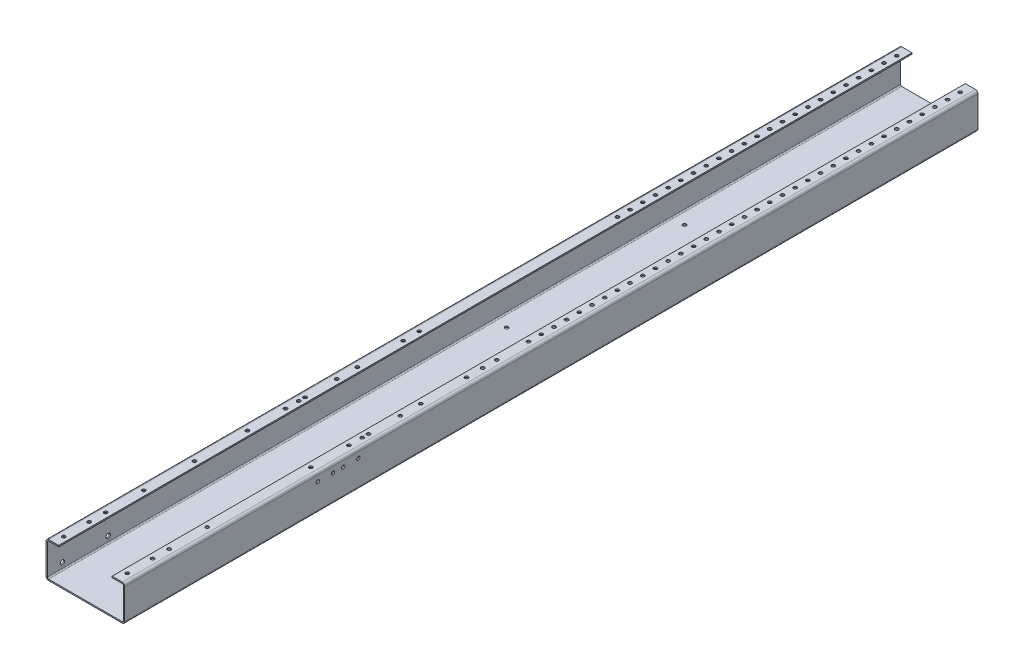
ISO-10303-21;
HEADER;
FILE_DESCRIPTION(('STEP AP214'),'2;1');
FILE_NAME('part.step','',(''),(''),'','','');
FILE_SCHEMA(('AUTOMOTIVE_DESIGN { 1 0 10303 214 1 1 1 1 }'));
ENDSEC;
DATA;
#1=APPLICATION_CONTEXT('core data for automotive mechanical design processes');
#2=APPLICATION_PROTOCOL_DEFINITION('international standard','automotive_design',2000,#1);
#3=PRODUCT_CONTEXT('',#1,'mechanical');
#4=PRODUCT('Part','Part','',(#3));
#5=PRODUCT_RELATED_PRODUCT_CATEGORY('part','',(#4));
#6=PRODUCT_DEFINITION_FORMATION('','',#4);
#7=PRODUCT_DEFINITION_CONTEXT('part definition',#1,'design');
#8=PRODUCT_DEFINITION('design','',#6,#7);
#9=PRODUCT_DEFINITION_SHAPE('','',#8);
#10=(LENGTH_UNIT() NAMED_UNIT(*) SI_UNIT(.MILLI.,.METRE.));
#11=(NAMED_UNIT(*) PLANE_ANGLE_UNIT() SI_UNIT($,.RADIAN.));
#12=(NAMED_UNIT(*) SI_UNIT($,.STERADIAN.) SOLID_ANGLE_UNIT());
#13=UNCERTAINTY_MEASURE_WITH_UNIT(LENGTH_MEASURE(1.E-05),#10,'distance_accuracy_value','');
#14=(GEOMETRIC_REPRESENTATION_CONTEXT(3) GLOBAL_UNCERTAINTY_ASSIGNED_CONTEXT((#13)) GLOBAL_UNIT_ASSIGNED_CONTEXT((#10,
#11,#12)) REPRESENTATION_CONTEXT('',''));
#15=CARTESIAN_POINT('',(0.,0.,0.));
#16=DIRECTION('',(0.,0.,1.));
#17=DIRECTION('',(1.,0.,0.));
#18=AXIS2_PLACEMENT_3D('',#15,#16,#17);
#19=CARTESIAN_POINT('',(-72.5,70.,-1680.));
#20=DIRECTION('',(0.,0.,-1.));
#21=DIRECTION('',(1.,0.,0.));
#22=AXIS2_PLACEMENT_3D('',#19,#20,#21);
#23=PLANE('',#22);
#24=DIRECTION('',(0.,-1.,0.));
#25=VECTOR('',#24,1.);
#26=CARTESIAN_POINT('',(-72.5,70.,-1680.));
#27=LINE('',#26,#25);
#28=CARTESIAN_POINT('',(-72.5,70.,-1680.));
#29=VERTEX_POINT('',#28);
#30=CARTESIAN_POINT('',(-72.5,67.5,-1680.));
#31=VERTEX_POINT('',#30);
#32=EDGE_CURVE('E11',#29,#31,#27,.T.);
#33=ORIENTED_EDGE('',*,*,#32,.T.);
#34=CARTESIAN_POINT('',(-72.5,65.,-1680.));
#35=DIRECTION('',(0.,0.,-1.));
#36=DIRECTION('',(-1.,0.,0.));
#37=AXIS2_PLACEMENT_3D('',#34,#35,#36);
#38=CIRCLE('',#37,2.5);
#39=CARTESIAN_POINT('',(-75.,65.,-1680.));
#40=VERTEX_POINT('',#39);
#41=EDGE_CURVE('E945',#31,#40,#38,.F.);
#42=ORIENTED_EDGE('',*,*,#41,.T.);
#43=DIRECTION('',(-1.,0.,0.));
#44=VECTOR('',#43,1.);
#45=CARTESIAN_POINT('',(-75.,65.,-1680.));
#46=LINE('',#45,#44);
#47=CARTESIAN_POINT('',(-77.5,65.,-1680.));
#48=VERTEX_POINT('',#47);
#49=EDGE_CURVE('E46',#40,#48,#46,.T.);
#50=ORIENTED_EDGE('',*,*,#49,.T.);
#51=CARTESIAN_POINT('',(-72.5,65.,-1680.));
#52=DIRECTION('',(0.,0.,-1.));
#53=DIRECTION('',(-1.,0.,0.));
#54=AXIS2_PLACEMENT_3D('',#51,#52,#53);
#55=CIRCLE('',#54,5.);
#56=EDGE_CURVE('E933',#29,#48,#55,.F.);
#57=ORIENTED_EDGE('',*,*,#56,.F.);
#58=EDGE_LOOP('',(#33,#42,#50,#57));
#59=FACE_BOUND('',#58,.T.);
#60=ADVANCED_FACE('F39',(#59),#23,.T.);
#61=CARTESIAN_POINT('',(-75.,65.,-1680.));
#62=DIRECTION('',(0.,0.,-1.));
#63=DIRECTION('',(1.,0.,0.));
#64=AXIS2_PLACEMENT_3D('',#61,#62,#63);
#65=PLANE('',#64);
#66=DIRECTION('',(-1.,0.,0.));
#67=VECTOR('',#66,1.);
#68=CARTESIAN_POINT('',(-77.5,70.,-1680.));
#69=LINE('',#68,#67);
#70=CARTESIAN_POINT('',(-52.5,70.,-1680.));
#71=VERTEX_POINT('',#70);
#72=EDGE_CURVE('E936',#71,#29,#69,.T.);
#73=ORIENTED_EDGE('',*,*,#72,.F.);
#74=DIRECTION('',(0.,1.,0.));
#75=VECTOR('',#74,1.);
#76=CARTESIAN_POINT('',(-52.5,67.5,-1680.));
#77=LINE('',#76,#75);
#78=CARTESIAN_POINT('',(-52.5,67.5,-1680.));
#79=VERTEX_POINT('',#78);
#80=EDGE_CURVE('E939',#79,#71,#77,.T.);
#81=ORIENTED_EDGE('',*,*,#80,.F.);
#82=DIRECTION('',(-1.,0.,0.));
#83=VECTOR('',#82,1.);
#84=CARTESIAN_POINT('',(-77.5,67.5,-1680.));
#85=LINE('',#84,#83);
#86=EDGE_CURVE('E942',#79,#31,#85,.T.);
#87=ORIENTED_EDGE('',*,*,#86,.T.);
#88=ORIENTED_EDGE('',*,*,#32,.F.);
#89=EDGE_LOOP('',(#73,#81,#87,#88));
#90=FACE_BOUND('',#89,.T.);
#91=ADVANCED_FACE('F1073',(#90),#65,.T.);
#92=CARTESIAN_POINT('',(-77.5,65.,0.));
#93=DIRECTION('',(0.,0.,1.));
#94=DIRECTION('',(-1.,0.,0.));
#95=AXIS2_PLACEMENT_3D('',#92,#93,#94);
#96=PLANE('',#95);
#97=DIRECTION('',(1.,0.,0.));
#98=VECTOR('',#97,1.);
#99=CARTESIAN_POINT('',(-77.5,65.,0.));
#100=LINE('',#99,#98);
#101=CARTESIAN_POINT('',(-77.5,65.,0.));
#102=VERTEX_POINT('',#101);
#103=CARTESIAN_POINT('',(-75.,65.,0.));
#104=VERTEX_POINT('',#103);
#105=EDGE_CURVE('E1048',#102,#104,#100,.T.);
#106=ORIENTED_EDGE('',*,*,#105,.T.);
#107=CARTESIAN_POINT('',(-72.5,65.,0.));
#108=DIRECTION('',(0.,0.,-1.));
#109=DIRECTION('',(-1.,0.,0.));
#110=AXIS2_PLACEMENT_3D('',#107,#108,#109);
#111=CIRCLE('',#110,2.5);
#112=CARTESIAN_POINT('',(-72.5,67.5,0.));
#113=VERTEX_POINT('',#112);
#114=EDGE_CURVE('E886',#113,#104,#111,.F.);
#115=ORIENTED_EDGE('',*,*,#114,.F.);
#116=DIRECTION('',(0.,1.,0.));
#117=VECTOR('',#116,1.);
#118=CARTESIAN_POINT('',(-72.5,67.5,0.));
#119=LINE('',#118,#117);
#120=CARTESIAN_POINT('',(-72.5,70.,0.));
#121=VERTEX_POINT('',#120);
#122=EDGE_CURVE('E1045',#113,#121,#119,.T.);
#123=ORIENTED_EDGE('',*,*,#122,.T.);
#124=CARTESIAN_POINT('',(-72.5,65.,0.));
#125=DIRECTION('',(0.,0.,-1.));
#126=DIRECTION('',(-1.,0.,0.));
#127=AXIS2_PLACEMENT_3D('',#124,#125,#126);
#128=CIRCLE('',#127,5.);
#129=EDGE_CURVE('E875',#121,#102,#128,.F.);
#130=ORIENTED_EDGE('',*,*,#129,.T.);
#131=EDGE_LOOP('',(#106,#115,#123,#130));
#132=FACE_BOUND('',#131,.T.);
#133=ADVANCED_FACE('F1113',(#132),#96,.T.);
#134=CARTESIAN_POINT('',(-72.5,67.5,0.));
#135=DIRECTION('',(0.,0.,1.));
#136=DIRECTION('',(-1.,0.,0.));
#137=AXIS2_PLACEMENT_3D('',#134,#135,#136);
#138=PLANE('',#137);
#139=DIRECTION('',(0.,-1.,0.));
#140=VECTOR('',#139,1.);
#141=CARTESIAN_POINT('',(-77.5,0.,0.));
#142=LINE('',#141,#140);
#143=CARTESIAN_POINT('',(-77.5,5.00000000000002,0.));
#144=VERTEX_POINT('',#143);
#145=EDGE_CURVE('E872',#102,#144,#142,.T.);
#146=ORIENTED_EDGE('',*,*,#145,.T.);
#147=DIRECTION('',(-1.,0.,0.));
#148=VECTOR('',#147,1.);
#149=CARTESIAN_POINT('',(-75.,5.00000000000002,0.));
#150=LINE('',#149,#148);
#151=CARTESIAN_POINT('',(-75.,5.00000000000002,0.));
#152=VERTEX_POINT('',#151);
#153=EDGE_CURVE('E1033',#152,#144,#150,.T.);
#154=ORIENTED_EDGE('',*,*,#153,.F.);
#155=DIRECTION('',(0.,1.,0.));
#156=VECTOR('',#155,1.);
#157=CARTESIAN_POINT('',(-75.,0.,0.));
#158=LINE('',#157,#156);
#159=EDGE_CURVE('E889',#104,#152,#158,.F.);
#160=ORIENTED_EDGE('',*,*,#159,.F.);
#161=ORIENTED_EDGE('',*,*,#105,.F.);
#162=EDGE_LOOP('',(#146,#154,#160,#161));
#163=FACE_BOUND('',#162,.T.);
#164=ADVANCED_FACE('F1114',(#163),#138,.T.);
#165=CARTESIAN_POINT('',(-77.5,5.00000000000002,-1680.));
#166=DIRECTION('',(0.,0.,-1.));
#167=DIRECTION('',(1.,0.,0.));
#168=AXIS2_PLACEMENT_3D('',#165,#166,#167);
#169=PLANE('',#168);
#170=DIRECTION('',(1.,0.,0.));
#171=VECTOR('',#170,1.);
#172=CARTESIAN_POINT('',(-77.5,5.00000000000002,-1680.));
#173=LINE('',#172,#171);
#174=CARTESIAN_POINT('',(-77.5,5.00000000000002,-1680.));
#175=VERTEX_POINT('',#174);
#176=CARTESIAN_POINT('',(-75.,5.00000000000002,-1680.));
#177=VERTEX_POINT('',#176);
#178=EDGE_CURVE('E1042',#175,#177,#173,.T.);
#179=ORIENTED_EDGE('',*,*,#178,.T.);
#180=CARTESIAN_POINT('',(-72.5,5.00000000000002,-1680.));
#181=DIRECTION('',(0.,0.,-1.));
#182=DIRECTION('',(-1.,0.,0.));
#183=AXIS2_PLACEMENT_3D('',#180,#181,#182);
#184=CIRCLE('',#183,2.5);
#185=CARTESIAN_POINT('',(-72.5,2.50000000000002,-1680.));
#186=VERTEX_POINT('',#185);
#187=EDGE_CURVE('E951',#177,#186,#184,.F.);
#188=ORIENTED_EDGE('',*,*,#187,.T.);
#189=DIRECTION('',(0.,-1.,0.));
#190=VECTOR('',#189,1.);
#191=CARTESIAN_POINT('',(-72.5,2.50000000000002,-1680.));
#192=LINE('',#191,#190);
#193=CARTESIAN_POINT('',(-72.5,0.,-1680.));
#194=VERTEX_POINT('',#193);
#195=EDGE_CURVE('E1039',#186,#194,#192,.T.);
#196=ORIENTED_EDGE('',*,*,#195,.T.);
#197=CARTESIAN_POINT('',(-72.5,5.00000000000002,-1680.));
#198=DIRECTION('',(0.,0.,-1.));
#199=DIRECTION('',(-1.,0.,0.));
#200=AXIS2_PLACEMENT_3D('',#197,#198,#199);
#201=CIRCLE('',#200,5.);
#202=EDGE_CURVE('E927',#175,#194,#201,.F.);
#203=ORIENTED_EDGE('',*,*,#202,.F.);
#204=EDGE_LOOP('',(#179,#188,#196,#203));
#205=FACE_BOUND('',#204,.T.);
#206=ADVANCED_FACE('F1106',(#205),#169,.T.);
#207=CARTESIAN_POINT('',(-72.5,2.50000000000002,-1680.));
#208=DIRECTION('',(0.,0.,-1.));
#209=DIRECTION('',(1.,0.,0.));
#210=AXIS2_PLACEMENT_3D('',#207,#208,#209);
#211=PLANE('',#210);
#212=DIRECTION('',(0.,-1.,0.));
#213=VECTOR('',#212,1.);
#214=CARTESIAN_POINT('',(-77.5,0.,-1680.));
#215=LINE('',#214,#213);
#216=EDGE_CURVE('E930',#48,#175,#215,.T.);
#217=ORIENTED_EDGE('',*,*,#216,.F.);
#218=ORIENTED_EDGE('',*,*,#49,.F.);
#219=DIRECTION('',(0.,1.,0.));
#220=VECTOR('',#219,1.);
#221=CARTESIAN_POINT('',(-75.,0.,-1680.));
#222=LINE('',#221,#220);
#223=EDGE_CURVE('E948',#40,#177,#222,.F.);
#224=ORIENTED_EDGE('',*,*,#223,.T.);
#225=ORIENTED_EDGE('',*,*,#178,.F.);
#226=EDGE_LOOP('',(#217,#218,#224,#225));
#227=FACE_BOUND('',#226,.T.);
#228=ADVANCED_FACE('F1058',(#227),#211,.T.);
#229=CARTESIAN_POINT('',(-72.5,0.,0.));
#230=DIRECTION('',(0.,0.,1.));
#231=DIRECTION('',(-1.,0.,0.));
#232=AXIS2_PLACEMENT_3D('',#229,#230,#231);
#233=PLANE('',#232);
#234=DIRECTION('',(0.,1.,0.));
#235=VECTOR('',#234,1.);
#236=CARTESIAN_POINT('',(-72.5,0.,0.));
#237=LINE('',#236,#235);
#238=CARTESIAN_POINT('',(-72.5,0.,0.));
#239=VERTEX_POINT('',#238);
#240=CARTESIAN_POINT('',(-72.5,2.50000000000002,0.));
#241=VERTEX_POINT('',#240);
#242=EDGE_CURVE('E1036',#239,#241,#237,.T.);
#243=ORIENTED_EDGE('',*,*,#242,.T.);
#244=CARTESIAN_POINT('',(-72.5,5.00000000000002,0.));
#245=DIRECTION('',(0.,0.,-1.));
#246=DIRECTION('',(-1.,0.,0.));
#247=AXIS2_PLACEMENT_3D('',#244,#245,#246);
#248=CIRCLE('',#247,2.5);
#249=EDGE_CURVE('E892',#152,#241,#248,.F.);
#250=ORIENTED_EDGE('',*,*,#249,.F.);
#251=ORIENTED_EDGE('',*,*,#153,.T.);
#252=CARTESIAN_POINT('',(-72.5,5.00000000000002,0.));
#253=DIRECTION('',(0.,0.,-1.));
#254=DIRECTION('',(-1.,0.,0.));
#255=AXIS2_PLACEMENT_3D('',#252,#253,#254);
#256=CIRCLE('',#255,5.);
#257=EDGE_CURVE('E869',#144,#239,#256,.F.);
#258=ORIENTED_EDGE('',*,*,#257,.T.);
#259=EDGE_LOOP('',(#243,#250,#251,#258));
#260=FACE_BOUND('',#259,.T.);
#261=ADVANCED_FACE('F1088',(#260),#233,.T.);
#262=CARTESIAN_POINT('',(-75.,5.00000000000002,0.));
#263=DIRECTION('',(0.,0.,1.));
#264=DIRECTION('',(-1.,0.,0.));
#265=AXIS2_PLACEMENT_3D('',#262,#263,#264);
#266=PLANE('',#265);
#267=DIRECTION('',(1.,0.,0.));
#268=VECTOR('',#267,1.);
#269=CARTESIAN_POINT('',(77.5,0.,0.));
#270=LINE('',#269,#268);
#271=CARTESIAN_POINT('',(72.5,0.,0.));
#272=VERTEX_POINT('',#271);
#273=EDGE_CURVE('E866',#239,#272,#270,.T.);
#274=ORIENTED_EDGE('',*,*,#273,.T.);
#275=DIRECTION('',(0.,-1.,0.));
#276=VECTOR('',#275,1.);
#277=CARTESIAN_POINT('',(72.5,2.5,0.));
#278=LINE('',#277,#276);
#279=CARTESIAN_POINT('',(72.5,2.5,0.));
#280=VERTEX_POINT('',#279);
#281=EDGE_CURVE('E1021',#280,#272,#278,.T.);
#282=ORIENTED_EDGE('',*,*,#281,.F.);
#283=DIRECTION('',(1.,0.,0.));
#284=VECTOR('',#283,1.);
#285=CARTESIAN_POINT('',(77.5,2.5,0.));
#286=LINE('',#285,#284);
#287=EDGE_CURVE('E895',#241,#280,#286,.T.);
#288=ORIENTED_EDGE('',*,*,#287,.F.);
#289=ORIENTED_EDGE('',*,*,#242,.F.);
#290=EDGE_LOOP('',(#274,#282,#288,#289));
#291=FACE_BOUND('',#290,.T.);
#292=ADVANCED_FACE('F1093',(#291),#266,.T.);
#293=CARTESIAN_POINT('',(72.5,0.,-1680.));
#294=DIRECTION('',(0.,0.,-1.));
#295=DIRECTION('',(1.,0.,0.));
#296=AXIS2_PLACEMENT_3D('',#293,#294,#295);
#297=PLANE('',#296);
#298=DIRECTION('',(0.,1.,0.));
#299=VECTOR('',#298,1.);
#300=CARTESIAN_POINT('',(72.5,0.,-1680.));
#301=LINE('',#300,#299);
#302=CARTESIAN_POINT('',(72.5,0.,-1680.));
#303=VERTEX_POINT('',#302);
#304=CARTESIAN_POINT('',(72.5,2.5,-1680.));
#305=VERTEX_POINT('',#304);
#306=EDGE_CURVE('E1030',#303,#305,#301,.T.);
#307=ORIENTED_EDGE('',*,*,#306,.T.);
#308=CARTESIAN_POINT('',(72.5,5.,-1680.));
#309=DIRECTION('',(0.,0.,-1.));
#310=DIRECTION('',(-1.,0.,0.));
#311=AXIS2_PLACEMENT_3D('',#308,#309,#310);
#312=CIRCLE('',#311,2.5);
#313=CARTESIAN_POINT('',(75.,5.,-1680.));
#314=VERTEX_POINT('',#313);
#315=EDGE_CURVE('E957',#305,#314,#312,.F.);
#316=ORIENTED_EDGE('',*,*,#315,.T.);
#317=DIRECTION('',(1.,0.,0.));
#318=VECTOR('',#317,1.);
#319=CARTESIAN_POINT('',(75.,5.,-1680.));
#320=LINE('',#319,#318);
#321=CARTESIAN_POINT('',(77.5,5.,-1680.));
#322=VERTEX_POINT('',#321);
#323=EDGE_CURVE('E1027',#314,#322,#320,.T.);
#324=ORIENTED_EDGE('',*,*,#323,.T.);
#325=CARTESIAN_POINT('',(72.5,5.,-1680.));
#326=DIRECTION('',(0.,0.,-1.));
#327=DIRECTION('',(-1.,0.,0.));
#328=AXIS2_PLACEMENT_3D('',#325,#326,#327);
#329=CIRCLE('',#328,5.);
#330=EDGE_CURVE('E921',#303,#322,#329,.F.);
#331=ORIENTED_EDGE('',*,*,#330,.F.);
#332=EDGE_LOOP('',(#307,#316,#324,#331));
#333=FACE_BOUND('',#332,.T.);
#334=ADVANCED_FACE('F1173',(#333),#297,.T.);
#335=CARTESIAN_POINT('',(75.,5.,-1680.));
#336=DIRECTION('',(0.,0.,-1.));
#337=DIRECTION('',(1.,0.,0.));
#338=AXIS2_PLACEMENT_3D('',#335,#336,#337);
#339=PLANE('',#338);
#340=DIRECTION('',(1.,0.,0.));
#341=VECTOR('',#340,1.);
#342=CARTESIAN_POINT('',(77.5,0.,-1680.));
#343=LINE('',#342,#341);
#344=EDGE_CURVE('E924',#194,#303,#343,.T.);
#345=ORIENTED_EDGE('',*,*,#344,.F.);
#346=ORIENTED_EDGE('',*,*,#195,.F.);
#347=DIRECTION('',(1.,0.,0.));
#348=VECTOR('',#347,1.);
#349=CARTESIAN_POINT('',(77.5,2.5,-1680.));
#350=LINE('',#349,#348);
#351=EDGE_CURVE('E954',#186,#305,#350,.T.);
#352=ORIENTED_EDGE('',*,*,#351,.T.);
#353=ORIENTED_EDGE('',*,*,#306,.F.);
#354=EDGE_LOOP('',(#345,#346,#352,#353));
#355=FACE_BOUND('',#354,.T.);
#356=ADVANCED_FACE('F1104',(#355),#339,.T.);
#357=CARTESIAN_POINT('',(77.5,5.,0.));
#358=DIRECTION('',(0.,0.,1.));
#359=DIRECTION('',(-1.,0.,0.));
#360=AXIS2_PLACEMENT_3D('',#357,#358,#359);
#361=PLANE('',#360);
#362=DIRECTION('',(-1.,0.,0.));
#363=VECTOR('',#362,1.);
#364=CARTESIAN_POINT('',(77.5,5.,0.));
#365=LINE('',#364,#363);
#366=CARTESIAN_POINT('',(77.5,5.,0.));
#367=VERTEX_POINT('',#366);
#368=CARTESIAN_POINT('',(75.,5.,0.));
#369=VERTEX_POINT('',#368);
#370=EDGE_CURVE('E1024',#367,#369,#365,.T.);
#371=ORIENTED_EDGE('',*,*,#370,.T.);
#372=CARTESIAN_POINT('',(72.5,5.,0.));
#373=DIRECTION('',(0.,0.,-1.));
#374=DIRECTION('',(-1.,0.,0.));
#375=AXIS2_PLACEMENT_3D('',#372,#373,#374);
#376=CIRCLE('',#375,2.5);
#377=EDGE_CURVE('E898',#280,#369,#376,.F.);
#378=ORIENTED_EDGE('',*,*,#377,.F.);
#379=ORIENTED_EDGE('',*,*,#281,.T.);
#380=CARTESIAN_POINT('',(72.5,5.,0.));
#381=DIRECTION('',(0.,0.,-1.));
#382=DIRECTION('',(-1.,0.,0.));
#383=AXIS2_PLACEMENT_3D('',#380,#381,#382);
#384=CIRCLE('',#383,5.);
#385=EDGE_CURVE('E863',#272,#367,#384,.F.);
#386=ORIENTED_EDGE('',*,*,#385,.T.);
#387=EDGE_LOOP('',(#371,#378,#379,#386));
#388=FACE_BOUND('',#387,.T.);
#389=ADVANCED_FACE('F1193',(#388),#361,.T.);
#390=CARTESIAN_POINT('',(72.5,2.5,0.));
#391=DIRECTION('',(0.,0.,1.));
#392=DIRECTION('',(-1.,0.,0.));
#393=AXIS2_PLACEMENT_3D('',#390,#391,#392);
#394=PLANE('',#393);
#395=DIRECTION('',(0.,1.,0.));
#396=VECTOR('',#395,1.);
#397=CARTESIAN_POINT('',(77.5,0.,0.));
#398=LINE('',#397,#396);
#399=CARTESIAN_POINT('',(77.5,65.,0.));
#400=VERTEX_POINT('',#399);
#401=EDGE_CURVE('E860',#367,#400,#398,.T.);
#402=ORIENTED_EDGE('',*,*,#401,.T.);
#403=DIRECTION('',(1.,0.,0.));
#404=VECTOR('',#403,1.);
#405=CARTESIAN_POINT('',(75.,65.,0.));
#406=LINE('',#405,#404);
#407=CARTESIAN_POINT('',(75.,65.,0.));
#408=VERTEX_POINT('',#407);
#409=EDGE_CURVE('E969',#408,#400,#406,.T.);
#410=ORIENTED_EDGE('',*,*,#409,.F.);
#411=DIRECTION('',(0.,1.,0.));
#412=VECTOR('',#411,1.);
#413=CARTESIAN_POINT('',(75.,0.,0.));
#414=LINE('',#413,#412);
#415=EDGE_CURVE('E901',#369,#408,#414,.T.);
#416=ORIENTED_EDGE('',*,*,#415,.F.);
#417=ORIENTED_EDGE('',*,*,#370,.F.);
#418=EDGE_LOOP('',(#402,#410,#416,#417));
#419=FACE_BOUND('',#418,.T.);
#420=ADVANCED_FACE('F1203',(#419),#394,.T.);
#421=CARTESIAN_POINT('',(77.5,65.,-1680.));
#422=DIRECTION('',(0.,0.,-1.));
#423=DIRECTION('',(1.,0.,0.));
#424=AXIS2_PLACEMENT_3D('',#421,#422,#423);
#425=PLANE('',#424);
#426=DIRECTION('',(-1.,0.,0.));
#427=VECTOR('',#426,1.);
#428=CARTESIAN_POINT('',(77.5,65.,-1680.));
#429=LINE('',#428,#427);
#430=CARTESIAN_POINT('',(77.5,65.,-1680.));
#431=VERTEX_POINT('',#430);
#432=CARTESIAN_POINT('',(75.,65.,-1680.));
#433=VERTEX_POINT('',#432);
#434=EDGE_CURVE('E1018',#431,#433,#429,.T.);
#435=ORIENTED_EDGE('',*,*,#434,.T.);
#436=CARTESIAN_POINT('',(72.5,65.,-1680.));
#437=DIRECTION('',(0.,0.,-1.));
#438=DIRECTION('',(-1.,0.,0.));
#439=AXIS2_PLACEMENT_3D('',#436,#437,#438);
#440=CIRCLE('',#439,2.5);
#441=CARTESIAN_POINT('',(72.5,67.5,-1680.));
#442=VERTEX_POINT('',#441);
#443=EDGE_CURVE('E963',#433,#442,#440,.F.);
#444=ORIENTED_EDGE('',*,*,#443,.T.);
#445=DIRECTION('',(0.,1.,0.));
#446=VECTOR('',#445,1.);
#447=CARTESIAN_POINT('',(72.5,67.5,-1680.));
#448=LINE('',#447,#446);
#449=CARTESIAN_POINT('',(72.5,70.,-1680.));
#450=VERTEX_POINT('',#449);
#451=EDGE_CURVE('E1015',#442,#450,#448,.T.);
#452=ORIENTED_EDGE('',*,*,#451,.T.);
#453=CARTESIAN_POINT('',(72.5,65.,-1680.));
#454=DIRECTION('',(0.,0.,-1.));
#455=DIRECTION('',(-1.,0.,0.));
#456=AXIS2_PLACEMENT_3D('',#453,#454,#455);
#457=CIRCLE('',#456,5.);
#458=EDGE_CURVE('E915',#431,#450,#457,.F.);
#459=ORIENTED_EDGE('',*,*,#458,.F.);
#460=EDGE_LOOP('',(#435,#444,#452,#459));
#461=FACE_BOUND('',#460,.T.);
#462=ADVANCED_FACE('F1214',(#461),#425,.T.);
#463=CARTESIAN_POINT('',(72.5,67.5,-1680.));
#464=DIRECTION('',(0.,0.,-1.));
#465=DIRECTION('',(1.,0.,0.));
#466=AXIS2_PLACEMENT_3D('',#463,#464,#465);
#467=PLANE('',#466);
#468=DIRECTION('',(0.,1.,0.));
#469=VECTOR('',#468,1.);
#470=CARTESIAN_POINT('',(77.5,0.,-1680.));
#471=LINE('',#470,#469);
#472=EDGE_CURVE('E918',#322,#431,#471,.T.);
#473=ORIENTED_EDGE('',*,*,#472,.F.);
#474=ORIENTED_EDGE('',*,*,#323,.F.);
#475=DIRECTION('',(0.,1.,0.));
#476=VECTOR('',#475,1.);
#477=CARTESIAN_POINT('',(75.,0.,-1680.));
#478=LINE('',#477,#476);
#479=EDGE_CURVE('E960',#314,#433,#478,.T.);
#480=ORIENTED_EDGE('',*,*,#479,.T.);
#481=ORIENTED_EDGE('',*,*,#434,.F.);
#482=EDGE_LOOP('',(#473,#474,#480,#481));
#483=FACE_BOUND('',#482,.T.);
#484=ADVANCED_FACE('F1225',(#483),#467,.T.);
#485=CARTESIAN_POINT('',(72.5,70.,0.));
#486=DIRECTION('',(0.,0.,1.));
#487=DIRECTION('',(-1.,0.,0.));
#488=AXIS2_PLACEMENT_3D('',#485,#486,#487);
#489=PLANE('',#488);
#490=DIRECTION('',(0.,-1.,0.));
#491=VECTOR('',#490,1.);
#492=CARTESIAN_POINT('',(72.5,70.,0.));
#493=LINE('',#492,#491);
#494=CARTESIAN_POINT('',(72.5,70.,0.));
#495=VERTEX_POINT('',#494);
#496=CARTESIAN_POINT('',(72.5,67.5,0.));
#497=VERTEX_POINT('',#496);
#498=EDGE_CURVE('E1012',#495,#497,#493,.T.);
#499=ORIENTED_EDGE('',*,*,#498,.T.);
#500=CARTESIAN_POINT('',(72.5,65.,0.));
#501=DIRECTION('',(0.,0.,-1.));
#502=DIRECTION('',(-1.,0.,0.));
#503=AXIS2_PLACEMENT_3D('',#500,#501,#502);
#504=CIRCLE('',#503,2.5);
#505=EDGE_CURVE('E904',#408,#497,#504,.F.);
#506=ORIENTED_EDGE('',*,*,#505,.F.);
#507=ORIENTED_EDGE('',*,*,#409,.T.);
#508=CARTESIAN_POINT('',(72.5,65.,0.));
#509=DIRECTION('',(0.,0.,-1.));
#510=DIRECTION('',(-1.,0.,0.));
#511=AXIS2_PLACEMENT_3D('',#508,#509,#510);
#512=CIRCLE('',#511,5.);
#513=EDGE_CURVE('E857',#400,#495,#512,.F.);
#514=ORIENTED_EDGE('',*,*,#513,.T.);
#515=EDGE_LOOP('',(#499,#506,#507,#514));
#516=FACE_BOUND('',#515,.T.);
#517=ADVANCED_FACE('F1236',(#516),#489,.T.);
#518=CARTESIAN_POINT('',(75.,65.,0.));
#519=DIRECTION('',(0.,0.,1.));
#520=DIRECTION('',(-1.,0.,0.));
#521=AXIS2_PLACEMENT_3D('',#518,#519,#520);
#522=PLANE('',#521);
#523=DIRECTION('',(-1.,0.,0.));
#524=VECTOR('',#523,1.);
#525=CARTESIAN_POINT('',(77.5,70.,0.));
#526=LINE('',#525,#524);
#527=CARTESIAN_POINT('',(52.5,70.,0.));
#528=VERTEX_POINT('',#527);
#529=EDGE_CURVE('E854',#495,#528,#526,.T.);
#530=ORIENTED_EDGE('',*,*,#529,.T.);
#531=DIRECTION('',(0.,-1.,0.));
#532=VECTOR('',#531,1.);
#533=CARTESIAN_POINT('',(52.5,70.,0.));
#534=LINE('',#533,#532);
#535=CARTESIAN_POINT('',(52.5,67.5,0.));
#536=VERTEX_POINT('',#535);
#537=EDGE_CURVE('E851',#528,#536,#534,.T.);
#538=ORIENTED_EDGE('',*,*,#537,.T.);
#539=DIRECTION('',(-1.,0.,0.));
#540=VECTOR('',#539,1.);
#541=CARTESIAN_POINT('',(77.5,67.5,0.));
#542=LINE('',#541,#540);
#543=EDGE_CURVE('E848',#497,#536,#542,.T.);
#544=ORIENTED_EDGE('',*,*,#543,.F.);
#545=ORIENTED_EDGE('',*,*,#498,.F.);
#546=EDGE_LOOP('',(#530,#538,#544,#545));
#547=FACE_BOUND('',#546,.T.);
#548=ADVANCED_FACE('F1247',(#547),#522,.T.);
#549=CARTESIAN_POINT('',(77.5,67.5,-1680.));
#550=DIRECTION('',(0.,-1.,0.));
#551=DIRECTION('',(-1.,0.,0.));
#552=AXIS2_PLACEMENT_3D('',#549,#550,#551);
#553=PLANE('',#552);
#554=CARTESIAN_POINT('',(62.5,67.5,-747.5));
#555=DIRECTION('',(0.,1.,0.));
#556=DIRECTION('',(-1.,0.,0.));
#557=AXIS2_PLACEMENT_3D('',#554,#555,#556);
#558=CIRCLE('',#557,3.4);
#559=CARTESIAN_POINT('',(59.1,67.5,-747.5));
#560=VERTEX_POINT('',#559);
#561=EDGE_CURVE('E350',#560,#560,#558,.F.);
#562=ORIENTED_EDGE('',*,*,#561,.F.);
#563=EDGE_LOOP('',(#562));
#564=FACE_BOUND('',#563,.T.);
#565=CARTESIAN_POINT('',(62.5,67.5,-720.));
#566=DIRECTION('',(0.,1.,0.));
#567=DIRECTION('',(-1.,0.,0.));
#568=AXIS2_PLACEMENT_3D('',#565,#566,#567);
#569=CIRCLE('',#568,3.4);
#570=CARTESIAN_POINT('',(59.1,67.5,-720.));
#571=VERTEX_POINT('',#570);
#572=EDGE_CURVE('E362',#571,#571,#569,.F.);
#573=ORIENTED_EDGE('',*,*,#572,.F.);
#574=EDGE_LOOP('',(#573));
#575=FACE_BOUND('',#574,.T.);
#576=CARTESIAN_POINT('',(62.5,67.5,-495.));
#577=DIRECTION('',(0.,1.,0.));
#578=DIRECTION('',(-1.,0.,0.));
#579=AXIS2_PLACEMENT_3D('',#576,#577,#578);
#580=CIRCLE('',#579,3.4);
#581=CARTESIAN_POINT('',(59.1,67.5,-495.));
#582=VERTEX_POINT('',#581);
#583=EDGE_CURVE('E374',#582,#582,#580,.F.);
#584=ORIENTED_EDGE('',*,*,#583,.F.);
#585=EDGE_LOOP('',(#584));
#586=FACE_BOUND('',#585,.T.);
#587=CARTESIAN_POINT('',(62.5,67.5,-1660.));
#588=DIRECTION('',(0.,1.,0.));
#589=DIRECTION('',(-1.,0.,0.));
#590=AXIS2_PLACEMENT_3D('',#587,#588,#589);
#591=CIRCLE('',#590,3.4);
#592=CARTESIAN_POINT('',(59.1,67.5,-1660.));
#593=VERTEX_POINT('',#592);
#594=EDGE_CURVE('E386',#593,#593,#591,.F.);
#595=ORIENTED_EDGE('',*,*,#594,.F.);
#596=EDGE_LOOP('',(#595));
#597=FACE_BOUND('',#596,.T.);
#598=CARTESIAN_POINT('',(62.5,67.5,-1635.));
#599=DIRECTION('',(0.,1.,0.));
#600=DIRECTION('',(-1.,0.,0.));
#601=AXIS2_PLACEMENT_3D('',#598,#599,#600);
#602=CIRCLE('',#601,3.4);
#603=CARTESIAN_POINT('',(59.1,67.5,-1635.));
#604=VERTEX_POINT('',#603);
#605=EDGE_CURVE('E398',#604,#604,#602,.F.);
#606=ORIENTED_EDGE('',*,*,#605,.F.);
#607=EDGE_LOOP('',(#606));
#608=FACE_BOUND('',#607,.T.);
#609=CARTESIAN_POINT('',(62.5,67.5,-1610.));
#610=DIRECTION('',(0.,1.,0.));
#611=DIRECTION('',(-1.,0.,0.));
#612=AXIS2_PLACEMENT_3D('',#609,#610,#611);
#613=CIRCLE('',#612,3.4);
#614=CARTESIAN_POINT('',(59.1,67.5,-1610.));
#615=VERTEX_POINT('',#614);
#616=EDGE_CURVE('E410',#615,#615,#613,.F.);
#617=ORIENTED_EDGE('',*,*,#616,.F.);
#618=EDGE_LOOP('',(#617));
#619=FACE_BOUND('',#618,.T.);
#620=CARTESIAN_POINT('',(62.5,67.5,-1585.));
#621=DIRECTION('',(0.,1.,0.));
#622=DIRECTION('',(-1.,0.,0.));
#623=AXIS2_PLACEMENT_3D('',#620,#621,#622);
#624=CIRCLE('',#623,3.4);
#625=CARTESIAN_POINT('',(59.1,67.5,-1585.));
#626=VERTEX_POINT('',#625);
#627=EDGE_CURVE('E422',#626,#626,#624,.F.);
#628=ORIENTED_EDGE('',*,*,#627,.F.);
#629=EDGE_LOOP('',(#628));
#630=FACE_BOUND('',#629,.T.);
#631=CARTESIAN_POINT('',(62.5,67.5,-1560.));
#632=DIRECTION('',(0.,1.,0.));
#633=DIRECTION('',(-1.,0.,0.));
#634=AXIS2_PLACEMENT_3D('',#631,#632,#633);
#635=CIRCLE('',#634,3.4);
#636=CARTESIAN_POINT('',(59.1,67.5,-1560.));
#637=VERTEX_POINT('',#636);
#638=EDGE_CURVE('E434',#637,#637,#635,.F.);
#639=ORIENTED_EDGE('',*,*,#638,.F.);
#640=EDGE_LOOP('',(#639));
#641=FACE_BOUND('',#640,.T.);
#642=CARTESIAN_POINT('',(62.5,67.5,-1535.));
#643=DIRECTION('',(0.,1.,0.));
#644=DIRECTION('',(-1.,0.,0.));
#645=AXIS2_PLACEMENT_3D('',#642,#643,#644);
#646=CIRCLE('',#645,3.4);
#647=CARTESIAN_POINT('',(59.1,67.5,-1535.));
#648=VERTEX_POINT('',#647);
#649=EDGE_CURVE('E446',#648,#648,#646,.F.);
#650=ORIENTED_EDGE('',*,*,#649,.F.);
#651=EDGE_LOOP('',(#650));
#652=FACE_BOUND('',#651,.T.);
#653=CARTESIAN_POINT('',(62.5,67.5,-1510.));
#654=DIRECTION('',(0.,1.,0.));
#655=DIRECTION('',(-1.,0.,0.));
#656=AXIS2_PLACEMENT_3D('',#653,#654,#655);
#657=CIRCLE('',#656,3.4);
#658=CARTESIAN_POINT('',(59.1,67.5,-1510.));
#659=VERTEX_POINT('',#658);
#660=EDGE_CURVE('E458',#659,#659,#657,.F.);
#661=ORIENTED_EDGE('',*,*,#660,.F.);
#662=EDGE_LOOP('',(#661));
#663=FACE_BOUND('',#662,.T.);
#664=CARTESIAN_POINT('',(62.5,67.5,-1485.));
#665=DIRECTION('',(0.,1.,0.));
#666=DIRECTION('',(-1.,0.,0.));
#667=AXIS2_PLACEMENT_3D('',#664,#665,#666);
#668=CIRCLE('',#667,3.4);
#669=CARTESIAN_POINT('',(59.1,67.5,-1485.));
#670=VERTEX_POINT('',#669);
#671=EDGE_CURVE('E470',#670,#670,#668,.F.);
#672=ORIENTED_EDGE('',*,*,#671,.F.);
#673=EDGE_LOOP('',(#672));
#674=FACE_BOUND('',#673,.T.);
#675=CARTESIAN_POINT('',(62.5,67.5,-1460.));
#676=DIRECTION('',(0.,1.,0.));
#677=DIRECTION('',(-1.,0.,0.));
#678=AXIS2_PLACEMENT_3D('',#675,#676,#677);
#679=CIRCLE('',#678,3.4);
#680=CARTESIAN_POINT('',(59.1,67.5,-1460.));
#681=VERTEX_POINT('',#680);
#682=EDGE_CURVE('E482',#681,#681,#679,.F.);
#683=ORIENTED_EDGE('',*,*,#682,.F.);
#684=EDGE_LOOP('',(#683));
#685=FACE_BOUND('',#684,.T.);
#686=CARTESIAN_POINT('',(62.5,67.5,-1435.));
#687=DIRECTION('',(0.,1.,0.));
#688=DIRECTION('',(-1.,0.,0.));
#689=AXIS2_PLACEMENT_3D('',#686,#687,#688);
#690=CIRCLE('',#689,3.4);
#691=CARTESIAN_POINT('',(59.1,67.5,-1435.));
#692=VERTEX_POINT('',#691);
#693=EDGE_CURVE('E494',#692,#692,#690,.F.);
#694=ORIENTED_EDGE('',*,*,#693,.F.);
#695=EDGE_LOOP('',(#694));
#696=FACE_BOUND('',#695,.T.);
#697=CARTESIAN_POINT('',(62.5,67.5,-1410.));
#698=DIRECTION('',(0.,1.,0.));
#699=DIRECTION('',(-1.,0.,0.));
#700=AXIS2_PLACEMENT_3D('',#697,#698,#699);
#701=CIRCLE('',#700,3.4);
#702=CARTESIAN_POINT('',(59.1,67.5,-1410.));
#703=VERTEX_POINT('',#702);
#704=EDGE_CURVE('E506',#703,#703,#701,.F.);
#705=ORIENTED_EDGE('',*,*,#704,.F.);
#706=EDGE_LOOP('',(#705));
#707=FACE_BOUND('',#706,.T.);
#708=CARTESIAN_POINT('',(62.5,67.5,-1385.));
#709=DIRECTION('',(0.,1.,0.));
#710=DIRECTION('',(-1.,0.,0.));
#711=AXIS2_PLACEMENT_3D('',#708,#709,#710);
#712=CIRCLE('',#711,3.4);
#713=CARTESIAN_POINT('',(59.1,67.5,-1385.));
#714=VERTEX_POINT('',#713);
#715=EDGE_CURVE('E518',#714,#714,#712,.F.);
#716=ORIENTED_EDGE('',*,*,#715,.F.);
#717=EDGE_LOOP('',(#716));
#718=FACE_BOUND('',#717,.T.);
#719=CARTESIAN_POINT('',(62.5,67.5,-1360.));
#720=DIRECTION('',(0.,1.,0.));
#721=DIRECTION('',(-1.,0.,0.));
#722=AXIS2_PLACEMENT_3D('',#719,#720,#721);
#723=CIRCLE('',#722,3.4);
#724=CARTESIAN_POINT('',(59.1,67.5,-1360.));
#725=VERTEX_POINT('',#724);
#726=EDGE_CURVE('E530',#725,#725,#723,.F.);
#727=ORIENTED_EDGE('',*,*,#726,.F.);
#728=EDGE_LOOP('',(#727));
#729=FACE_BOUND('',#728,.T.);
#730=CARTESIAN_POINT('',(62.5,67.5,-1335.));
#731=DIRECTION('',(0.,1.,0.));
#732=DIRECTION('',(-1.,0.,0.));
#733=AXIS2_PLACEMENT_3D('',#730,#731,#732);
#734=CIRCLE('',#733,3.4);
#735=CARTESIAN_POINT('',(59.1,67.5,-1335.));
#736=VERTEX_POINT('',#735);
#737=EDGE_CURVE('E542',#736,#736,#734,.F.);
#738=ORIENTED_EDGE('',*,*,#737,.F.);
#739=EDGE_LOOP('',(#738));
#740=FACE_BOUND('',#739,.T.);
#741=CARTESIAN_POINT('',(62.5,67.5,-1310.));
#742=DIRECTION('',(0.,1.,0.));
#743=DIRECTION('',(-1.,0.,0.));
#744=AXIS2_PLACEMENT_3D('',#741,#742,#743);
#745=CIRCLE('',#744,3.4);
#746=CARTESIAN_POINT('',(59.1,67.5,-1310.));
#747=VERTEX_POINT('',#746);
#748=EDGE_CURVE('E554',#747,#747,#745,.F.);
#749=ORIENTED_EDGE('',*,*,#748,.F.);
#750=EDGE_LOOP('',(#749));
#751=FACE_BOUND('',#750,.T.);
#752=CARTESIAN_POINT('',(62.5,67.5,-1285.));
#753=DIRECTION('',(0.,1.,0.));
#754=DIRECTION('',(-1.,0.,0.));
#755=AXIS2_PLACEMENT_3D('',#752,#753,#754);
#756=CIRCLE('',#755,3.4);
#757=CARTESIAN_POINT('',(59.1,67.5,-1285.));
#758=VERTEX_POINT('',#757);
#759=EDGE_CURVE('E566',#758,#758,#756,.F.);
#760=ORIENTED_EDGE('',*,*,#759,.F.);
#761=EDGE_LOOP('',(#760));
#762=FACE_BOUND('',#761,.T.);
#763=CARTESIAN_POINT('',(62.5,67.5,-1260.));
#764=DIRECTION('',(0.,1.,0.));
#765=DIRECTION('',(-1.,0.,0.));
#766=AXIS2_PLACEMENT_3D('',#763,#764,#765);
#767=CIRCLE('',#766,3.4);
#768=CARTESIAN_POINT('',(59.1,67.5,-1260.));
#769=VERTEX_POINT('',#768);
#770=EDGE_CURVE('E578',#769,#769,#767,.F.);
#771=ORIENTED_EDGE('',*,*,#770,.F.);
#772=EDGE_LOOP('',(#771));
#773=FACE_BOUND('',#772,.T.);
#774=CARTESIAN_POINT('',(62.5,67.5,-1235.));
#775=DIRECTION('',(0.,1.,0.));
#776=DIRECTION('',(-1.,0.,0.));
#777=AXIS2_PLACEMENT_3D('',#774,#775,#776);
#778=CIRCLE('',#777,3.4);
#779=CARTESIAN_POINT('',(59.1,67.5,-1235.));
#780=VERTEX_POINT('',#779);
#781=EDGE_CURVE('E590',#780,#780,#778,.F.);
#782=ORIENTED_EDGE('',*,*,#781,.F.);
#783=EDGE_LOOP('',(#782));
#784=FACE_BOUND('',#783,.T.);
#785=CARTESIAN_POINT('',(62.5,67.5,-1210.));
#786=DIRECTION('',(0.,1.,0.));
#787=DIRECTION('',(-1.,0.,0.));
#788=AXIS2_PLACEMENT_3D('',#785,#786,#787);
#789=CIRCLE('',#788,3.4);
#790=CARTESIAN_POINT('',(59.1,67.5,-1210.));
#791=VERTEX_POINT('',#790);
#792=EDGE_CURVE('E602',#791,#791,#789,.F.);
#793=ORIENTED_EDGE('',*,*,#792,.F.);
#794=EDGE_LOOP('',(#793));
#795=FACE_BOUND('',#794,.T.);
#796=CARTESIAN_POINT('',(62.5,67.5,-1185.));
#797=DIRECTION('',(0.,1.,0.));
#798=DIRECTION('',(-1.,0.,0.));
#799=AXIS2_PLACEMENT_3D('',#796,#797,#798);
#800=CIRCLE('',#799,3.4);
#801=CARTESIAN_POINT('',(59.1,67.5,-1185.));
#802=VERTEX_POINT('',#801);
#803=EDGE_CURVE('E614',#802,#802,#800,.F.);
#804=ORIENTED_EDGE('',*,*,#803,.F.);
#805=EDGE_LOOP('',(#804));
#806=FACE_BOUND('',#805,.T.);
#807=CARTESIAN_POINT('',(62.5,67.5,-1160.));
#808=DIRECTION('',(0.,1.,0.));
#809=DIRECTION('',(-1.,0.,0.));
#810=AXIS2_PLACEMENT_3D('',#807,#808,#809);
#811=CIRCLE('',#810,3.4);
#812=CARTESIAN_POINT('',(59.1,67.5,-1160.));
#813=VERTEX_POINT('',#812);
#814=EDGE_CURVE('E626',#813,#813,#811,.F.);
#815=ORIENTED_EDGE('',*,*,#814,.F.);
#816=EDGE_LOOP('',(#815));
#817=FACE_BOUND('',#816,.T.);
#818=CARTESIAN_POINT('',(62.5,67.5,-1135.));
#819=DIRECTION('',(0.,1.,0.));
#820=DIRECTION('',(-1.,0.,0.));
#821=AXIS2_PLACEMENT_3D('',#818,#819,#820);
#822=CIRCLE('',#821,3.4);
#823=CARTESIAN_POINT('',(59.1,67.5,-1135.));
#824=VERTEX_POINT('',#823);
#825=EDGE_CURVE('E638',#824,#824,#822,.F.);
#826=ORIENTED_EDGE('',*,*,#825,.F.);
#827=EDGE_LOOP('',(#826));
#828=FACE_BOUND('',#827,.T.);
#829=CARTESIAN_POINT('',(62.5,67.5,-1110.));
#830=DIRECTION('',(0.,1.,0.));
#831=DIRECTION('',(-1.,0.,0.));
#832=AXIS2_PLACEMENT_3D('',#829,#830,#831);
#833=CIRCLE('',#832,3.4);
#834=CARTESIAN_POINT('',(59.1,67.5,-1110.));
#835=VERTEX_POINT('',#834);
#836=EDGE_CURVE('E650',#835,#835,#833,.F.);
#837=ORIENTED_EDGE('',*,*,#836,.F.);
#838=EDGE_LOOP('',(#837));
#839=FACE_BOUND('',#838,.T.);
#840=CARTESIAN_POINT('',(62.5,67.5,-1085.));
#841=DIRECTION('',(0.,1.,0.));
#842=DIRECTION('',(-1.,0.,0.));
#843=AXIS2_PLACEMENT_3D('',#840,#841,#842);
#844=CIRCLE('',#843,3.4);
#845=CARTESIAN_POINT('',(59.1,67.5,-1085.));
#846=VERTEX_POINT('',#845);
#847=EDGE_CURVE('E656',#846,#846,#844,.F.);
#848=ORIENTED_EDGE('',*,*,#847,.F.);
#849=EDGE_LOOP('',(#848));
#850=FACE_BOUND('',#849,.T.);
#851=CARTESIAN_POINT('',(62.5,67.5,-1060.));
#852=DIRECTION('',(0.,1.,0.));
#853=DIRECTION('',(-1.,0.,0.));
#854=AXIS2_PLACEMENT_3D('',#851,#852,#853);
#855=CIRCLE('',#854,3.4);
#856=CARTESIAN_POINT('',(59.1,67.5,-1060.));
#857=VERTEX_POINT('',#856);
#858=EDGE_CURVE('E662',#857,#857,#855,.F.);
#859=ORIENTED_EDGE('',*,*,#858,.F.);
#860=EDGE_LOOP('',(#859));
#861=FACE_BOUND('',#860,.T.);
#862=CARTESIAN_POINT('',(62.5,67.5,-1035.));
#863=DIRECTION('',(0.,1.,0.));
#864=DIRECTION('',(-1.,0.,0.));
#865=AXIS2_PLACEMENT_3D('',#862,#863,#864);
#866=CIRCLE('',#865,3.4);
#867=CARTESIAN_POINT('',(59.1,67.5,-1035.));
#868=VERTEX_POINT('',#867);
#869=EDGE_CURVE('E668',#868,#868,#866,.F.);
#870=ORIENTED_EDGE('',*,*,#869,.F.);
#871=EDGE_LOOP('',(#870));
#872=FACE_BOUND('',#871,.T.);
#873=CARTESIAN_POINT('',(62.5,67.5,-1010.));
#874=DIRECTION('',(0.,1.,0.));
#875=DIRECTION('',(-1.,0.,0.));
#876=AXIS2_PLACEMENT_3D('',#873,#874,#875);
#877=CIRCLE('',#876,3.4);
#878=CARTESIAN_POINT('',(59.1,67.5,-1010.));
#879=VERTEX_POINT('',#878);
#880=EDGE_CURVE('E674',#879,#879,#877,.F.);
#881=ORIENTED_EDGE('',*,*,#880,.F.);
#882=EDGE_LOOP('',(#881));
#883=FACE_BOUND('',#882,.T.);
#884=CARTESIAN_POINT('',(62.5,67.5,-985.));
#885=DIRECTION('',(0.,1.,0.));
#886=DIRECTION('',(-1.,0.,0.));
#887=AXIS2_PLACEMENT_3D('',#884,#885,#886);
#888=CIRCLE('',#887,3.4);
#889=CARTESIAN_POINT('',(59.1,67.5,-985.));
#890=VERTEX_POINT('',#889);
#891=EDGE_CURVE('E680',#890,#890,#888,.F.);
#892=ORIENTED_EDGE('',*,*,#891,.F.);
#893=EDGE_LOOP('',(#892));
#894=FACE_BOUND('',#893,.T.);
#895=CARTESIAN_POINT('',(62.5,67.5,-960.));
#896=DIRECTION('',(0.,1.,0.));
#897=DIRECTION('',(-1.,0.,0.));
#898=AXIS2_PLACEMENT_3D('',#895,#896,#897);
#899=CIRCLE('',#898,3.4);
#900=CARTESIAN_POINT('',(59.1,67.5,-960.));
#901=VERTEX_POINT('',#900);
#902=EDGE_CURVE('E686',#901,#901,#899,.F.);
#903=ORIENTED_EDGE('',*,*,#902,.F.);
#904=EDGE_LOOP('',(#903));
#905=FACE_BOUND('',#904,.T.);
#906=CARTESIAN_POINT('',(62.5,67.5,-935.));
#907=DIRECTION('',(0.,1.,0.));
#908=DIRECTION('',(-1.,0.,0.));
#909=AXIS2_PLACEMENT_3D('',#906,#907,#908);
#910=CIRCLE('',#909,3.4);
#911=CARTESIAN_POINT('',(59.1,67.5,-935.));
#912=VERTEX_POINT('',#911);
#913=EDGE_CURVE('E692',#912,#912,#910,.F.);
#914=ORIENTED_EDGE('',*,*,#913,.F.);
#915=EDGE_LOOP('',(#914));
#916=FACE_BOUND('',#915,.T.);
#917=CARTESIAN_POINT('',(62.5,67.5,-910.));
#918=DIRECTION('',(0.,1.,0.));
#919=DIRECTION('',(-1.,0.,0.));
#920=AXIS2_PLACEMENT_3D('',#917,#918,#919);
#921=CIRCLE('',#920,3.4);
#922=CARTESIAN_POINT('',(59.1,67.5,-910.));
#923=VERTEX_POINT('',#922);
#924=EDGE_CURVE('E698',#923,#923,#921,.F.);
#925=ORIENTED_EDGE('',*,*,#924,.F.);
#926=EDGE_LOOP('',(#925));
#927=FACE_BOUND('',#926,.T.);
#928=CARTESIAN_POINT('',(62.5,67.5,-885.));
#929=DIRECTION('',(0.,1.,0.));
#930=DIRECTION('',(-1.,0.,0.));
#931=AXIS2_PLACEMENT_3D('',#928,#929,#930);
#932=CIRCLE('',#931,3.4);
#933=CARTESIAN_POINT('',(59.1,67.5,-885.));
#934=VERTEX_POINT('',#933);
#935=EDGE_CURVE('E704',#934,#934,#932,.F.);
#936=ORIENTED_EDGE('',*,*,#935,.F.);
#937=EDGE_LOOP('',(#936));
#938=FACE_BOUND('',#937,.T.);
#939=CARTESIAN_POINT('',(62.5,67.5,-860.));
#940=DIRECTION('',(0.,1.,0.));
#941=DIRECTION('',(-1.,0.,0.));
#942=AXIS2_PLACEMENT_3D('',#939,#940,#941);
#943=CIRCLE('',#942,3.4);
#944=CARTESIAN_POINT('',(59.1,67.5,-860.));
#945=VERTEX_POINT('',#944);
#946=EDGE_CURVE('E710',#945,#945,#943,.F.);
#947=ORIENTED_EDGE('',*,*,#946,.F.);
#948=EDGE_LOOP('',(#947));
#949=FACE_BOUND('',#948,.T.);
#950=CARTESIAN_POINT('',(62.5,67.5,-835.));
#951=DIRECTION('',(0.,1.,0.));
#952=DIRECTION('',(-1.,0.,0.));
#953=AXIS2_PLACEMENT_3D('',#950,#951,#952);
#954=CIRCLE('',#953,3.4);
#955=CARTESIAN_POINT('',(59.1,67.5,-835.));
#956=VERTEX_POINT('',#955);
#957=EDGE_CURVE('E716',#956,#956,#954,.F.);
#958=ORIENTED_EDGE('',*,*,#957,.F.);
#959=EDGE_LOOP('',(#958));
#960=FACE_BOUND('',#959,.T.);
#961=CARTESIAN_POINT('',(62.5,67.5,-810.));
#962=DIRECTION('',(0.,1.,0.));
#963=DIRECTION('',(-1.,0.,0.));
#964=AXIS2_PLACEMENT_3D('',#961,#962,#963);
#965=CIRCLE('',#964,3.4);
#966=CARTESIAN_POINT('',(59.1,67.5,-810.));
#967=VERTEX_POINT('',#966);
#968=EDGE_CURVE('E722',#967,#967,#965,.F.);
#969=ORIENTED_EDGE('',*,*,#968,.F.);
#970=EDGE_LOOP('',(#969));
#971=FACE_BOUND('',#970,.T.);
#972=CARTESIAN_POINT('',(62.5,67.5,-688.));
#973=DIRECTION('',(0.,1.,0.));
#974=DIRECTION('',(-1.,0.,0.));
#975=AXIS2_PLACEMENT_3D('',#972,#973,#974);
#976=CIRCLE('',#975,3.4);
#977=CARTESIAN_POINT('',(59.1,67.5,-688.));
#978=VERTEX_POINT('',#977);
#979=EDGE_CURVE('E734',#978,#978,#976,.F.);
#980=ORIENTED_EDGE('',*,*,#979,.F.);
#981=EDGE_LOOP('',(#980));
#982=FACE_BOUND('',#981,.T.);
#983=CARTESIAN_POINT('',(62.5,67.5,-598.));
#984=DIRECTION('',(0.,1.,0.));
#985=DIRECTION('',(-1.,0.,0.));
#986=AXIS2_PLACEMENT_3D('',#983,#984,#985);
#987=CIRCLE('',#986,3.4);
#988=CARTESIAN_POINT('',(59.1,67.5,-598.));
#989=VERTEX_POINT('',#988);
#990=EDGE_CURVE('E746',#989,#989,#987,.F.);
#991=ORIENTED_EDGE('',*,*,#990,.F.);
#992=EDGE_LOOP('',(#991));
#993=FACE_BOUND('',#992,.T.);
#994=CARTESIAN_POINT('',(62.5,67.5,-557.5));
#995=DIRECTION('',(0.,1.,0.));
#996=DIRECTION('',(-1.,0.,0.));
#997=AXIS2_PLACEMENT_3D('',#994,#995,#996);
#998=CIRCLE('',#997,3.4);
#999=CARTESIAN_POINT('',(59.1,67.5,-557.5));
#1000=VERTEX_POINT('',#999);
#1001=EDGE_CURVE('E758',#1000,#1000,#998,.F.);
#1002=ORIENTED_EDGE('',*,*,#1001,.F.);
#1003=EDGE_LOOP('',(#1002));
#1004=FACE_BOUND('',#1003,.T.);
#1005=CARTESIAN_POINT('',(62.5,67.5,-482.5));
#1006=DIRECTION('',(0.,1.,0.));
#1007=DIRECTION('',(-1.,0.,0.));
#1008=AXIS2_PLACEMENT_3D('',#1005,#1006,#1007);
#1009=CIRCLE('',#1008,3.4);
#1010=CARTESIAN_POINT('',(59.1,67.5,-482.5));
#1011=VERTEX_POINT('',#1010);
#1012=EDGE_CURVE('E770',#1011,#1011,#1009,.F.);
#1013=ORIENTED_EDGE('',*,*,#1012,.F.);
#1014=EDGE_LOOP('',(#1013));
#1015=FACE_BOUND('',#1014,.T.);
#1016=CARTESIAN_POINT('',(62.5,67.5,-456.5));
#1017=DIRECTION('',(0.,1.,0.));
#1018=DIRECTION('',(-1.,0.,0.));
#1019=AXIS2_PLACEMENT_3D('',#1016,#1017,#1018);
#1020=CIRCLE('',#1019,3.4);
#1021=CARTESIAN_POINT('',(59.1,67.5,-456.5));
#1022=VERTEX_POINT('',#1021);
#1023=EDGE_CURVE('E782',#1022,#1022,#1020,.F.);
#1024=ORIENTED_EDGE('',*,*,#1023,.F.);
#1025=EDGE_LOOP('',(#1024));
#1026=FACE_BOUND('',#1025,.T.);
#1027=CARTESIAN_POINT('',(62.5,67.5,-381.5));
#1028=DIRECTION('',(0.,1.,0.));
#1029=DIRECTION('',(-1.,0.,0.));
#1030=AXIS2_PLACEMENT_3D('',#1027,#1028,#1029);
#1031=CIRCLE('',#1030,3.4);
#1032=CARTESIAN_POINT('',(59.1,67.5,-381.5));
#1033=VERTEX_POINT('',#1032);
#1034=EDGE_CURVE('E794',#1033,#1033,#1031,.F.);
#1035=ORIENTED_EDGE('',*,*,#1034,.F.);
#1036=EDGE_LOOP('',(#1035));
#1037=FACE_BOUND('',#1036,.T.);
#1038=CARTESIAN_POINT('',(62.5,67.5,-177.5));
#1039=DIRECTION('',(0.,1.,0.));
#1040=DIRECTION('',(-1.,0.,0.));
#1041=AXIS2_PLACEMENT_3D('',#1038,#1039,#1040);
#1042=CIRCLE('',#1041,3.4);
#1043=CARTESIAN_POINT('',(59.1,67.5,-177.5));
#1044=VERTEX_POINT('',#1043);
#1045=EDGE_CURVE('E806',#1044,#1044,#1042,.F.);
#1046=ORIENTED_EDGE('',*,*,#1045,.F.);
#1047=EDGE_LOOP('',(#1046));
#1048=FACE_BOUND('',#1047,.T.);
#1049=CARTESIAN_POINT('',(62.5,67.5,-102.5));
#1050=DIRECTION('',(0.,1.,0.));
#1051=DIRECTION('',(-1.,0.,0.));
#1052=AXIS2_PLACEMENT_3D('',#1049,#1050,#1051);
#1053=CIRCLE('',#1052,3.4);
#1054=CARTESIAN_POINT('',(59.1,67.5,-102.5));
#1055=VERTEX_POINT('',#1054);
#1056=EDGE_CURVE('E818',#1055,#1055,#1053,.F.);
#1057=ORIENTED_EDGE('',*,*,#1056,.F.);
#1058=EDGE_LOOP('',(#1057));
#1059=FACE_BOUND('',#1058,.T.);
#1060=CARTESIAN_POINT('',(62.5,67.5,-70.));
#1061=DIRECTION('',(0.,1.,0.));
#1062=DIRECTION('',(-1.,0.,0.));
#1063=AXIS2_PLACEMENT_3D('',#1060,#1061,#1062);
#1064=CIRCLE('',#1063,3.4);
#1065=CARTESIAN_POINT('',(59.1,67.5,-70.));
#1066=VERTEX_POINT('',#1065);
#1067=EDGE_CURVE('E830',#1066,#1066,#1064,.F.);
#1068=ORIENTED_EDGE('',*,*,#1067,.F.);
#1069=EDGE_LOOP('',(#1068));
#1070=FACE_BOUND('',#1069,.T.);
#1071=CARTESIAN_POINT('',(62.5,67.5,-20.));
#1072=DIRECTION('',(0.,1.,0.));
#1073=DIRECTION('',(-1.,0.,0.));
#1074=AXIS2_PLACEMENT_3D('',#1071,#1072,#1073);
#1075=CIRCLE('',#1074,3.4);
#1076=CARTESIAN_POINT('',(59.1,67.5,-20.));
#1077=VERTEX_POINT('',#1076);
#1078=EDGE_CURVE('E842',#1077,#1077,#1075,.F.);
#1079=ORIENTED_EDGE('',*,*,#1078,.F.);
#1080=EDGE_LOOP('',(#1079));
#1081=FACE_BOUND('',#1080,.T.);
#1082=ORIENTED_EDGE('',*,*,#543,.T.);
#1083=DIRECTION('',(0.,0.,1.));
#1084=VECTOR('',#1083,1.);
#1085=CARTESIAN_POINT('',(52.5,67.5,-1680.));
#1086=LINE('',#1085,#1084);
#1087=CARTESIAN_POINT('',(52.5,67.5,-1680.));
#1088=VERTEX_POINT('',#1087);
#1089=EDGE_CURVE('E966',#1088,#536,#1086,.T.);
#1090=ORIENTED_EDGE('',*,*,#1089,.F.);
#1091=DIRECTION('',(-1.,0.,0.));
#1092=VECTOR('',#1091,1.);
#1093=CARTESIAN_POINT('',(77.5,67.5,-1680.));
#1094=LINE('',#1093,#1092);
#1095=EDGE_CURVE('E907',#442,#1088,#1094,.T.);
#1096=ORIENTED_EDGE('',*,*,#1095,.F.);
#1097=DIRECTION('',(0.,0.,1.));
#1098=VECTOR('',#1097,1.);
#1099=CARTESIAN_POINT('',(72.5,67.5,-1680.));
#1100=LINE('',#1099,#1098);
#1101=EDGE_CURVE('E967',#442,#497,#1100,.T.);
#1102=ORIENTED_EDGE('',*,*,#1101,.T.);
#1103=EDGE_LOOP('',(#1082,#1090,#1096,#1102));
#1104=FACE_BOUND('',#1103,.T.);
#1105=ADVANCED_FACE('F1258',(#564,#575,#586,#597,#608,#619,#630,#641,#652,#663,#674,#685,#696,
#707,#718,#729,#740,#751,#762,#773,#784,#795,#806,#817,#828,#839,#850,#861,#872,#883,#894,#905,
#916,#927,#938,#949,#960,#971,#982,#993,#1004,#1015,#1026,#1037,#1048,#1059,#1070,#1081,#1104),
#553,.T.);
#1106=CARTESIAN_POINT('',(72.5,65.,-1680.));
#1107=DIRECTION('',(0.,0.,1.));
#1108=DIRECTION('',(-1.,0.,0.));
#1109=AXIS2_PLACEMENT_3D('',#1106,#1107,#1108);
#1110=CYLINDRICAL_SURFACE('',#1109,2.5);
#1111=ORIENTED_EDGE('',*,*,#505,.T.);
#1112=ORIENTED_EDGE('',*,*,#1101,.F.);
#1113=ORIENTED_EDGE('',*,*,#443,.F.);
#1114=DIRECTION('',(0.,0.,1.));
#1115=VECTOR('',#1114,1.);
#1116=CARTESIAN_POINT('',(75.,65.,-1680.));
#1117=LINE('',#1116,#1115);
#1118=EDGE_CURVE('E970',#433,#408,#1117,.T.);
#1119=ORIENTED_EDGE('',*,*,#1118,.T.);
#1120=EDGE_LOOP('',(#1111,#1112,#1113,#1119));
#1121=FACE_BOUND('',#1120,.T.);
#1122=ADVANCED_FACE('F1269',(#1121),#1110,.F.);
#1123=CARTESIAN_POINT('',(75.,0.,-1680.));
#1124=DIRECTION('',(-1.,0.,0.));
#1125=DIRECTION('',(0.,0.,-1.));
#1126=AXIS2_PLACEMENT_3D('',#1123,#1124,#1125);
#1127=PLANE('',#1126);
#1128=CARTESIAN_POINT('',(75.,53.5,-380.));
#1129=DIRECTION('',(1.,0.,0.));
#1130=DIRECTION('',(0.,0.,-1.));
#1131=AXIS2_PLACEMENT_3D('',#1128,#1129,#1130);
#1132=CIRCLE('',#1131,3.40000000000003);
#1133=CARTESIAN_POINT('',(75.,53.5,-376.6));
#1134=VERTEX_POINT('',#1133);
#1135=EDGE_CURVE('E318',#1134,#1134,#1132,.F.);
#1136=ORIENTED_EDGE('',*,*,#1135,.F.);
#1137=EDGE_LOOP('',(#1136));
#1138=FACE_BOUND('',#1137,.T.);
#1139=CARTESIAN_POINT('',(75.,53.5,-410.));
#1140=DIRECTION('',(1.,0.,0.));
#1141=DIRECTION('',(0.,0.,-1.));
#1142=AXIS2_PLACEMENT_3D('',#1139,#1140,#1141);
#1143=CIRCLE('',#1142,3.40000000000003);
#1144=CARTESIAN_POINT('',(75.,53.5,-406.6));
#1145=VERTEX_POINT('',#1144);
#1146=EDGE_CURVE('E326',#1145,#1145,#1143,.F.);
#1147=ORIENTED_EDGE('',*,*,#1146,.F.);
#1148=EDGE_LOOP('',(#1147));
#1149=FACE_BOUND('',#1148,.T.);
#1150=CARTESIAN_POINT('',(75.,53.5,-430.));
#1151=DIRECTION('',(1.,0.,0.));
#1152=DIRECTION('',(0.,0.,-1.));
#1153=AXIS2_PLACEMENT_3D('',#1150,#1151,#1152);
#1154=CIRCLE('',#1153,3.40000000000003);
#1155=CARTESIAN_POINT('',(75.,53.5,-426.6));
#1156=VERTEX_POINT('',#1155);
#1157=EDGE_CURVE('E332',#1156,#1156,#1154,.F.);
#1158=ORIENTED_EDGE('',*,*,#1157,.F.);
#1159=EDGE_LOOP('',(#1158));
#1160=FACE_BOUND('',#1159,.T.);
#1161=CARTESIAN_POINT('',(75.,53.5,-460.));
#1162=DIRECTION('',(1.,0.,0.));
#1163=DIRECTION('',(0.,0.,-1.));
#1164=AXIS2_PLACEMENT_3D('',#1161,#1162,#1163);
#1165=CIRCLE('',#1164,3.40000000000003);
#1166=CARTESIAN_POINT('',(75.,53.5,-456.6));
#1167=VERTEX_POINT('',#1166);
#1168=EDGE_CURVE('E338',#1167,#1167,#1165,.F.);
#1169=ORIENTED_EDGE('',*,*,#1168,.F.);
#1170=EDGE_LOOP('',(#1169));
#1171=FACE_BOUND('',#1170,.T.);
#1172=ORIENTED_EDGE('',*,*,#415,.T.);
#1173=ORIENTED_EDGE('',*,*,#1118,.F.);
#1174=ORIENTED_EDGE('',*,*,#479,.F.);
#1175=DIRECTION('',(0.,0.,1.));
#1176=VECTOR('',#1175,1.);
#1177=CARTESIAN_POINT('',(75.,5.,-1680.));
#1178=LINE('',#1177,#1176);
#1179=EDGE_CURVE('E972',#314,#369,#1178,.T.);
#1180=ORIENTED_EDGE('',*,*,#1179,.T.);
#1181=EDGE_LOOP('',(#1172,#1173,#1174,#1180));
#1182=FACE_BOUND('',#1181,.T.);
#1183=ADVANCED_FACE('F1280',(#1138,#1149,#1160,#1171,#1182),#1127,.T.);
#1184=CARTESIAN_POINT('',(72.5,5.,-1680.));
#1185=DIRECTION('',(0.,0.,1.));
#1186=DIRECTION('',(-1.,0.,0.));
#1187=AXIS2_PLACEMENT_3D('',#1184,#1185,#1186);
#1188=CYLINDRICAL_SURFACE('',#1187,2.5);
#1189=ORIENTED_EDGE('',*,*,#377,.T.);
#1190=ORIENTED_EDGE('',*,*,#1179,.F.);
#1191=ORIENTED_EDGE('',*,*,#315,.F.);
#1192=DIRECTION('',(0.,0.,1.));
#1193=VECTOR('',#1192,1.);
#1194=CARTESIAN_POINT('',(72.5,2.5,-1680.));
#1195=LINE('',#1194,#1193);
#1196=EDGE_CURVE('E974',#305,#280,#1195,.T.);
#1197=ORIENTED_EDGE('',*,*,#1196,.T.);
#1198=EDGE_LOOP('',(#1189,#1190,#1191,#1197));
#1199=FACE_BOUND('',#1198,.T.);
#1200=ADVANCED_FACE('F1291',(#1199),#1188,.F.);
#1201=CARTESIAN_POINT('',(77.5,2.5,-1680.));
#1202=DIRECTION('',(0.,1.,0.));
#1203=DIRECTION('',(1.,0.,0.));
#1204=AXIS2_PLACEMENT_3D('',#1201,#1202,#1203);
#1205=PLANE('',#1204);
#1206=CARTESIAN_POINT('',(0.,2.50000000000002,-1417.4));
#1207=DIRECTION('',(0.,-1.,0.));
#1208=DIRECTION('',(1.,0.,0.));
#1209=AXIS2_PLACEMENT_3D('',#1206,#1207,#1208);
#1210=CIRCLE('',#1209,3.4);
#1211=CARTESIAN_POINT('',(-3.39999999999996,2.50000000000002,-1417.4));
#1212=VERTEX_POINT('',#1211);
#1213=CARTESIAN_POINT('',(3.40000000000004,2.50000000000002,-1417.4));
#1214=VERTEX_POINT('',#1213);
#1215=EDGE_CURVE('E262',#1212,#1214,#1210,.F.);
#1216=ORIENTED_EDGE('',*,*,#1215,.F.);
#1217=DIRECTION('',(0.,0.,1.));
#1218=VECTOR('',#1217,1.);
#1219=CARTESIAN_POINT('',(-3.39999999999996,2.50000000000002,-1417.4));
#1220=LINE('',#1219,#1218);
#1221=CARTESIAN_POINT('',(-3.39999999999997,2.50000000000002,-1422.6));
#1222=VERTEX_POINT('',#1221);
#1223=EDGE_CURVE('E258',#1222,#1212,#1220,.T.);
#1224=ORIENTED_EDGE('',*,*,#1223,.F.);
#1225=CARTESIAN_POINT('',(0.,2.50000000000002,-1422.6));
#1226=DIRECTION('',(0.,-1.,0.));
#1227=DIRECTION('',(1.,0.,0.));
#1228=AXIS2_PLACEMENT_3D('',#1225,#1226,#1227);
#1229=CIRCLE('',#1228,3.4);
#1230=CARTESIAN_POINT('',(3.40000000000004,2.50000000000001,-1422.6));
#1231=VERTEX_POINT('',#1230);
#1232=EDGE_CURVE('E252',#1231,#1222,#1229,.F.);
#1233=ORIENTED_EDGE('',*,*,#1232,.F.);
#1234=DIRECTION('',(0.,0.,-1.));
#1235=VECTOR('',#1234,1.);
#1236=CARTESIAN_POINT('',(3.40000000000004,2.50000000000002,-1417.4));
#1237=LINE('',#1236,#1235);
#1238=EDGE_CURVE('E228',#1214,#1231,#1237,.T.);
#1239=ORIENTED_EDGE('',*,*,#1238,.F.);
#1240=EDGE_LOOP('',(#1216,#1224,#1233,#1239));
#1241=FACE_BOUND('',#1240,.T.);
#1242=CARTESIAN_POINT('',(0.,2.50000000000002,-1377.4));
#1243=DIRECTION('',(0.,-1.,0.));
#1244=DIRECTION('',(1.,0.,0.));
#1245=AXIS2_PLACEMENT_3D('',#1242,#1243,#1244);
#1246=CIRCLE('',#1245,3.4);
#1247=CARTESIAN_POINT('',(-3.39999999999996,2.50000000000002,-1377.4));
#1248=VERTEX_POINT('',#1247);
#1249=CARTESIAN_POINT('',(3.40000000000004,2.50000000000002,-1377.4));
#1250=VERTEX_POINT('',#1249);
#1251=EDGE_CURVE('E270',#1248,#1250,#1246,.F.);
#1252=ORIENTED_EDGE('',*,*,#1251,.F.);
#1253=DIRECTION('',(0.,0.,1.));
#1254=VECTOR('',#1253,1.);
#1255=CARTESIAN_POINT('',(-3.39999999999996,2.50000000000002,-1377.4));
#1256=LINE('',#1255,#1254);
#1257=CARTESIAN_POINT('',(-3.39999999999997,2.50000000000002,-1382.6));
#1258=VERTEX_POINT('',#1257);
#1259=EDGE_CURVE('E267',#1258,#1248,#1256,.T.);
#1260=ORIENTED_EDGE('',*,*,#1259,.F.);
#1261=CARTESIAN_POINT('',(0.,2.50000000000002,-1382.6));
#1262=DIRECTION('',(0.,-1.,0.));
#1263=DIRECTION('',(1.,0.,0.));
#1264=AXIS2_PLACEMENT_3D('',#1261,#1262,#1263);
#1265=CIRCLE('',#1264,3.4);
#1266=CARTESIAN_POINT('',(3.40000000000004,2.50000000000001,-1382.6));
#1267=VERTEX_POINT('',#1266);
#1268=EDGE_CURVE('E264',#1267,#1258,#1265,.F.);
#1269=ORIENTED_EDGE('',*,*,#1268,.F.);
#1270=DIRECTION('',(0.,0.,-1.));
#1271=VECTOR('',#1270,1.);
#1272=CARTESIAN_POINT('',(3.40000000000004,2.50000000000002,-1377.4));
#1273=LINE('',#1272,#1271);
#1274=EDGE_CURVE('E288',#1250,#1267,#1273,.T.);
#1275=ORIENTED_EDGE('',*,*,#1274,.F.);
#1276=EDGE_LOOP('',(#1252,#1260,#1269,#1275));
#1277=FACE_BOUND('',#1276,.T.);
#1278=CARTESIAN_POINT('',(-50.5,2.50000000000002,-1230.));
#1279=DIRECTION('',(0.,-1.,0.));
#1280=DIRECTION('',(1.,0.,0.));
#1281=AXIS2_PLACEMENT_3D('',#1278,#1279,#1280);
#1282=CIRCLE('',#1281,3.39999999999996);
#1283=CARTESIAN_POINT('',(-47.1,2.50000000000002,-1230.));
#1284=VERTEX_POINT('',#1283);
#1285=EDGE_CURVE('E296',#1284,#1284,#1282,.F.);
#1286=ORIENTED_EDGE('',*,*,#1285,.F.);
#1287=EDGE_LOOP('',(#1286));
#1288=FACE_BOUND('',#1287,.T.);
#1289=CARTESIAN_POINT('',(-50.5,2.50000000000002,-880.));
#1290=DIRECTION('',(0.,-1.,0.));
#1291=DIRECTION('',(1.,0.,0.));
#1292=AXIS2_PLACEMENT_3D('',#1289,#1290,#1291);
#1293=CIRCLE('',#1292,3.39999999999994);
#1294=CARTESIAN_POINT('',(-47.1000000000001,2.50000000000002,-880.));
#1295=VERTEX_POINT('',#1294);
#1296=EDGE_CURVE('E302',#1295,#1295,#1293,.F.);
#1297=ORIENTED_EDGE('',*,*,#1296,.F.);
#1298=EDGE_LOOP('',(#1297));
#1299=FACE_BOUND('',#1298,.T.);
#1300=CARTESIAN_POINT('',(0.,2.50000000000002,-725.));
#1301=DIRECTION('',(0.,-1.,0.));
#1302=DIRECTION('',(1.,0.,0.));
#1303=AXIS2_PLACEMENT_3D('',#1300,#1301,#1302);
#1304=CIRCLE('',#1303,3.39999999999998);
#1305=CARTESIAN_POINT('',(3.39999999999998,2.50000000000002,-725.));
#1306=VERTEX_POINT('',#1305);
#1307=EDGE_CURVE('E308',#1306,#1306,#1304,.F.);
#1308=ORIENTED_EDGE('',*,*,#1307,.F.);
#1309=EDGE_LOOP('',(#1308));
#1310=FACE_BOUND('',#1309,.T.);
#1311=CARTESIAN_POINT('',(0.,2.50000000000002,-685.));
#1312=DIRECTION('',(0.,-1.,0.));
#1313=DIRECTION('',(1.,0.,0.));
#1314=AXIS2_PLACEMENT_3D('',#1311,#1312,#1313);
#1315=CIRCLE('',#1314,3.39999999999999);
#1316=CARTESIAN_POINT('',(3.39999999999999,2.50000000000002,-685.));
#1317=VERTEX_POINT('',#1316);
#1318=EDGE_CURVE('E312',#1317,#1317,#1315,.F.);
#1319=ORIENTED_EDGE('',*,*,#1318,.F.);
#1320=EDGE_LOOP('',(#1319));
#1321=FACE_BOUND('',#1320,.T.);
#1322=ORIENTED_EDGE('',*,*,#287,.T.);
#1323=ORIENTED_EDGE('',*,*,#1196,.F.);
#1324=ORIENTED_EDGE('',*,*,#351,.F.);
#1325=DIRECTION('',(0.,0.,1.));
#1326=VECTOR('',#1325,1.);
#1327=CARTESIAN_POINT('',(-72.5,2.50000000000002,-1680.));
#1328=LINE('',#1327,#1326);
#1329=EDGE_CURVE('E976',#186,#241,#1328,.T.);
#1330=ORIENTED_EDGE('',*,*,#1329,.T.);
#1331=EDGE_LOOP('',(#1322,#1323,#1324,#1330));
#1332=FACE_BOUND('',#1331,.T.);
#1333=ADVANCED_FACE('F1097',(#1241,#1277,#1288,#1299,#1310,#1321,#1332),#1205,.T.);
#1334=CARTESIAN_POINT('',(-72.5,5.00000000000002,-1680.));
#1335=DIRECTION('',(0.,0.,1.));
#1336=DIRECTION('',(-1.,0.,0.));
#1337=AXIS2_PLACEMENT_3D('',#1334,#1335,#1336);
#1338=CYLINDRICAL_SURFACE('',#1337,2.5);
#1339=ORIENTED_EDGE('',*,*,#249,.T.);
#1340=ORIENTED_EDGE('',*,*,#1329,.F.);
#1341=ORIENTED_EDGE('',*,*,#187,.F.);
#1342=DIRECTION('',(0.,0.,1.));
#1343=VECTOR('',#1342,1.);
#1344=CARTESIAN_POINT('',(-75.,5.00000000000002,-1680.));
#1345=LINE('',#1344,#1343);
#1346=EDGE_CURVE('E978',#177,#152,#1345,.T.);
#1347=ORIENTED_EDGE('',*,*,#1346,.T.);
#1348=EDGE_LOOP('',(#1339,#1340,#1341,#1347));
#1349=FACE_BOUND('',#1348,.T.);
#1350=ADVANCED_FACE('F1086',(#1349),#1338,.F.);
#1351=CARTESIAN_POINT('',(-75.,0.,-1680.));
#1352=DIRECTION('',(1.,0.,0.));
#1353=DIRECTION('',(0.,0.,1.));
#1354=AXIS2_PLACEMENT_3D('',#1351,#1352,#1353);
#1355=PLANE('',#1354);
#1356=CARTESIAN_POINT('',(-75.,62.,-1061.));
#1357=DIRECTION('',(-1.,0.,0.));
#1358=DIRECTION('',(0.,0.,1.));
#1359=AXIS2_PLACEMENT_3D('',#1356,#1357,#1358);
#1360=CIRCLE('',#1359,1.64999999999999);
#1361=CARTESIAN_POINT('',(-75.,62.,-1059.35));
#1362=VERTEX_POINT('',#1361);
#1363=EDGE_CURVE('E2645',#1362,#1362,#1360,.T.);
#1364=ORIENTED_EDGE('',*,*,#1363,.T.);
#1365=EDGE_LOOP('',(#1364));
#1366=FACE_BOUND('',#1365,.T.);
#1367=CARTESIAN_POINT('',(-75.,62.,-1100.));
#1368=DIRECTION('',(-1.,0.,0.));
#1369=DIRECTION('',(0.,0.,1.));
#1370=AXIS2_PLACEMENT_3D('',#1367,#1368,#1369);
#1371=CIRCLE('',#1370,1.64999999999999);
#1372=CARTESIAN_POINT('',(-75.,62.,-1098.35));
#1373=VERTEX_POINT('',#1372);
#1374=EDGE_CURVE('E2655',#1373,#1373,#1371,.T.);
#1375=ORIENTED_EDGE('',*,*,#1374,.T.);
#1376=EDGE_LOOP('',(#1375));
#1377=FACE_BOUND('',#1376,.T.);
#1378=CARTESIAN_POINT('',(-75.,14.9999999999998,-120.));
#1379=DIRECTION('',(-1.,0.,0.));
#1380=DIRECTION('',(0.,0.,1.));
#1381=AXIS2_PLACEMENT_3D('',#1378,#1379,#1380);
#1382=CIRCLE('',#1381,4.24999999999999);
#1383=CARTESIAN_POINT('',(-75.,14.9999999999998,-115.75));
#1384=VERTEX_POINT('',#1383);
#1385=EDGE_CURVE('E2661',#1384,#1384,#1382,.T.);
#1386=ORIENTED_EDGE('',*,*,#1385,.T.);
#1387=EDGE_LOOP('',(#1386));
#1388=FACE_BOUND('',#1387,.T.);
#1389=CARTESIAN_POINT('',(-75.,54.9999999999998,-120.));
#1390=DIRECTION('',(-1.,0.,0.));
#1391=DIRECTION('',(0.,0.,1.));
#1392=AXIS2_PLACEMENT_3D('',#1389,#1390,#1391);
#1393=CIRCLE('',#1392,4.24999999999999);
#1394=CARTESIAN_POINT('',(-75.,54.9999999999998,-115.75));
#1395=VERTEX_POINT('',#1394);
#1396=EDGE_CURVE('E2667',#1395,#1395,#1393,.T.);
#1397=ORIENTED_EDGE('',*,*,#1396,.T.);
#1398=EDGE_LOOP('',(#1397));
#1399=FACE_BOUND('',#1398,.T.);
#1400=CARTESIAN_POINT('',(-75.,54.9999999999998,-30.));
#1401=DIRECTION('',(-1.,0.,0.));
#1402=DIRECTION('',(0.,0.,1.));
#1403=AXIS2_PLACEMENT_3D('',#1400,#1401,#1402);
#1404=CIRCLE('',#1403,4.24999999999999);
#1405=CARTESIAN_POINT('',(-75.,54.9999999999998,-25.75));
#1406=VERTEX_POINT('',#1405);
#1407=EDGE_CURVE('E2673',#1406,#1406,#1404,.T.);
#1408=ORIENTED_EDGE('',*,*,#1407,.T.);
#1409=EDGE_LOOP('',(#1408));
#1410=FACE_BOUND('',#1409,.T.);
#1411=CARTESIAN_POINT('',(-75.,14.9999999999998,-30.));
#1412=DIRECTION('',(-1.,0.,0.));
#1413=DIRECTION('',(0.,0.,1.));
#1414=AXIS2_PLACEMENT_3D('',#1411,#1412,#1413);
#1415=CIRCLE('',#1414,4.24999999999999);
#1416=CARTESIAN_POINT('',(-75.,14.9999999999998,-25.75));
#1417=VERTEX_POINT('',#1416);
#1418=EDGE_CURVE('E242',#1417,#1417,#1415,.T.);
#1419=ORIENTED_EDGE('',*,*,#1418,.T.);
#1420=EDGE_LOOP('',(#1419));
#1421=FACE_BOUND('',#1420,.T.);
#1422=ORIENTED_EDGE('',*,*,#159,.T.);
#1423=ORIENTED_EDGE('',*,*,#1346,.F.);
#1424=ORIENTED_EDGE('',*,*,#223,.F.);
#1425=DIRECTION('',(0.,0.,1.));
#1426=VECTOR('',#1425,1.);
#1427=CARTESIAN_POINT('',(-75.,65.,-1680.));
#1428=LINE('',#1427,#1426);
#1429=EDGE_CURVE('E980',#40,#104,#1428,.T.);
#1430=ORIENTED_EDGE('',*,*,#1429,.T.);
#1431=EDGE_LOOP('',(#1422,#1423,#1424,#1430));
#1432=FACE_BOUND('',#1431,.T.);
#1433=ADVANCED_FACE('F1082',(#1366,#1377,#1388,#1399,#1410,#1421,#1432),#1355,.T.);
#1434=CARTESIAN_POINT('',(-72.5,65.,-1680.));
#1435=DIRECTION('',(0.,0.,1.));
#1436=DIRECTION('',(-1.,0.,0.));
#1437=AXIS2_PLACEMENT_3D('',#1434,#1435,#1436);
#1438=CYLINDRICAL_SURFACE('',#1437,2.5);
#1439=ORIENTED_EDGE('',*,*,#114,.T.);
#1440=ORIENTED_EDGE('',*,*,#1429,.F.);
#1441=ORIENTED_EDGE('',*,*,#41,.F.);
#1442=DIRECTION('',(0.,0.,1.));
#1443=VECTOR('',#1442,1.);
#1444=CARTESIAN_POINT('',(-72.5,67.5,-1680.));
#1445=LINE('',#1444,#1443);
#1446=EDGE_CURVE('E982',#31,#113,#1445,.T.);
#1447=ORIENTED_EDGE('',*,*,#1446,.T.);
#1448=EDGE_LOOP('',(#1439,#1440,#1441,#1447));
#1449=FACE_BOUND('',#1448,.T.);
#1450=ADVANCED_FACE('F1077',(#1449),#1438,.F.);
#1451=CARTESIAN_POINT('',(-77.5,67.5,-1680.));
#1452=DIRECTION('',(0.,-1.,0.));
#1453=DIRECTION('',(-1.,0.,0.));
#1454=AXIS2_PLACEMENT_3D('',#1451,#1452,#1453);
#1455=PLANE('',#1454);
#1456=CARTESIAN_POINT('',(-62.5,67.5,-277.5));
#1457=DIRECTION('',(0.,1.,0.));
#1458=DIRECTION('',(-1.,0.,0.));
#1459=AXIS2_PLACEMENT_3D('',#1456,#1457,#1458);
#1460=CIRCLE('',#1459,3.4);
#1461=CARTESIAN_POINT('',(-65.9,67.5,-277.5));
#1462=VERTEX_POINT('',#1461);
#1463=EDGE_CURVE('E344',#1462,#1462,#1460,.F.);
#1464=ORIENTED_EDGE('',*,*,#1463,.F.);
#1465=EDGE_LOOP('',(#1464));
#1466=FACE_BOUND('',#1465,.T.);
#1467=CARTESIAN_POINT('',(-62.5,67.5,-720.));
#1468=DIRECTION('',(0.,1.,0.));
#1469=DIRECTION('',(-1.,0.,0.));
#1470=AXIS2_PLACEMENT_3D('',#1467,#1468,#1469);
#1471=CIRCLE('',#1470,3.4);
#1472=CARTESIAN_POINT('',(-65.9,67.5,-720.));
#1473=VERTEX_POINT('',#1472);
#1474=EDGE_CURVE('E356',#1473,#1473,#1471,.F.);
#1475=ORIENTED_EDGE('',*,*,#1474,.F.);
#1476=EDGE_LOOP('',(#1475));
#1477=FACE_BOUND('',#1476,.T.);
#1478=CARTESIAN_POINT('',(-62.5,67.5,-495.));
#1479=DIRECTION('',(0.,1.,0.));
#1480=DIRECTION('',(-1.,0.,0.));
#1481=AXIS2_PLACEMENT_3D('',#1478,#1479,#1480);
#1482=CIRCLE('',#1481,3.4);
#1483=CARTESIAN_POINT('',(-65.9,67.5,-495.));
#1484=VERTEX_POINT('',#1483);
#1485=EDGE_CURVE('E368',#1484,#1484,#1482,.F.);
#1486=ORIENTED_EDGE('',*,*,#1485,.F.);
#1487=EDGE_LOOP('',(#1486));
#1488=FACE_BOUND('',#1487,.T.);
#1489=CARTESIAN_POINT('',(-62.5,67.5,-1660.));
#1490=DIRECTION('',(0.,1.,0.));
#1491=DIRECTION('',(-1.,0.,0.));
#1492=AXIS2_PLACEMENT_3D('',#1489,#1490,#1491);
#1493=CIRCLE('',#1492,3.4);
#1494=CARTESIAN_POINT('',(-65.9,67.5,-1660.));
#1495=VERTEX_POINT('',#1494);
#1496=EDGE_CURVE('E380',#1495,#1495,#1493,.F.);
#1497=ORIENTED_EDGE('',*,*,#1496,.F.);
#1498=EDGE_LOOP('',(#1497));
#1499=FACE_BOUND('',#1498,.T.);
#1500=CARTESIAN_POINT('',(-62.5,67.5,-1635.));
#1501=DIRECTION('',(0.,1.,0.));
#1502=DIRECTION('',(-1.,0.,0.));
#1503=AXIS2_PLACEMENT_3D('',#1500,#1501,#1502);
#1504=CIRCLE('',#1503,3.4);
#1505=CARTESIAN_POINT('',(-65.9,67.5,-1635.));
#1506=VERTEX_POINT('',#1505);
#1507=EDGE_CURVE('E392',#1506,#1506,#1504,.F.);
#1508=ORIENTED_EDGE('',*,*,#1507,.F.);
#1509=EDGE_LOOP('',(#1508));
#1510=FACE_BOUND('',#1509,.T.);
#1511=CARTESIAN_POINT('',(-62.5,67.5,-1610.));
#1512=DIRECTION('',(0.,1.,0.));
#1513=DIRECTION('',(-1.,0.,0.));
#1514=AXIS2_PLACEMENT_3D('',#1511,#1512,#1513);
#1515=CIRCLE('',#1514,3.4);
#1516=CARTESIAN_POINT('',(-65.9,67.5,-1610.));
#1517=VERTEX_POINT('',#1516);
#1518=EDGE_CURVE('E404',#1517,#1517,#1515,.F.);
#1519=ORIENTED_EDGE('',*,*,#1518,.F.);
#1520=EDGE_LOOP('',(#1519));
#1521=FACE_BOUND('',#1520,.T.);
#1522=CARTESIAN_POINT('',(-62.5,67.5,-1585.));
#1523=DIRECTION('',(0.,1.,0.));
#1524=DIRECTION('',(-1.,0.,0.));
#1525=AXIS2_PLACEMENT_3D('',#1522,#1523,#1524);
#1526=CIRCLE('',#1525,3.4);
#1527=CARTESIAN_POINT('',(-65.9,67.5,-1585.));
#1528=VERTEX_POINT('',#1527);
#1529=EDGE_CURVE('E416',#1528,#1528,#1526,.F.);
#1530=ORIENTED_EDGE('',*,*,#1529,.F.);
#1531=EDGE_LOOP('',(#1530));
#1532=FACE_BOUND('',#1531,.T.);
#1533=CARTESIAN_POINT('',(-62.5,67.5,-1560.));
#1534=DIRECTION('',(0.,1.,0.));
#1535=DIRECTION('',(-1.,0.,0.));
#1536=AXIS2_PLACEMENT_3D('',#1533,#1534,#1535);
#1537=CIRCLE('',#1536,3.4);
#1538=CARTESIAN_POINT('',(-65.9,67.5,-1560.));
#1539=VERTEX_POINT('',#1538);
#1540=EDGE_CURVE('E428',#1539,#1539,#1537,.F.);
#1541=ORIENTED_EDGE('',*,*,#1540,.F.);
#1542=EDGE_LOOP('',(#1541));
#1543=FACE_BOUND('',#1542,.T.);
#1544=CARTESIAN_POINT('',(-62.5,67.5,-1535.));
#1545=DIRECTION('',(0.,1.,0.));
#1546=DIRECTION('',(-1.,0.,0.));
#1547=AXIS2_PLACEMENT_3D('',#1544,#1545,#1546);
#1548=CIRCLE('',#1547,3.4);
#1549=CARTESIAN_POINT('',(-65.9,67.5,-1535.));
#1550=VERTEX_POINT('',#1549);
#1551=EDGE_CURVE('E440',#1550,#1550,#1548,.F.);
#1552=ORIENTED_EDGE('',*,*,#1551,.F.);
#1553=EDGE_LOOP('',(#1552));
#1554=FACE_BOUND('',#1553,.T.);
#1555=CARTESIAN_POINT('',(-62.5,67.5,-1510.));
#1556=DIRECTION('',(0.,1.,0.));
#1557=DIRECTION('',(-1.,0.,0.));
#1558=AXIS2_PLACEMENT_3D('',#1555,#1556,#1557);
#1559=CIRCLE('',#1558,3.4);
#1560=CARTESIAN_POINT('',(-65.9,67.5,-1510.));
#1561=VERTEX_POINT('',#1560);
#1562=EDGE_CURVE('E452',#1561,#1561,#1559,.F.);
#1563=ORIENTED_EDGE('',*,*,#1562,.F.);
#1564=EDGE_LOOP('',(#1563));
#1565=FACE_BOUND('',#1564,.T.);
#1566=CARTESIAN_POINT('',(-62.5,67.5,-1485.));
#1567=DIRECTION('',(0.,1.,0.));
#1568=DIRECTION('',(-1.,0.,0.));
#1569=AXIS2_PLACEMENT_3D('',#1566,#1567,#1568);
#1570=CIRCLE('',#1569,3.4);
#1571=CARTESIAN_POINT('',(-65.9,67.5,-1485.));
#1572=VERTEX_POINT('',#1571);
#1573=EDGE_CURVE('E464',#1572,#1572,#1570,.F.);
#1574=ORIENTED_EDGE('',*,*,#1573,.F.);
#1575=EDGE_LOOP('',(#1574));
#1576=FACE_BOUND('',#1575,.T.);
#1577=CARTESIAN_POINT('',(-62.5,67.5,-1460.));
#1578=DIRECTION('',(0.,1.,0.));
#1579=DIRECTION('',(-1.,0.,0.));
#1580=AXIS2_PLACEMENT_3D('',#1577,#1578,#1579);
#1581=CIRCLE('',#1580,3.4);
#1582=CARTESIAN_POINT('',(-65.9,67.5,-1460.));
#1583=VERTEX_POINT('',#1582);
#1584=EDGE_CURVE('E476',#1583,#1583,#1581,.F.);
#1585=ORIENTED_EDGE('',*,*,#1584,.F.);
#1586=EDGE_LOOP('',(#1585));
#1587=FACE_BOUND('',#1586,.T.);
#1588=CARTESIAN_POINT('',(-62.5,67.5,-1435.));
#1589=DIRECTION('',(0.,1.,0.));
#1590=DIRECTION('',(-1.,0.,0.));
#1591=AXIS2_PLACEMENT_3D('',#1588,#1589,#1590);
#1592=CIRCLE('',#1591,3.4);
#1593=CARTESIAN_POINT('',(-65.9,67.5,-1435.));
#1594=VERTEX_POINT('',#1593);
#1595=EDGE_CURVE('E488',#1594,#1594,#1592,.F.);
#1596=ORIENTED_EDGE('',*,*,#1595,.F.);
#1597=EDGE_LOOP('',(#1596));
#1598=FACE_BOUND('',#1597,.T.);
#1599=CARTESIAN_POINT('',(-62.5,67.5,-1410.));
#1600=DIRECTION('',(0.,1.,0.));
#1601=DIRECTION('',(-1.,0.,0.));
#1602=AXIS2_PLACEMENT_3D('',#1599,#1600,#1601);
#1603=CIRCLE('',#1602,3.4);
#1604=CARTESIAN_POINT('',(-65.9,67.5,-1410.));
#1605=VERTEX_POINT('',#1604);
#1606=EDGE_CURVE('E500',#1605,#1605,#1603,.F.);
#1607=ORIENTED_EDGE('',*,*,#1606,.F.);
#1608=EDGE_LOOP('',(#1607));
#1609=FACE_BOUND('',#1608,.T.);
#1610=CARTESIAN_POINT('',(-62.5,67.5,-1385.));
#1611=DIRECTION('',(0.,1.,0.));
#1612=DIRECTION('',(-1.,0.,0.));
#1613=AXIS2_PLACEMENT_3D('',#1610,#1611,#1612);
#1614=CIRCLE('',#1613,3.4);
#1615=CARTESIAN_POINT('',(-65.9,67.5,-1385.));
#1616=VERTEX_POINT('',#1615);
#1617=EDGE_CURVE('E512',#1616,#1616,#1614,.F.);
#1618=ORIENTED_EDGE('',*,*,#1617,.F.);
#1619=EDGE_LOOP('',(#1618));
#1620=FACE_BOUND('',#1619,.T.);
#1621=CARTESIAN_POINT('',(-62.5,67.5,-1360.));
#1622=DIRECTION('',(0.,1.,0.));
#1623=DIRECTION('',(-1.,0.,0.));
#1624=AXIS2_PLACEMENT_3D('',#1621,#1622,#1623);
#1625=CIRCLE('',#1624,3.4);
#1626=CARTESIAN_POINT('',(-65.9,67.5,-1360.));
#1627=VERTEX_POINT('',#1626);
#1628=EDGE_CURVE('E524',#1627,#1627,#1625,.F.);
#1629=ORIENTED_EDGE('',*,*,#1628,.F.);
#1630=EDGE_LOOP('',(#1629));
#1631=FACE_BOUND('',#1630,.T.);
#1632=CARTESIAN_POINT('',(-62.5,67.5,-1335.));
#1633=DIRECTION('',(0.,1.,0.));
#1634=DIRECTION('',(-1.,0.,0.));
#1635=AXIS2_PLACEMENT_3D('',#1632,#1633,#1634);
#1636=CIRCLE('',#1635,3.4);
#1637=CARTESIAN_POINT('',(-65.9,67.5,-1335.));
#1638=VERTEX_POINT('',#1637);
#1639=EDGE_CURVE('E536',#1638,#1638,#1636,.F.);
#1640=ORIENTED_EDGE('',*,*,#1639,.F.);
#1641=EDGE_LOOP('',(#1640));
#1642=FACE_BOUND('',#1641,.T.);
#1643=CARTESIAN_POINT('',(-62.5,67.5,-1310.));
#1644=DIRECTION('',(0.,1.,0.));
#1645=DIRECTION('',(-1.,0.,0.));
#1646=AXIS2_PLACEMENT_3D('',#1643,#1644,#1645);
#1647=CIRCLE('',#1646,3.4);
#1648=CARTESIAN_POINT('',(-65.9,67.5,-1310.));
#1649=VERTEX_POINT('',#1648);
#1650=EDGE_CURVE('E548',#1649,#1649,#1647,.F.);
#1651=ORIENTED_EDGE('',*,*,#1650,.F.);
#1652=EDGE_LOOP('',(#1651));
#1653=FACE_BOUND('',#1652,.T.);
#1654=CARTESIAN_POINT('',(-62.5,67.5,-1285.));
#1655=DIRECTION('',(0.,1.,0.));
#1656=DIRECTION('',(-1.,0.,0.));
#1657=AXIS2_PLACEMENT_3D('',#1654,#1655,#1656);
#1658=CIRCLE('',#1657,3.4);
#1659=CARTESIAN_POINT('',(-65.9,67.5,-1285.));
#1660=VERTEX_POINT('',#1659);
#1661=EDGE_CURVE('E560',#1660,#1660,#1658,.F.);
#1662=ORIENTED_EDGE('',*,*,#1661,.F.);
#1663=EDGE_LOOP('',(#1662));
#1664=FACE_BOUND('',#1663,.T.);
#1665=CARTESIAN_POINT('',(-62.5,67.5,-1260.));
#1666=DIRECTION('',(0.,1.,0.));
#1667=DIRECTION('',(-1.,0.,0.));
#1668=AXIS2_PLACEMENT_3D('',#1665,#1666,#1667);
#1669=CIRCLE('',#1668,3.4);
#1670=CARTESIAN_POINT('',(-65.9,67.5,-1260.));
#1671=VERTEX_POINT('',#1670);
#1672=EDGE_CURVE('E572',#1671,#1671,#1669,.F.);
#1673=ORIENTED_EDGE('',*,*,#1672,.F.);
#1674=EDGE_LOOP('',(#1673));
#1675=FACE_BOUND('',#1674,.T.);
#1676=CARTESIAN_POINT('',(-62.5,67.5,-1235.));
#1677=DIRECTION('',(0.,1.,0.));
#1678=DIRECTION('',(-1.,0.,0.));
#1679=AXIS2_PLACEMENT_3D('',#1676,#1677,#1678);
#1680=CIRCLE('',#1679,3.4);
#1681=CARTESIAN_POINT('',(-65.9,67.5,-1235.));
#1682=VERTEX_POINT('',#1681);
#1683=EDGE_CURVE('E584',#1682,#1682,#1680,.F.);
#1684=ORIENTED_EDGE('',*,*,#1683,.F.);
#1685=EDGE_LOOP('',(#1684));
#1686=FACE_BOUND('',#1685,.T.);
#1687=CARTESIAN_POINT('',(-62.5,67.5,-1210.));
#1688=DIRECTION('',(0.,1.,0.));
#1689=DIRECTION('',(-1.,0.,0.));
#1690=AXIS2_PLACEMENT_3D('',#1687,#1688,#1689);
#1691=CIRCLE('',#1690,3.4);
#1692=CARTESIAN_POINT('',(-65.9,67.5,-1210.));
#1693=VERTEX_POINT('',#1692);
#1694=EDGE_CURVE('E596',#1693,#1693,#1691,.F.);
#1695=ORIENTED_EDGE('',*,*,#1694,.F.);
#1696=EDGE_LOOP('',(#1695));
#1697=FACE_BOUND('',#1696,.T.);
#1698=CARTESIAN_POINT('',(-62.5,67.5,-1185.));
#1699=DIRECTION('',(0.,1.,0.));
#1700=DIRECTION('',(-1.,0.,0.));
#1701=AXIS2_PLACEMENT_3D('',#1698,#1699,#1700);
#1702=CIRCLE('',#1701,3.4);
#1703=CARTESIAN_POINT('',(-65.9,67.5,-1185.));
#1704=VERTEX_POINT('',#1703);
#1705=EDGE_CURVE('E608',#1704,#1704,#1702,.F.);
#1706=ORIENTED_EDGE('',*,*,#1705,.F.);
#1707=EDGE_LOOP('',(#1706));
#1708=FACE_BOUND('',#1707,.T.);
#1709=CARTESIAN_POINT('',(-62.5,67.5,-1160.));
#1710=DIRECTION('',(0.,1.,0.));
#1711=DIRECTION('',(-1.,0.,0.));
#1712=AXIS2_PLACEMENT_3D('',#1709,#1710,#1711);
#1713=CIRCLE('',#1712,3.4);
#1714=CARTESIAN_POINT('',(-65.9,67.5,-1160.));
#1715=VERTEX_POINT('',#1714);
#1716=EDGE_CURVE('E620',#1715,#1715,#1713,.F.);
#1717=ORIENTED_EDGE('',*,*,#1716,.F.);
#1718=EDGE_LOOP('',(#1717));
#1719=FACE_BOUND('',#1718,.T.);
#1720=CARTESIAN_POINT('',(-62.5,67.5,-1135.));
#1721=DIRECTION('',(0.,1.,0.));
#1722=DIRECTION('',(-1.,0.,0.));
#1723=AXIS2_PLACEMENT_3D('',#1720,#1721,#1722);
#1724=CIRCLE('',#1723,3.4);
#1725=CARTESIAN_POINT('',(-65.9,67.5,-1135.));
#1726=VERTEX_POINT('',#1725);
#1727=EDGE_CURVE('E632',#1726,#1726,#1724,.F.);
#1728=ORIENTED_EDGE('',*,*,#1727,.F.);
#1729=EDGE_LOOP('',(#1728));
#1730=FACE_BOUND('',#1729,.T.);
#1731=CARTESIAN_POINT('',(-62.5,67.5,-1110.));
#1732=DIRECTION('',(0.,1.,0.));
#1733=DIRECTION('',(-1.,0.,0.));
#1734=AXIS2_PLACEMENT_3D('',#1731,#1732,#1733);
#1735=CIRCLE('',#1734,3.4);
#1736=CARTESIAN_POINT('',(-65.9,67.5,-1110.));
#1737=VERTEX_POINT('',#1736);
#1738=EDGE_CURVE('E644',#1737,#1737,#1735,.F.);
#1739=ORIENTED_EDGE('',*,*,#1738,.F.);
#1740=EDGE_LOOP('',(#1739));
#1741=FACE_BOUND('',#1740,.T.);
#1742=CARTESIAN_POINT('',(-62.5,67.5,-688.));
#1743=DIRECTION('',(0.,1.,0.));
#1744=DIRECTION('',(-1.,0.,0.));
#1745=AXIS2_PLACEMENT_3D('',#1742,#1743,#1744);
#1746=CIRCLE('',#1745,3.4);
#1747=CARTESIAN_POINT('',(-65.9,67.5,-688.));
#1748=VERTEX_POINT('',#1747);
#1749=EDGE_CURVE('E728',#1748,#1748,#1746,.F.);
#1750=ORIENTED_EDGE('',*,*,#1749,.F.);
#1751=EDGE_LOOP('',(#1750));
#1752=FACE_BOUND('',#1751,.T.);
#1753=CARTESIAN_POINT('',(-62.5,67.5,-598.));
#1754=DIRECTION('',(0.,1.,0.));
#1755=DIRECTION('',(-1.,0.,0.));
#1756=AXIS2_PLACEMENT_3D('',#1753,#1754,#1755);
#1757=CIRCLE('',#1756,3.4);
#1758=CARTESIAN_POINT('',(-65.9,67.5,-598.));
#1759=VERTEX_POINT('',#1758);
#1760=EDGE_CURVE('E740',#1759,#1759,#1757,.F.);
#1761=ORIENTED_EDGE('',*,*,#1760,.F.);
#1762=EDGE_LOOP('',(#1761));
#1763=FACE_BOUND('',#1762,.T.);
#1764=CARTESIAN_POINT('',(-62.5,67.5,-557.5));
#1765=DIRECTION('',(0.,1.,0.));
#1766=DIRECTION('',(-1.,0.,0.));
#1767=AXIS2_PLACEMENT_3D('',#1764,#1765,#1766);
#1768=CIRCLE('',#1767,3.4);
#1769=CARTESIAN_POINT('',(-65.9,67.5,-557.5));
#1770=VERTEX_POINT('',#1769);
#1771=EDGE_CURVE('E752',#1770,#1770,#1768,.F.);
#1772=ORIENTED_EDGE('',*,*,#1771,.F.);
#1773=EDGE_LOOP('',(#1772));
#1774=FACE_BOUND('',#1773,.T.);
#1775=CARTESIAN_POINT('',(-62.5,67.5,-482.5));
#1776=DIRECTION('',(0.,1.,0.));
#1777=DIRECTION('',(-1.,0.,0.));
#1778=AXIS2_PLACEMENT_3D('',#1775,#1776,#1777);
#1779=CIRCLE('',#1778,3.4);
#1780=CARTESIAN_POINT('',(-65.9,67.5,-482.5));
#1781=VERTEX_POINT('',#1780);
#1782=EDGE_CURVE('E764',#1781,#1781,#1779,.F.);
#1783=ORIENTED_EDGE('',*,*,#1782,.F.);
#1784=EDGE_LOOP('',(#1783));
#1785=FACE_BOUND('',#1784,.T.);
#1786=CARTESIAN_POINT('',(-62.5,67.5,-456.5));
#1787=DIRECTION('',(0.,1.,0.));
#1788=DIRECTION('',(-1.,0.,0.));
#1789=AXIS2_PLACEMENT_3D('',#1786,#1787,#1788);
#1790=CIRCLE('',#1789,3.4);
#1791=CARTESIAN_POINT('',(-65.9,67.5,-456.5));
#1792=VERTEX_POINT('',#1791);
#1793=EDGE_CURVE('E776',#1792,#1792,#1790,.F.);
#1794=ORIENTED_EDGE('',*,*,#1793,.F.);
#1795=EDGE_LOOP('',(#1794));
#1796=FACE_BOUND('',#1795,.T.);
#1797=CARTESIAN_POINT('',(-62.5,67.5,-381.5));
#1798=DIRECTION('',(0.,1.,0.));
#1799=DIRECTION('',(-1.,0.,0.));
#1800=AXIS2_PLACEMENT_3D('',#1797,#1798,#1799);
#1801=CIRCLE('',#1800,3.4);
#1802=CARTESIAN_POINT('',(-65.9,67.5,-381.5));
#1803=VERTEX_POINT('',#1802);
#1804=EDGE_CURVE('E788',#1803,#1803,#1801,.F.);
#1805=ORIENTED_EDGE('',*,*,#1804,.F.);
#1806=EDGE_LOOP('',(#1805));
#1807=FACE_BOUND('',#1806,.T.);
#1808=CARTESIAN_POINT('',(-62.5,67.5,-177.5));
#1809=DIRECTION('',(0.,1.,0.));
#1810=DIRECTION('',(-1.,0.,0.));
#1811=AXIS2_PLACEMENT_3D('',#1808,#1809,#1810);
#1812=CIRCLE('',#1811,3.4);
#1813=CARTESIAN_POINT('',(-65.9,67.5,-177.5));
#1814=VERTEX_POINT('',#1813);
#1815=EDGE_CURVE('E800',#1814,#1814,#1812,.F.);
#1816=ORIENTED_EDGE('',*,*,#1815,.F.);
#1817=EDGE_LOOP('',(#1816));
#1818=FACE_BOUND('',#1817,.T.);
#1819=CARTESIAN_POINT('',(-62.5,67.5,-102.5));
#1820=DIRECTION('',(0.,1.,0.));
#1821=DIRECTION('',(-1.,0.,0.));
#1822=AXIS2_PLACEMENT_3D('',#1819,#1820,#1821);
#1823=CIRCLE('',#1822,3.4);
#1824=CARTESIAN_POINT('',(-65.9,67.5,-102.5));
#1825=VERTEX_POINT('',#1824);
#1826=EDGE_CURVE('E812',#1825,#1825,#1823,.F.);
#1827=ORIENTED_EDGE('',*,*,#1826,.F.);
#1828=EDGE_LOOP('',(#1827));
#1829=FACE_BOUND('',#1828,.T.);
#1830=CARTESIAN_POINT('',(-62.5,67.5,-70.));
#1831=DIRECTION('',(0.,1.,0.));
#1832=DIRECTION('',(-1.,0.,0.));
#1833=AXIS2_PLACEMENT_3D('',#1830,#1831,#1832);
#1834=CIRCLE('',#1833,3.4);
#1835=CARTESIAN_POINT('',(-65.9,67.5,-70.));
#1836=VERTEX_POINT('',#1835);
#1837=EDGE_CURVE('E824',#1836,#1836,#1834,.F.);
#1838=ORIENTED_EDGE('',*,*,#1837,.F.);
#1839=EDGE_LOOP('',(#1838));
#1840=FACE_BOUND('',#1839,.T.);
#1841=CARTESIAN_POINT('',(-62.5,67.5,-20.));
#1842=DIRECTION('',(0.,1.,0.));
#1843=DIRECTION('',(-1.,0.,0.));
#1844=AXIS2_PLACEMENT_3D('',#1841,#1842,#1843);
#1845=CIRCLE('',#1844,3.4);
#1846=CARTESIAN_POINT('',(-65.9,67.5,-20.));
#1847=VERTEX_POINT('',#1846);
#1848=EDGE_CURVE('E836',#1847,#1847,#1845,.F.);
#1849=ORIENTED_EDGE('',*,*,#1848,.F.);
#1850=EDGE_LOOP('',(#1849));
#1851=FACE_BOUND('',#1850,.T.);
#1852=DIRECTION('',(-1.,0.,0.));
#1853=VECTOR('',#1852,1.);
#1854=CARTESIAN_POINT('',(-77.5,67.5,0.));
#1855=LINE('',#1854,#1853);
#1856=CARTESIAN_POINT('',(-52.5,67.5,0.));
#1857=VERTEX_POINT('',#1856);
#1858=EDGE_CURVE('E884',#1857,#113,#1855,.T.);
#1859=ORIENTED_EDGE('',*,*,#1858,.T.);
#1860=ORIENTED_EDGE('',*,*,#1446,.F.);
#1861=ORIENTED_EDGE('',*,*,#86,.F.);
#1862=DIRECTION('',(0.,0.,1.));
#1863=VECTOR('',#1862,1.);
#1864=CARTESIAN_POINT('',(-52.5,67.5,-1680.));
#1865=LINE('',#1864,#1863);
#1866=EDGE_CURVE('E985',#79,#1857,#1865,.T.);
#1867=ORIENTED_EDGE('',*,*,#1866,.T.);
#1868=EDGE_LOOP('',(#1859,#1860,#1861,#1867));
#1869=FACE_BOUND('',#1868,.T.);
#1870=ADVANCED_FACE('F1341',(#1466,#1477,#1488,#1499,#1510,#1521,#1532,#1543,#1554,#1565,#1576,
#1587,#1598,#1609,#1620,#1631,#1642,#1653,#1664,#1675,#1686,#1697,#1708,#1719,#1730,#1741,#1752,
#1763,#1774,#1785,#1796,#1807,#1818,#1829,#1840,#1851,#1869),#1455,.T.);
#1871=CARTESIAN_POINT('',(-52.5,67.5,-1680.));
#1872=DIRECTION('',(-1.,0.,0.));
#1873=DIRECTION('',(0.,0.,-1.));
#1874=AXIS2_PLACEMENT_3D('',#1871,#1872,#1873);
#1875=PLANE('',#1874);
#1876=DIRECTION('',(0.,1.,0.));
#1877=VECTOR('',#1876,1.);
#1878=CARTESIAN_POINT('',(-52.5,67.5,0.));
#1879=LINE('',#1878,#1877);
#1880=CARTESIAN_POINT('',(-52.5,70.,0.));
#1881=VERTEX_POINT('',#1880);
#1882=EDGE_CURVE('E881',#1857,#1881,#1879,.T.);
#1883=ORIENTED_EDGE('',*,*,#1882,.F.);
#1884=ORIENTED_EDGE('',*,*,#1866,.F.);
#1885=ORIENTED_EDGE('',*,*,#80,.T.);
#1886=DIRECTION('',(0.,0.,1.));
#1887=VECTOR('',#1886,1.);
#1888=CARTESIAN_POINT('',(-52.5,70.,-1680.));
#1889=LINE('',#1888,#1887);
#1890=EDGE_CURVE('E988',#71,#1881,#1889,.T.);
#1891=ORIENTED_EDGE('',*,*,#1890,.T.);
#1892=EDGE_LOOP('',(#1883,#1884,#1885,#1891));
#1893=FACE_BOUND('',#1892,.T.);
#1894=ADVANCED_FACE('F1351',(#1893),#1875,.F.);
#1895=CARTESIAN_POINT('',(-77.5,70.,-1680.));
#1896=DIRECTION('',(0.,-1.,0.));
#1897=DIRECTION('',(-1.,0.,0.));
#1898=AXIS2_PLACEMENT_3D('',#1895,#1896,#1897);
#1899=PLANE('',#1898);
#1900=CARTESIAN_POINT('',(-62.5,70.,-277.5));
#1901=DIRECTION('',(0.,-1.,0.));
#1902=DIRECTION('',(1.,0.,0.));
#1903=AXIS2_PLACEMENT_3D('',#1900,#1901,#1902);
#1904=CIRCLE('',#1903,3.4);
#1905=CARTESIAN_POINT('',(-59.1,70.,-277.5));
#1906=VERTEX_POINT('',#1905);
#1907=EDGE_CURVE('E347',#1906,#1906,#1904,.T.);
#1908=ORIENTED_EDGE('',*,*,#1907,.T.);
#1909=EDGE_LOOP('',(#1908));
#1910=FACE_BOUND('',#1909,.T.);
#1911=CARTESIAN_POINT('',(-62.5,70.,-720.));
#1912=DIRECTION('',(0.,-1.,0.));
#1913=DIRECTION('',(1.,0.,0.));
#1914=AXIS2_PLACEMENT_3D('',#1911,#1912,#1913);
#1915=CIRCLE('',#1914,3.4);
#1916=CARTESIAN_POINT('',(-59.1,70.,-720.));
#1917=VERTEX_POINT('',#1916);
#1918=EDGE_CURVE('E359',#1917,#1917,#1915,.T.);
#1919=ORIENTED_EDGE('',*,*,#1918,.T.);
#1920=EDGE_LOOP('',(#1919));
#1921=FACE_BOUND('',#1920,.T.);
#1922=CARTESIAN_POINT('',(-62.5,70.,-495.));
#1923=DIRECTION('',(0.,-1.,0.));
#1924=DIRECTION('',(1.,0.,0.));
#1925=AXIS2_PLACEMENT_3D('',#1922,#1923,#1924);
#1926=CIRCLE('',#1925,3.4);
#1927=CARTESIAN_POINT('',(-59.1,70.,-495.));
#1928=VERTEX_POINT('',#1927);
#1929=EDGE_CURVE('E371',#1928,#1928,#1926,.T.);
#1930=ORIENTED_EDGE('',*,*,#1929,.T.);
#1931=EDGE_LOOP('',(#1930));
#1932=FACE_BOUND('',#1931,.T.);
#1933=CARTESIAN_POINT('',(-62.5,70.,-1660.));
#1934=DIRECTION('',(0.,-1.,0.));
#1935=DIRECTION('',(1.,0.,0.));
#1936=AXIS2_PLACEMENT_3D('',#1933,#1934,#1935);
#1937=CIRCLE('',#1936,3.4);
#1938=CARTESIAN_POINT('',(-59.1,70.,-1660.));
#1939=VERTEX_POINT('',#1938);
#1940=EDGE_CURVE('E383',#1939,#1939,#1937,.T.);
#1941=ORIENTED_EDGE('',*,*,#1940,.T.);
#1942=EDGE_LOOP('',(#1941));
#1943=FACE_BOUND('',#1942,.T.);
#1944=CARTESIAN_POINT('',(-62.5,70.,-1635.));
#1945=DIRECTION('',(0.,-1.,0.));
#1946=DIRECTION('',(1.,0.,0.));
#1947=AXIS2_PLACEMENT_3D('',#1944,#1945,#1946);
#1948=CIRCLE('',#1947,3.4);
#1949=CARTESIAN_POINT('',(-59.1,70.,-1635.));
#1950=VERTEX_POINT('',#1949);
#1951=EDGE_CURVE('E395',#1950,#1950,#1948,.T.);
#1952=ORIENTED_EDGE('',*,*,#1951,.T.);
#1953=EDGE_LOOP('',(#1952));
#1954=FACE_BOUND('',#1953,.T.);
#1955=CARTESIAN_POINT('',(-62.5,70.,-1610.));
#1956=DIRECTION('',(0.,-1.,0.));
#1957=DIRECTION('',(1.,0.,0.));
#1958=AXIS2_PLACEMENT_3D('',#1955,#1956,#1957);
#1959=CIRCLE('',#1958,3.4);
#1960=CARTESIAN_POINT('',(-59.1,70.,-1610.));
#1961=VERTEX_POINT('',#1960);
#1962=EDGE_CURVE('E407',#1961,#1961,#1959,.T.);
#1963=ORIENTED_EDGE('',*,*,#1962,.T.);
#1964=EDGE_LOOP('',(#1963));
#1965=FACE_BOUND('',#1964,.T.);
#1966=CARTESIAN_POINT('',(-62.5,70.,-1585.));
#1967=DIRECTION('',(0.,-1.,0.));
#1968=DIRECTION('',(1.,0.,0.));
#1969=AXIS2_PLACEMENT_3D('',#1966,#1967,#1968);
#1970=CIRCLE('',#1969,3.4);
#1971=CARTESIAN_POINT('',(-59.1,70.,-1585.));
#1972=VERTEX_POINT('',#1971);
#1973=EDGE_CURVE('E419',#1972,#1972,#1970,.T.);
#1974=ORIENTED_EDGE('',*,*,#1973,.T.);
#1975=EDGE_LOOP('',(#1974));
#1976=FACE_BOUND('',#1975,.T.);
#1977=CARTESIAN_POINT('',(-62.5,70.,-1560.));
#1978=DIRECTION('',(0.,-1.,0.));
#1979=DIRECTION('',(1.,0.,0.));
#1980=AXIS2_PLACEMENT_3D('',#1977,#1978,#1979);
#1981=CIRCLE('',#1980,3.4);
#1982=CARTESIAN_POINT('',(-59.1,70.,-1560.));
#1983=VERTEX_POINT('',#1982);
#1984=EDGE_CURVE('E431',#1983,#1983,#1981,.T.);
#1985=ORIENTED_EDGE('',*,*,#1984,.T.);
#1986=EDGE_LOOP('',(#1985));
#1987=FACE_BOUND('',#1986,.T.);
#1988=CARTESIAN_POINT('',(-62.5,70.,-1535.));
#1989=DIRECTION('',(0.,-1.,0.));
#1990=DIRECTION('',(1.,0.,0.));
#1991=AXIS2_PLACEMENT_3D('',#1988,#1989,#1990);
#1992=CIRCLE('',#1991,3.4);
#1993=CARTESIAN_POINT('',(-59.1,70.,-1535.));
#1994=VERTEX_POINT('',#1993);
#1995=EDGE_CURVE('E443',#1994,#1994,#1992,.T.);
#1996=ORIENTED_EDGE('',*,*,#1995,.T.);
#1997=EDGE_LOOP('',(#1996));
#1998=FACE_BOUND('',#1997,.T.);
#1999=CARTESIAN_POINT('',(-62.5,70.,-1510.));
#2000=DIRECTION('',(0.,-1.,0.));
#2001=DIRECTION('',(1.,0.,0.));
#2002=AXIS2_PLACEMENT_3D('',#1999,#2000,#2001);
#2003=CIRCLE('',#2002,3.4);
#2004=CARTESIAN_POINT('',(-59.1,70.,-1510.));
#2005=VERTEX_POINT('',#2004);
#2006=EDGE_CURVE('E455',#2005,#2005,#2003,.T.);
#2007=ORIENTED_EDGE('',*,*,#2006,.T.);
#2008=EDGE_LOOP('',(#2007));
#2009=FACE_BOUND('',#2008,.T.);
#2010=CARTESIAN_POINT('',(-62.5,70.,-1485.));
#2011=DIRECTION('',(0.,-1.,0.));
#2012=DIRECTION('',(1.,0.,0.));
#2013=AXIS2_PLACEMENT_3D('',#2010,#2011,#2012);
#2014=CIRCLE('',#2013,3.4);
#2015=CARTESIAN_POINT('',(-59.1,70.,-1485.));
#2016=VERTEX_POINT('',#2015);
#2017=EDGE_CURVE('E467',#2016,#2016,#2014,.T.);
#2018=ORIENTED_EDGE('',*,*,#2017,.T.);
#2019=EDGE_LOOP('',(#2018));
#2020=FACE_BOUND('',#2019,.T.);
#2021=CARTESIAN_POINT('',(-62.5,70.,-1460.));
#2022=DIRECTION('',(0.,-1.,0.));
#2023=DIRECTION('',(1.,0.,0.));
#2024=AXIS2_PLACEMENT_3D('',#2021,#2022,#2023);
#2025=CIRCLE('',#2024,3.4);
#2026=CARTESIAN_POINT('',(-59.1,70.,-1460.));
#2027=VERTEX_POINT('',#2026);
#2028=EDGE_CURVE('E479',#2027,#2027,#2025,.T.);
#2029=ORIENTED_EDGE('',*,*,#2028,.T.);
#2030=EDGE_LOOP('',(#2029));
#2031=FACE_BOUND('',#2030,.T.);
#2032=CARTESIAN_POINT('',(-62.5,70.,-1435.));
#2033=DIRECTION('',(0.,-1.,0.));
#2034=DIRECTION('',(1.,0.,0.));
#2035=AXIS2_PLACEMENT_3D('',#2032,#2033,#2034);
#2036=CIRCLE('',#2035,3.4);
#2037=CARTESIAN_POINT('',(-59.1,70.,-1435.));
#2038=VERTEX_POINT('',#2037);
#2039=EDGE_CURVE('E491',#2038,#2038,#2036,.T.);
#2040=ORIENTED_EDGE('',*,*,#2039,.T.);
#2041=EDGE_LOOP('',(#2040));
#2042=FACE_BOUND('',#2041,.T.);
#2043=CARTESIAN_POINT('',(-62.5,70.,-1410.));
#2044=DIRECTION('',(0.,-1.,0.));
#2045=DIRECTION('',(1.,0.,0.));
#2046=AXIS2_PLACEMENT_3D('',#2043,#2044,#2045);
#2047=CIRCLE('',#2046,3.4);
#2048=CARTESIAN_POINT('',(-59.1,70.,-1410.));
#2049=VERTEX_POINT('',#2048);
#2050=EDGE_CURVE('E503',#2049,#2049,#2047,.T.);
#2051=ORIENTED_EDGE('',*,*,#2050,.T.);
#2052=EDGE_LOOP('',(#2051));
#2053=FACE_BOUND('',#2052,.T.);
#2054=CARTESIAN_POINT('',(-62.5,70.,-1385.));
#2055=DIRECTION('',(0.,-1.,0.));
#2056=DIRECTION('',(1.,0.,0.));
#2057=AXIS2_PLACEMENT_3D('',#2054,#2055,#2056);
#2058=CIRCLE('',#2057,3.4);
#2059=CARTESIAN_POINT('',(-59.1,70.,-1385.));
#2060=VERTEX_POINT('',#2059);
#2061=EDGE_CURVE('E515',#2060,#2060,#2058,.T.);
#2062=ORIENTED_EDGE('',*,*,#2061,.T.);
#2063=EDGE_LOOP('',(#2062));
#2064=FACE_BOUND('',#2063,.T.);
#2065=CARTESIAN_POINT('',(-62.5,70.,-1360.));
#2066=DIRECTION('',(0.,-1.,0.));
#2067=DIRECTION('',(1.,0.,0.));
#2068=AXIS2_PLACEMENT_3D('',#2065,#2066,#2067);
#2069=CIRCLE('',#2068,3.4);
#2070=CARTESIAN_POINT('',(-59.1,70.,-1360.));
#2071=VERTEX_POINT('',#2070);
#2072=EDGE_CURVE('E527',#2071,#2071,#2069,.T.);
#2073=ORIENTED_EDGE('',*,*,#2072,.T.);
#2074=EDGE_LOOP('',(#2073));
#2075=FACE_BOUND('',#2074,.T.);
#2076=CARTESIAN_POINT('',(-62.5,70.,-1335.));
#2077=DIRECTION('',(0.,-1.,0.));
#2078=DIRECTION('',(1.,0.,0.));
#2079=AXIS2_PLACEMENT_3D('',#2076,#2077,#2078);
#2080=CIRCLE('',#2079,3.4);
#2081=CARTESIAN_POINT('',(-59.1,70.,-1335.));
#2082=VERTEX_POINT('',#2081);
#2083=EDGE_CURVE('E539',#2082,#2082,#2080,.T.);
#2084=ORIENTED_EDGE('',*,*,#2083,.T.);
#2085=EDGE_LOOP('',(#2084));
#2086=FACE_BOUND('',#2085,.T.);
#2087=CARTESIAN_POINT('',(-62.5,70.,-1310.));
#2088=DIRECTION('',(0.,-1.,0.));
#2089=DIRECTION('',(1.,0.,0.));
#2090=AXIS2_PLACEMENT_3D('',#2087,#2088,#2089);
#2091=CIRCLE('',#2090,3.4);
#2092=CARTESIAN_POINT('',(-59.1,70.,-1310.));
#2093=VERTEX_POINT('',#2092);
#2094=EDGE_CURVE('E551',#2093,#2093,#2091,.T.);
#2095=ORIENTED_EDGE('',*,*,#2094,.T.);
#2096=EDGE_LOOP('',(#2095));
#2097=FACE_BOUND('',#2096,.T.);
#2098=CARTESIAN_POINT('',(-62.5,70.,-1285.));
#2099=DIRECTION('',(0.,-1.,0.));
#2100=DIRECTION('',(1.,0.,0.));
#2101=AXIS2_PLACEMENT_3D('',#2098,#2099,#2100);
#2102=CIRCLE('',#2101,3.4);
#2103=CARTESIAN_POINT('',(-59.1,70.,-1285.));
#2104=VERTEX_POINT('',#2103);
#2105=EDGE_CURVE('E563',#2104,#2104,#2102,.T.);
#2106=ORIENTED_EDGE('',*,*,#2105,.T.);
#2107=EDGE_LOOP('',(#2106));
#2108=FACE_BOUND('',#2107,.T.);
#2109=CARTESIAN_POINT('',(-62.5,70.,-1260.));
#2110=DIRECTION('',(0.,-1.,0.));
#2111=DIRECTION('',(1.,0.,0.));
#2112=AXIS2_PLACEMENT_3D('',#2109,#2110,#2111);
#2113=CIRCLE('',#2112,3.4);
#2114=CARTESIAN_POINT('',(-59.1,70.,-1260.));
#2115=VERTEX_POINT('',#2114);
#2116=EDGE_CURVE('E575',#2115,#2115,#2113,.T.);
#2117=ORIENTED_EDGE('',*,*,#2116,.T.);
#2118=EDGE_LOOP('',(#2117));
#2119=FACE_BOUND('',#2118,.T.);
#2120=CARTESIAN_POINT('',(-62.5,70.,-1235.));
#2121=DIRECTION('',(0.,-1.,0.));
#2122=DIRECTION('',(1.,0.,0.));
#2123=AXIS2_PLACEMENT_3D('',#2120,#2121,#2122);
#2124=CIRCLE('',#2123,3.4);
#2125=CARTESIAN_POINT('',(-59.1,70.,-1235.));
#2126=VERTEX_POINT('',#2125);
#2127=EDGE_CURVE('E587',#2126,#2126,#2124,.T.);
#2128=ORIENTED_EDGE('',*,*,#2127,.T.);
#2129=EDGE_LOOP('',(#2128));
#2130=FACE_BOUND('',#2129,.T.);
#2131=CARTESIAN_POINT('',(-62.5,70.,-1210.));
#2132=DIRECTION('',(0.,-1.,0.));
#2133=DIRECTION('',(1.,0.,0.));
#2134=AXIS2_PLACEMENT_3D('',#2131,#2132,#2133);
#2135=CIRCLE('',#2134,3.4);
#2136=CARTESIAN_POINT('',(-59.1,70.,-1210.));
#2137=VERTEX_POINT('',#2136);
#2138=EDGE_CURVE('E599',#2137,#2137,#2135,.T.);
#2139=ORIENTED_EDGE('',*,*,#2138,.T.);
#2140=EDGE_LOOP('',(#2139));
#2141=FACE_BOUND('',#2140,.T.);
#2142=CARTESIAN_POINT('',(-62.5,70.,-1185.));
#2143=DIRECTION('',(0.,-1.,0.));
#2144=DIRECTION('',(1.,0.,0.));
#2145=AXIS2_PLACEMENT_3D('',#2142,#2143,#2144);
#2146=CIRCLE('',#2145,3.4);
#2147=CARTESIAN_POINT('',(-59.1,70.,-1185.));
#2148=VERTEX_POINT('',#2147);
#2149=EDGE_CURVE('E611',#2148,#2148,#2146,.T.);
#2150=ORIENTED_EDGE('',*,*,#2149,.T.);
#2151=EDGE_LOOP('',(#2150));
#2152=FACE_BOUND('',#2151,.T.);
#2153=CARTESIAN_POINT('',(-62.5,70.,-1160.));
#2154=DIRECTION('',(0.,-1.,0.));
#2155=DIRECTION('',(1.,0.,0.));
#2156=AXIS2_PLACEMENT_3D('',#2153,#2154,#2155);
#2157=CIRCLE('',#2156,3.4);
#2158=CARTESIAN_POINT('',(-59.1,70.,-1160.));
#2159=VERTEX_POINT('',#2158);
#2160=EDGE_CURVE('E623',#2159,#2159,#2157,.T.);
#2161=ORIENTED_EDGE('',*,*,#2160,.T.);
#2162=EDGE_LOOP('',(#2161));
#2163=FACE_BOUND('',#2162,.T.);
#2164=CARTESIAN_POINT('',(-62.5,70.,-1135.));
#2165=DIRECTION('',(0.,-1.,0.));
#2166=DIRECTION('',(1.,0.,0.));
#2167=AXIS2_PLACEMENT_3D('',#2164,#2165,#2166);
#2168=CIRCLE('',#2167,3.4);
#2169=CARTESIAN_POINT('',(-59.1,70.,-1135.));
#2170=VERTEX_POINT('',#2169);
#2171=EDGE_CURVE('E635',#2170,#2170,#2168,.T.);
#2172=ORIENTED_EDGE('',*,*,#2171,.T.);
#2173=EDGE_LOOP('',(#2172));
#2174=FACE_BOUND('',#2173,.T.);
#2175=CARTESIAN_POINT('',(-62.5,70.,-1110.));
#2176=DIRECTION('',(0.,-1.,0.));
#2177=DIRECTION('',(1.,0.,0.));
#2178=AXIS2_PLACEMENT_3D('',#2175,#2176,#2177);
#2179=CIRCLE('',#2178,3.4);
#2180=CARTESIAN_POINT('',(-59.1,70.,-1110.));
#2181=VERTEX_POINT('',#2180);
#2182=EDGE_CURVE('E647',#2181,#2181,#2179,.T.);
#2183=ORIENTED_EDGE('',*,*,#2182,.T.);
#2184=EDGE_LOOP('',(#2183));
#2185=FACE_BOUND('',#2184,.T.);
#2186=CARTESIAN_POINT('',(-62.5,70.,-688.));
#2187=DIRECTION('',(0.,-1.,0.));
#2188=DIRECTION('',(1.,0.,0.));
#2189=AXIS2_PLACEMENT_3D('',#2186,#2187,#2188);
#2190=CIRCLE('',#2189,3.4);
#2191=CARTESIAN_POINT('',(-59.1,70.,-688.));
#2192=VERTEX_POINT('',#2191);
#2193=EDGE_CURVE('E731',#2192,#2192,#2190,.T.);
#2194=ORIENTED_EDGE('',*,*,#2193,.T.);
#2195=EDGE_LOOP('',(#2194));
#2196=FACE_BOUND('',#2195,.T.);
#2197=CARTESIAN_POINT('',(-62.5,70.,-598.));
#2198=DIRECTION('',(0.,-1.,0.));
#2199=DIRECTION('',(1.,0.,0.));
#2200=AXIS2_PLACEMENT_3D('',#2197,#2198,#2199);
#2201=CIRCLE('',#2200,3.4);
#2202=CARTESIAN_POINT('',(-59.1,70.,-598.));
#2203=VERTEX_POINT('',#2202);
#2204=EDGE_CURVE('E743',#2203,#2203,#2201,.T.);
#2205=ORIENTED_EDGE('',*,*,#2204,.T.);
#2206=EDGE_LOOP('',(#2205));
#2207=FACE_BOUND('',#2206,.T.);
#2208=CARTESIAN_POINT('',(-62.5,70.,-557.5));
#2209=DIRECTION('',(0.,-1.,0.));
#2210=DIRECTION('',(1.,0.,0.));
#2211=AXIS2_PLACEMENT_3D('',#2208,#2209,#2210);
#2212=CIRCLE('',#2211,3.4);
#2213=CARTESIAN_POINT('',(-59.1,70.,-557.5));
#2214=VERTEX_POINT('',#2213);
#2215=EDGE_CURVE('E755',#2214,#2214,#2212,.T.);
#2216=ORIENTED_EDGE('',*,*,#2215,.T.);
#2217=EDGE_LOOP('',(#2216));
#2218=FACE_BOUND('',#2217,.T.);
#2219=CARTESIAN_POINT('',(-62.5,70.,-482.5));
#2220=DIRECTION('',(0.,-1.,0.));
#2221=DIRECTION('',(1.,0.,0.));
#2222=AXIS2_PLACEMENT_3D('',#2219,#2220,#2221);
#2223=CIRCLE('',#2222,3.4);
#2224=CARTESIAN_POINT('',(-59.1,70.,-482.5));
#2225=VERTEX_POINT('',#2224);
#2226=EDGE_CURVE('E767',#2225,#2225,#2223,.T.);
#2227=ORIENTED_EDGE('',*,*,#2226,.T.);
#2228=EDGE_LOOP('',(#2227));
#2229=FACE_BOUND('',#2228,.T.);
#2230=CARTESIAN_POINT('',(-62.5,70.,-456.5));
#2231=DIRECTION('',(0.,-1.,0.));
#2232=DIRECTION('',(1.,0.,0.));
#2233=AXIS2_PLACEMENT_3D('',#2230,#2231,#2232);
#2234=CIRCLE('',#2233,3.4);
#2235=CARTESIAN_POINT('',(-59.1,70.,-456.5));
#2236=VERTEX_POINT('',#2235);
#2237=EDGE_CURVE('E779',#2236,#2236,#2234,.T.);
#2238=ORIENTED_EDGE('',*,*,#2237,.T.);
#2239=EDGE_LOOP('',(#2238));
#2240=FACE_BOUND('',#2239,.T.);
#2241=CARTESIAN_POINT('',(-62.5,70.,-381.5));
#2242=DIRECTION('',(0.,-1.,0.));
#2243=DIRECTION('',(1.,0.,0.));
#2244=AXIS2_PLACEMENT_3D('',#2241,#2242,#2243);
#2245=CIRCLE('',#2244,3.4);
#2246=CARTESIAN_POINT('',(-59.1,70.,-381.5));
#2247=VERTEX_POINT('',#2246);
#2248=EDGE_CURVE('E791',#2247,#2247,#2245,.T.);
#2249=ORIENTED_EDGE('',*,*,#2248,.T.);
#2250=EDGE_LOOP('',(#2249));
#2251=FACE_BOUND('',#2250,.T.);
#2252=CARTESIAN_POINT('',(-62.5,70.,-177.5));
#2253=DIRECTION('',(0.,-1.,0.));
#2254=DIRECTION('',(1.,0.,0.));
#2255=AXIS2_PLACEMENT_3D('',#2252,#2253,#2254);
#2256=CIRCLE('',#2255,3.4);
#2257=CARTESIAN_POINT('',(-59.1,70.,-177.5));
#2258=VERTEX_POINT('',#2257);
#2259=EDGE_CURVE('E803',#2258,#2258,#2256,.T.);
#2260=ORIENTED_EDGE('',*,*,#2259,.T.);
#2261=EDGE_LOOP('',(#2260));
#2262=FACE_BOUND('',#2261,.T.);
#2263=CARTESIAN_POINT('',(-62.5,70.,-102.5));
#2264=DIRECTION('',(0.,-1.,0.));
#2265=DIRECTION('',(1.,0.,0.));
#2266=AXIS2_PLACEMENT_3D('',#2263,#2264,#2265);
#2267=CIRCLE('',#2266,3.4);
#2268=CARTESIAN_POINT('',(-59.1,70.,-102.5));
#2269=VERTEX_POINT('',#2268);
#2270=EDGE_CURVE('E815',#2269,#2269,#2267,.T.);
#2271=ORIENTED_EDGE('',*,*,#2270,.T.);
#2272=EDGE_LOOP('',(#2271));
#2273=FACE_BOUND('',#2272,.T.);
#2274=CARTESIAN_POINT('',(-62.5,70.,-70.));
#2275=DIRECTION('',(0.,-1.,0.));
#2276=DIRECTION('',(1.,0.,0.));
#2277=AXIS2_PLACEMENT_3D('',#2274,#2275,#2276);
#2278=CIRCLE('',#2277,3.4);
#2279=CARTESIAN_POINT('',(-59.1,70.,-70.));
#2280=VERTEX_POINT('',#2279);
#2281=EDGE_CURVE('E827',#2280,#2280,#2278,.T.);
#2282=ORIENTED_EDGE('',*,*,#2281,.T.);
#2283=EDGE_LOOP('',(#2282));
#2284=FACE_BOUND('',#2283,.T.);
#2285=CARTESIAN_POINT('',(-62.5,70.,-20.));
#2286=DIRECTION('',(0.,-1.,0.));
#2287=DIRECTION('',(1.,0.,0.));
#2288=AXIS2_PLACEMENT_3D('',#2285,#2286,#2287);
#2289=CIRCLE('',#2288,3.4);
#2290=CARTESIAN_POINT('',(-59.1,70.,-20.));
#2291=VERTEX_POINT('',#2290);
#2292=EDGE_CURVE('E839',#2291,#2291,#2289,.T.);
#2293=ORIENTED_EDGE('',*,*,#2292,.T.);
#2294=EDGE_LOOP('',(#2293));
#2295=FACE_BOUND('',#2294,.T.);
#2296=DIRECTION('',(-1.,0.,0.));
#2297=VECTOR('',#2296,1.);
#2298=CARTESIAN_POINT('',(-77.5,70.,0.));
#2299=LINE('',#2298,#2297);
#2300=EDGE_CURVE('E878',#1881,#121,#2299,.T.);
#2301=ORIENTED_EDGE('',*,*,#2300,.F.);
#2302=ORIENTED_EDGE('',*,*,#1890,.F.);
#2303=ORIENTED_EDGE('',*,*,#72,.T.);
#2304=DIRECTION('',(0.,0.,1.));
#2305=VECTOR('',#2304,1.);
#2306=CARTESIAN_POINT('',(-72.5,70.,-1680.));
#2307=LINE('',#2306,#2305);
#2308=EDGE_CURVE('E991',#29,#121,#2307,.T.);
#2309=ORIENTED_EDGE('',*,*,#2308,.T.);
#2310=EDGE_LOOP('',(#2301,#2302,#2303,#2309));
#2311=FACE_BOUND('',#2310,.T.);
#2312=ADVANCED_FACE('F1070',(#1910,#1921,#1932,#1943,#1954,#1965,#1976,#1987,#1998,#2009,#2020,
#2031,#2042,#2053,#2064,#2075,#2086,#2097,#2108,#2119,#2130,#2141,#2152,#2163,#2174,#2185,#2196,
#2207,#2218,#2229,#2240,#2251,#2262,#2273,#2284,#2295,#2311),#1899,.F.);
#2313=CARTESIAN_POINT('',(-72.5,65.,-1680.));
#2314=DIRECTION('',(0.,0.,1.));
#2315=DIRECTION('',(-1.,0.,0.));
#2316=AXIS2_PLACEMENT_3D('',#2313,#2314,#2315);
#2317=CYLINDRICAL_SURFACE('',#2316,5.);
#2318=ORIENTED_EDGE('',*,*,#129,.F.);
#2319=ORIENTED_EDGE('',*,*,#2308,.F.);
#2320=ORIENTED_EDGE('',*,*,#56,.T.);
#2321=DIRECTION('',(0.,0.,1.));
#2322=VECTOR('',#2321,1.);
#2323=CARTESIAN_POINT('',(-77.5,65.,-1680.));
#2324=LINE('',#2323,#2322);
#2325=EDGE_CURVE('E993',#48,#102,#2324,.T.);
#2326=ORIENTED_EDGE('',*,*,#2325,.T.);
#2327=EDGE_LOOP('',(#2318,#2319,#2320,#2326));
#2328=FACE_BOUND('',#2327,.T.);
#2329=ADVANCED_FACE('F1066',(#2328),#2317,.T.);
#2330=CARTESIAN_POINT('',(-77.5,0.,-1680.));
#2331=DIRECTION('',(1.,0.,0.));
#2332=DIRECTION('',(0.,0.,1.));
#2333=AXIS2_PLACEMENT_3D('',#2330,#2331,#2332);
#2334=PLANE('',#2333);
#2335=CARTESIAN_POINT('',(-77.5,62.,-1061.));
#2336=DIRECTION('',(1.,0.,0.));
#2337=DIRECTION('',(0.,0.,-1.));
#2338=AXIS2_PLACEMENT_3D('',#2335,#2336,#2337);
#2339=CIRCLE('',#2338,1.64999999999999);
#2340=CARTESIAN_POINT('',(-77.5,62.,-1062.65));
#2341=VERTEX_POINT('',#2340);
#2342=EDGE_CURVE('E2648',#2341,#2341,#2339,.T.);
#2343=ORIENTED_EDGE('',*,*,#2342,.T.);
#2344=EDGE_LOOP('',(#2343));
#2345=FACE_BOUND('',#2344,.T.);
#2346=CARTESIAN_POINT('',(-77.5,62.,-1100.));
#2347=DIRECTION('',(1.,0.,0.));
#2348=DIRECTION('',(0.,0.,-1.));
#2349=AXIS2_PLACEMENT_3D('',#2346,#2347,#2348);
#2350=CIRCLE('',#2349,1.64999999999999);
#2351=CARTESIAN_POINT('',(-77.5,62.,-1101.65));
#2352=VERTEX_POINT('',#2351);
#2353=EDGE_CURVE('E2650',#2352,#2352,#2350,.T.);
#2354=ORIENTED_EDGE('',*,*,#2353,.T.);
#2355=EDGE_LOOP('',(#2354));
#2356=FACE_BOUND('',#2355,.T.);
#2357=CARTESIAN_POINT('',(-77.5,14.9999999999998,-120.));
#2358=DIRECTION('',(1.,0.,0.));
#2359=DIRECTION('',(0.,0.,-1.));
#2360=AXIS2_PLACEMENT_3D('',#2357,#2358,#2359);
#2361=CIRCLE('',#2360,4.24999999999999);
#2362=CARTESIAN_POINT('',(-77.5,14.9999999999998,-124.25));
#2363=VERTEX_POINT('',#2362);
#2364=EDGE_CURVE('E2658',#2363,#2363,#2361,.T.);
#2365=ORIENTED_EDGE('',*,*,#2364,.T.);
#2366=EDGE_LOOP('',(#2365));
#2367=FACE_BOUND('',#2366,.T.);
#2368=CARTESIAN_POINT('',(-77.5,54.9999999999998,-120.));
#2369=DIRECTION('',(1.,0.,0.));
#2370=DIRECTION('',(0.,0.,-1.));
#2371=AXIS2_PLACEMENT_3D('',#2368,#2369,#2370);
#2372=CIRCLE('',#2371,4.24999999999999);
#2373=CARTESIAN_POINT('',(-77.5,54.9999999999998,-124.25));
#2374=VERTEX_POINT('',#2373);
#2375=EDGE_CURVE('E2664',#2374,#2374,#2372,.T.);
#2376=ORIENTED_EDGE('',*,*,#2375,.T.);
#2377=EDGE_LOOP('',(#2376));
#2378=FACE_BOUND('',#2377,.T.);
#2379=CARTESIAN_POINT('',(-77.5,54.9999999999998,-30.));
#2380=DIRECTION('',(1.,0.,0.));
#2381=DIRECTION('',(0.,0.,-1.));
#2382=AXIS2_PLACEMENT_3D('',#2379,#2380,#2381);
#2383=CIRCLE('',#2382,4.24999999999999);
#2384=CARTESIAN_POINT('',(-77.5,54.9999999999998,-34.25));
#2385=VERTEX_POINT('',#2384);
#2386=EDGE_CURVE('E2670',#2385,#2385,#2383,.T.);
#2387=ORIENTED_EDGE('',*,*,#2386,.T.);
#2388=EDGE_LOOP('',(#2387));
#2389=FACE_BOUND('',#2388,.T.);
#2390=CARTESIAN_POINT('',(-77.5,14.9999999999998,-30.));
#2391=DIRECTION('',(1.,0.,0.));
#2392=DIRECTION('',(0.,0.,-1.));
#2393=AXIS2_PLACEMENT_3D('',#2390,#2391,#2392);
#2394=CIRCLE('',#2393,4.24999999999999);
#2395=CARTESIAN_POINT('',(-77.5,14.9999999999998,-34.25));
#2396=VERTEX_POINT('',#2395);
#2397=EDGE_CURVE('E246',#2396,#2396,#2394,.T.);
#2398=ORIENTED_EDGE('',*,*,#2397,.T.);
#2399=EDGE_LOOP('',(#2398));
#2400=FACE_BOUND('',#2399,.T.);
#2401=ORIENTED_EDGE('',*,*,#145,.F.);
#2402=ORIENTED_EDGE('',*,*,#2325,.F.);
#2403=ORIENTED_EDGE('',*,*,#216,.T.);
#2404=DIRECTION('',(0.,0.,1.));
#2405=VECTOR('',#2404,1.);
#2406=CARTESIAN_POINT('',(-77.5,5.00000000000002,-1680.));
#2407=LINE('',#2406,#2405);
#2408=EDGE_CURVE('E995',#175,#144,#2407,.T.);
#2409=ORIENTED_EDGE('',*,*,#2408,.T.);
#2410=EDGE_LOOP('',(#2401,#2402,#2403,#2409));
#2411=FACE_BOUND('',#2410,.T.);
#2412=ADVANCED_FACE('F1109',(#2345,#2356,#2367,#2378,#2389,#2400,#2411),#2334,.F.);
#2413=CARTESIAN_POINT('',(-72.5,5.00000000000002,-1680.));
#2414=DIRECTION('',(0.,0.,1.));
#2415=DIRECTION('',(-1.,0.,0.));
#2416=AXIS2_PLACEMENT_3D('',#2413,#2414,#2415);
#2417=CYLINDRICAL_SURFACE('',#2416,5.);
#2418=ORIENTED_EDGE('',*,*,#257,.F.);
#2419=ORIENTED_EDGE('',*,*,#2408,.F.);
#2420=ORIENTED_EDGE('',*,*,#202,.T.);
#2421=DIRECTION('',(0.,0.,1.));
#2422=VECTOR('',#2421,1.);
#2423=CARTESIAN_POINT('',(-72.5,0.,-1680.));
#2424=LINE('',#2423,#2422);
#2425=EDGE_CURVE('E997',#194,#239,#2424,.T.);
#2426=ORIENTED_EDGE('',*,*,#2425,.T.);
#2427=EDGE_LOOP('',(#2418,#2419,#2420,#2426));
#2428=FACE_BOUND('',#2427,.T.);
#2429=ADVANCED_FACE('F1108',(#2428),#2417,.T.);
#2430=CARTESIAN_POINT('',(77.5,0.,-1680.));
#2431=DIRECTION('',(0.,1.,0.));
#2432=DIRECTION('',(1.,0.,0.));
#2433=AXIS2_PLACEMENT_3D('',#2430,#2431,#2432);
#2434=PLANE('',#2433);
#2435=DIRECTION('',(0.,0.,-1.));
#2436=VECTOR('',#2435,1.);
#2437=CARTESIAN_POINT('',(3.40000000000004,1.1368855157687E-10,-1417.4));
#2438=LINE('',#2437,#2436);
#2439=CARTESIAN_POINT('',(3.40000000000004,0.,-1417.4));
#2440=VERTEX_POINT('',#2439);
#2441=CARTESIAN_POINT('',(3.40000000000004,1.1368855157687E-10,-1422.6));
#2442=VERTEX_POINT('',#2441);
#2443=EDGE_CURVE('E226',#2440,#2442,#2438,.T.);
#2444=ORIENTED_EDGE('',*,*,#2443,.T.);
#2445=CARTESIAN_POINT('',(0.,1.13688967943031E-10,-1422.6));
#2446=DIRECTION('',(0.,1.,0.));
#2447=DIRECTION('',(-1.,0.,0.));
#2448=AXIS2_PLACEMENT_3D('',#2445,#2446,#2447);
#2449=CIRCLE('',#2448,3.4);
#2450=CARTESIAN_POINT('',(-3.39999999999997,1.13689384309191E-10,-1422.6));
#2451=VERTEX_POINT('',#2450);
#2452=EDGE_CURVE('E230',#2442,#2451,#2449,.T.);
#2453=ORIENTED_EDGE('',*,*,#2452,.T.);
#2454=DIRECTION('',(0.,0.,1.));
#2455=VECTOR('',#2454,1.);
#2456=CARTESIAN_POINT('',(-3.39999999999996,1.13689384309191E-10,-1417.4));
#2457=LINE('',#2456,#2455);
#2458=CARTESIAN_POINT('',(-3.39999999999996,1.13689384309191E-10,-1417.4));
#2459=VERTEX_POINT('',#2458);
#2460=EDGE_CURVE('E254',#2451,#2459,#2457,.T.);
#2461=ORIENTED_EDGE('',*,*,#2460,.T.);
#2462=CARTESIAN_POINT('',(0.,1.13688967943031E-10,-1417.4));
#2463=DIRECTION('',(0.,1.,0.));
#2464=DIRECTION('',(-1.,0.,0.));
#2465=AXIS2_PLACEMENT_3D('',#2462,#2463,#2464);
#2466=CIRCLE('',#2465,3.4);
#2467=EDGE_CURVE('E241',#2459,#2440,#2466,.T.);
#2468=ORIENTED_EDGE('',*,*,#2467,.T.);
#2469=EDGE_LOOP('',(#2444,#2453,#2461,#2468));
#2470=FACE_BOUND('',#2469,.T.);
#2471=DIRECTION('',(0.,0.,-1.));
#2472=VECTOR('',#2471,1.);
#2473=CARTESIAN_POINT('',(3.40000000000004,1.1368855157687E-10,-1377.4));
#2474=LINE('',#2473,#2472);
#2475=CARTESIAN_POINT('',(3.40000000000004,0.,-1377.4));
#2476=VERTEX_POINT('',#2475);
#2477=CARTESIAN_POINT('',(3.40000000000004,1.1368855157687E-10,-1382.6));
#2478=VERTEX_POINT('',#2477);
#2479=EDGE_CURVE('E276',#2476,#2478,#2474,.T.);
#2480=ORIENTED_EDGE('',*,*,#2479,.T.);
#2481=CARTESIAN_POINT('',(0.,1.13688967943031E-10,-1382.6));
#2482=DIRECTION('',(0.,1.,0.));
#2483=DIRECTION('',(-1.,0.,0.));
#2484=AXIS2_PLACEMENT_3D('',#2481,#2482,#2483);
#2485=CIRCLE('',#2484,3.4);
#2486=CARTESIAN_POINT('',(-3.39999999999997,1.13689384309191E-10,-1382.6));
#2487=VERTEX_POINT('',#2486);
#2488=EDGE_CURVE('E279',#2478,#2487,#2485,.T.);
#2489=ORIENTED_EDGE('',*,*,#2488,.T.);
#2490=DIRECTION('',(0.,0.,1.));
#2491=VECTOR('',#2490,1.);
#2492=CARTESIAN_POINT('',(-3.39999999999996,1.13689384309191E-10,-1377.4));
#2493=LINE('',#2492,#2491);
#2494=CARTESIAN_POINT('',(-3.39999999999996,1.13689384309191E-10,-1377.4));
#2495=VERTEX_POINT('',#2494);
#2496=EDGE_CURVE('E282',#2487,#2495,#2493,.T.);
#2497=ORIENTED_EDGE('',*,*,#2496,.T.);
#2498=CARTESIAN_POINT('',(0.,1.13688967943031E-10,-1377.4));
#2499=DIRECTION('',(0.,1.,0.));
#2500=DIRECTION('',(-1.,0.,0.));
#2501=AXIS2_PLACEMENT_3D('',#2498,#2499,#2500);
#2502=CIRCLE('',#2501,3.4);
#2503=EDGE_CURVE('E273',#2495,#2476,#2502,.T.);
#2504=ORIENTED_EDGE('',*,*,#2503,.T.);
#2505=EDGE_LOOP('',(#2480,#2489,#2497,#2504));
#2506=FACE_BOUND('',#2505,.T.);
#2507=CARTESIAN_POINT('',(-50.5,0.,-1230.));
#2508=DIRECTION('',(0.,1.,0.));
#2509=DIRECTION('',(-1.,0.,0.));
#2510=AXIS2_PLACEMENT_3D('',#2507,#2508,#2509);
#2511=CIRCLE('',#2510,3.39999999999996);
#2512=CARTESIAN_POINT('',(-53.9,0.,-1230.));
#2513=VERTEX_POINT('',#2512);
#2514=EDGE_CURVE('E299',#2513,#2513,#2511,.T.);
#2515=ORIENTED_EDGE('',*,*,#2514,.T.);
#2516=EDGE_LOOP('',(#2515));
#2517=FACE_BOUND('',#2516,.T.);
#2518=CARTESIAN_POINT('',(-50.5,0.,-880.));
#2519=DIRECTION('',(0.,1.,0.));
#2520=DIRECTION('',(-1.,0.,0.));
#2521=AXIS2_PLACEMENT_3D('',#2518,#2519,#2520);
#2522=CIRCLE('',#2521,3.39999999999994);
#2523=CARTESIAN_POINT('',(-53.8999999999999,0.,-880.));
#2524=VERTEX_POINT('',#2523);
#2525=EDGE_CURVE('E305',#2524,#2524,#2522,.T.);
#2526=ORIENTED_EDGE('',*,*,#2525,.T.);
#2527=EDGE_LOOP('',(#2526));
#2528=FACE_BOUND('',#2527,.T.);
#2529=CARTESIAN_POINT('',(0.,0.,-725.));
#2530=DIRECTION('',(0.,1.,0.));
#2531=DIRECTION('',(-1.,0.,0.));
#2532=AXIS2_PLACEMENT_3D('',#2529,#2530,#2531);
#2533=CIRCLE('',#2532,3.39999999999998);
#2534=CARTESIAN_POINT('',(-3.39999999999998,0.,-725.));
#2535=VERTEX_POINT('',#2534);
#2536=EDGE_CURVE('E309',#2535,#2535,#2533,.T.);
#2537=ORIENTED_EDGE('',*,*,#2536,.T.);
#2538=EDGE_LOOP('',(#2537));
#2539=FACE_BOUND('',#2538,.T.);
#2540=CARTESIAN_POINT('',(0.,0.,-685.));
#2541=DIRECTION('',(0.,1.,0.));
#2542=DIRECTION('',(-1.,0.,0.));
#2543=AXIS2_PLACEMENT_3D('',#2540,#2541,#2542);
#2544=CIRCLE('',#2543,3.39999999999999);
#2545=CARTESIAN_POINT('',(-3.39999999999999,0.,-685.));
#2546=VERTEX_POINT('',#2545);
#2547=EDGE_CURVE('E315',#2546,#2546,#2544,.T.);
#2548=ORIENTED_EDGE('',*,*,#2547,.T.);
#2549=EDGE_LOOP('',(#2548));
#2550=FACE_BOUND('',#2549,.T.);
#2551=ORIENTED_EDGE('',*,*,#273,.F.);
#2552=ORIENTED_EDGE('',*,*,#2425,.F.);
#2553=ORIENTED_EDGE('',*,*,#344,.T.);
#2554=DIRECTION('',(0.,0.,1.));
#2555=VECTOR('',#2554,1.);
#2556=CARTESIAN_POINT('',(72.5,0.,-1680.));
#2557=LINE('',#2556,#2555);
#2558=EDGE_CURVE('E999',#303,#272,#2557,.T.);
#2559=ORIENTED_EDGE('',*,*,#2558,.T.);
#2560=EDGE_LOOP('',(#2551,#2552,#2553,#2559));
#2561=FACE_BOUND('',#2560,.T.);
#2562=ADVANCED_FACE('F239',(#2470,#2506,#2517,#2528,#2539,#2550,#2561),#2434,.F.);
#2563=CARTESIAN_POINT('',(72.5,5.,-1680.));
#2564=DIRECTION('',(0.,0.,1.));
#2565=DIRECTION('',(-1.,0.,0.));
#2566=AXIS2_PLACEMENT_3D('',#2563,#2564,#2565);
#2567=CYLINDRICAL_SURFACE('',#2566,5.);
#2568=ORIENTED_EDGE('',*,*,#385,.F.);
#2569=ORIENTED_EDGE('',*,*,#2558,.F.);
#2570=ORIENTED_EDGE('',*,*,#330,.T.);
#2571=DIRECTION('',(0.,0.,1.));
#2572=VECTOR('',#2571,1.);
#2573=CARTESIAN_POINT('',(77.5,5.,-1680.));
#2574=LINE('',#2573,#2572);
#2575=EDGE_CURVE('E1001',#322,#367,#2574,.T.);
#2576=ORIENTED_EDGE('',*,*,#2575,.T.);
#2577=EDGE_LOOP('',(#2568,#2569,#2570,#2576));
#2578=FACE_BOUND('',#2577,.T.);
#2579=ADVANCED_FACE('F1410',(#2578),#2567,.T.);
#2580=CARTESIAN_POINT('',(77.5,0.,-1680.));
#2581=DIRECTION('',(-1.,0.,0.));
#2582=DIRECTION('',(0.,0.,-1.));
#2583=AXIS2_PLACEMENT_3D('',#2580,#2581,#2582);
#2584=PLANE('',#2583);
#2585=CARTESIAN_POINT('',(77.5,53.5,-380.));
#2586=DIRECTION('',(-1.,0.,0.));
#2587=DIRECTION('',(0.,0.,1.));
#2588=AXIS2_PLACEMENT_3D('',#2585,#2586,#2587);
#2589=CIRCLE('',#2588,3.40000000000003);
#2590=CARTESIAN_POINT('',(77.5,53.5,-376.6));
#2591=VERTEX_POINT('',#2590);
#2592=EDGE_CURVE('E323',#2591,#2591,#2589,.T.);
#2593=ORIENTED_EDGE('',*,*,#2592,.T.);
#2594=EDGE_LOOP('',(#2593));
#2595=FACE_BOUND('',#2594,.T.);
#2596=CARTESIAN_POINT('',(77.5,53.5,-410.));
#2597=DIRECTION('',(-1.,0.,0.));
#2598=DIRECTION('',(0.,0.,1.));
#2599=AXIS2_PLACEMENT_3D('',#2596,#2597,#2598);
#2600=CIRCLE('',#2599,3.40000000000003);
#2601=CARTESIAN_POINT('',(77.5,53.5,-406.6));
#2602=VERTEX_POINT('',#2601);
#2603=EDGE_CURVE('E329',#2602,#2602,#2600,.T.);
#2604=ORIENTED_EDGE('',*,*,#2603,.T.);
#2605=EDGE_LOOP('',(#2604));
#2606=FACE_BOUND('',#2605,.T.);
#2607=CARTESIAN_POINT('',(77.5,53.5,-430.));
#2608=DIRECTION('',(-1.,0.,0.));
#2609=DIRECTION('',(0.,0.,1.));
#2610=AXIS2_PLACEMENT_3D('',#2607,#2608,#2609);
#2611=CIRCLE('',#2610,3.40000000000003);
#2612=CARTESIAN_POINT('',(77.5,53.5,-426.6));
#2613=VERTEX_POINT('',#2612);
#2614=EDGE_CURVE('E335',#2613,#2613,#2611,.T.);
#2615=ORIENTED_EDGE('',*,*,#2614,.T.);
#2616=EDGE_LOOP('',(#2615));
#2617=FACE_BOUND('',#2616,.T.);
#2618=CARTESIAN_POINT('',(77.5,53.5,-460.));
#2619=DIRECTION('',(-1.,0.,0.));
#2620=DIRECTION('',(0.,0.,1.));
#2621=AXIS2_PLACEMENT_3D('',#2618,#2619,#2620);
#2622=CIRCLE('',#2621,3.40000000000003);
#2623=CARTESIAN_POINT('',(77.5,53.5,-456.6));
#2624=VERTEX_POINT('',#2623);
#2625=EDGE_CURVE('E341',#2624,#2624,#2622,.T.);
#2626=ORIENTED_EDGE('',*,*,#2625,.T.);
#2627=EDGE_LOOP('',(#2626));
#2628=FACE_BOUND('',#2627,.T.);
#2629=ORIENTED_EDGE('',*,*,#401,.F.);
#2630=ORIENTED_EDGE('',*,*,#2575,.F.);
#2631=ORIENTED_EDGE('',*,*,#472,.T.);
#2632=DIRECTION('',(0.,0.,1.));
#2633=VECTOR('',#2632,1.);
#2634=CARTESIAN_POINT('',(77.5,65.,-1680.));
#2635=LINE('',#2634,#2633);
#2636=EDGE_CURVE('E1003',#431,#400,#2635,.T.);
#2637=ORIENTED_EDGE('',*,*,#2636,.T.);
#2638=EDGE_LOOP('',(#2629,#2630,#2631,#2637));
#2639=FACE_BOUND('',#2638,.T.);
#2640=ADVANCED_FACE('F1420',(#2595,#2606,#2617,#2628,#2639),#2584,.F.);
#2641=CARTESIAN_POINT('',(72.5,65.,-1680.));
#2642=DIRECTION('',(0.,0.,1.));
#2643=DIRECTION('',(-1.,0.,0.));
#2644=AXIS2_PLACEMENT_3D('',#2641,#2642,#2643);
#2645=CYLINDRICAL_SURFACE('',#2644,5.);
#2646=ORIENTED_EDGE('',*,*,#513,.F.);
#2647=ORIENTED_EDGE('',*,*,#2636,.F.);
#2648=ORIENTED_EDGE('',*,*,#458,.T.);
#2649=DIRECTION('',(0.,0.,1.));
#2650=VECTOR('',#2649,1.);
#2651=CARTESIAN_POINT('',(72.5,70.,-1680.));
#2652=LINE('',#2651,#2650);
#2653=EDGE_CURVE('E1005',#450,#495,#2652,.T.);
#2654=ORIENTED_EDGE('',*,*,#2653,.T.);
#2655=EDGE_LOOP('',(#2646,#2647,#2648,#2654));
#2656=FACE_BOUND('',#2655,.T.);
#2657=ADVANCED_FACE('F1431',(#2656),#2645,.T.);
#2658=CARTESIAN_POINT('',(77.5,70.,-1680.));
#2659=DIRECTION('',(0.,-1.,0.));
#2660=DIRECTION('',(-1.,0.,0.));
#2661=AXIS2_PLACEMENT_3D('',#2658,#2659,#2660);
#2662=PLANE('',#2661);
#2663=CARTESIAN_POINT('',(62.5,70.,-747.5));
#2664=DIRECTION('',(0.,-1.,0.));
#2665=DIRECTION('',(1.,0.,0.));
#2666=AXIS2_PLACEMENT_3D('',#2663,#2664,#2665);
#2667=CIRCLE('',#2666,3.4);
#2668=CARTESIAN_POINT('',(65.9,70.,-747.5));
#2669=VERTEX_POINT('',#2668);
#2670=EDGE_CURVE('E353',#2669,#2669,#2667,.T.);
#2671=ORIENTED_EDGE('',*,*,#2670,.T.);
#2672=EDGE_LOOP('',(#2671));
#2673=FACE_BOUND('',#2672,.T.);
#2674=CARTESIAN_POINT('',(62.5,70.,-720.));
#2675=DIRECTION('',(0.,-1.,0.));
#2676=DIRECTION('',(1.,0.,0.));
#2677=AXIS2_PLACEMENT_3D('',#2674,#2675,#2676);
#2678=CIRCLE('',#2677,3.4);
#2679=CARTESIAN_POINT('',(65.9,70.,-720.));
#2680=VERTEX_POINT('',#2679);
#2681=EDGE_CURVE('E365',#2680,#2680,#2678,.T.);
#2682=ORIENTED_EDGE('',*,*,#2681,.T.);
#2683=EDGE_LOOP('',(#2682));
#2684=FACE_BOUND('',#2683,.T.);
#2685=CARTESIAN_POINT('',(62.5,70.,-495.));
#2686=DIRECTION('',(0.,-1.,0.));
#2687=DIRECTION('',(1.,0.,0.));
#2688=AXIS2_PLACEMENT_3D('',#2685,#2686,#2687);
#2689=CIRCLE('',#2688,3.4);
#2690=CARTESIAN_POINT('',(65.9,70.,-495.));
#2691=VERTEX_POINT('',#2690);
#2692=EDGE_CURVE('E377',#2691,#2691,#2689,.T.);
#2693=ORIENTED_EDGE('',*,*,#2692,.T.);
#2694=EDGE_LOOP('',(#2693));
#2695=FACE_BOUND('',#2694,.T.);
#2696=CARTESIAN_POINT('',(62.5,70.,-1660.));
#2697=DIRECTION('',(0.,-1.,0.));
#2698=DIRECTION('',(1.,0.,0.));
#2699=AXIS2_PLACEMENT_3D('',#2696,#2697,#2698);
#2700=CIRCLE('',#2699,3.4);
#2701=CARTESIAN_POINT('',(65.9,70.,-1660.));
#2702=VERTEX_POINT('',#2701);
#2703=EDGE_CURVE('E389',#2702,#2702,#2700,.T.);
#2704=ORIENTED_EDGE('',*,*,#2703,.T.);
#2705=EDGE_LOOP('',(#2704));
#2706=FACE_BOUND('',#2705,.T.);
#2707=CARTESIAN_POINT('',(62.5,70.,-1635.));
#2708=DIRECTION('',(0.,-1.,0.));
#2709=DIRECTION('',(1.,0.,0.));
#2710=AXIS2_PLACEMENT_3D('',#2707,#2708,#2709);
#2711=CIRCLE('',#2710,3.4);
#2712=CARTESIAN_POINT('',(65.9,70.,-1635.));
#2713=VERTEX_POINT('',#2712);
#2714=EDGE_CURVE('E401',#2713,#2713,#2711,.T.);
#2715=ORIENTED_EDGE('',*,*,#2714,.T.);
#2716=EDGE_LOOP('',(#2715));
#2717=FACE_BOUND('',#2716,.T.);
#2718=CARTESIAN_POINT('',(62.5,70.,-1610.));
#2719=DIRECTION('',(0.,-1.,0.));
#2720=DIRECTION('',(1.,0.,0.));
#2721=AXIS2_PLACEMENT_3D('',#2718,#2719,#2720);
#2722=CIRCLE('',#2721,3.4);
#2723=CARTESIAN_POINT('',(65.9,70.,-1610.));
#2724=VERTEX_POINT('',#2723);
#2725=EDGE_CURVE('E413',#2724,#2724,#2722,.T.);
#2726=ORIENTED_EDGE('',*,*,#2725,.T.);
#2727=EDGE_LOOP('',(#2726));
#2728=FACE_BOUND('',#2727,.T.);
#2729=CARTESIAN_POINT('',(62.5,70.,-1585.));
#2730=DIRECTION('',(0.,-1.,0.));
#2731=DIRECTION('',(1.,0.,0.));
#2732=AXIS2_PLACEMENT_3D('',#2729,#2730,#2731);
#2733=CIRCLE('',#2732,3.4);
#2734=CARTESIAN_POINT('',(65.9,70.,-1585.));
#2735=VERTEX_POINT('',#2734);
#2736=EDGE_CURVE('E425',#2735,#2735,#2733,.T.);
#2737=ORIENTED_EDGE('',*,*,#2736,.T.);
#2738=EDGE_LOOP('',(#2737));
#2739=FACE_BOUND('',#2738,.T.);
#2740=CARTESIAN_POINT('',(62.5,70.,-1560.));
#2741=DIRECTION('',(0.,-1.,0.));
#2742=DIRECTION('',(1.,0.,0.));
#2743=AXIS2_PLACEMENT_3D('',#2740,#2741,#2742);
#2744=CIRCLE('',#2743,3.4);
#2745=CARTESIAN_POINT('',(65.9,70.,-1560.));
#2746=VERTEX_POINT('',#2745);
#2747=EDGE_CURVE('E437',#2746,#2746,#2744,.T.);
#2748=ORIENTED_EDGE('',*,*,#2747,.T.);
#2749=EDGE_LOOP('',(#2748));
#2750=FACE_BOUND('',#2749,.T.);
#2751=CARTESIAN_POINT('',(62.5,70.,-1535.));
#2752=DIRECTION('',(0.,-1.,0.));
#2753=DIRECTION('',(1.,0.,0.));
#2754=AXIS2_PLACEMENT_3D('',#2751,#2752,#2753);
#2755=CIRCLE('',#2754,3.4);
#2756=CARTESIAN_POINT('',(65.9,70.,-1535.));
#2757=VERTEX_POINT('',#2756);
#2758=EDGE_CURVE('E449',#2757,#2757,#2755,.T.);
#2759=ORIENTED_EDGE('',*,*,#2758,.T.);
#2760=EDGE_LOOP('',(#2759));
#2761=FACE_BOUND('',#2760,.T.);
#2762=CARTESIAN_POINT('',(62.5,70.,-1510.));
#2763=DIRECTION('',(0.,-1.,0.));
#2764=DIRECTION('',(1.,0.,0.));
#2765=AXIS2_PLACEMENT_3D('',#2762,#2763,#2764);
#2766=CIRCLE('',#2765,3.4);
#2767=CARTESIAN_POINT('',(65.9,70.,-1510.));
#2768=VERTEX_POINT('',#2767);
#2769=EDGE_CURVE('E461',#2768,#2768,#2766,.T.);
#2770=ORIENTED_EDGE('',*,*,#2769,.T.);
#2771=EDGE_LOOP('',(#2770));
#2772=FACE_BOUND('',#2771,.T.);
#2773=CARTESIAN_POINT('',(62.5,70.,-1485.));
#2774=DIRECTION('',(0.,-1.,0.));
#2775=DIRECTION('',(1.,0.,0.));
#2776=AXIS2_PLACEMENT_3D('',#2773,#2774,#2775);
#2777=CIRCLE('',#2776,3.4);
#2778=CARTESIAN_POINT('',(65.9,70.,-1485.));
#2779=VERTEX_POINT('',#2778);
#2780=EDGE_CURVE('E473',#2779,#2779,#2777,.T.);
#2781=ORIENTED_EDGE('',*,*,#2780,.T.);
#2782=EDGE_LOOP('',(#2781));
#2783=FACE_BOUND('',#2782,.T.);
#2784=CARTESIAN_POINT('',(62.5,70.,-1460.));
#2785=DIRECTION('',(0.,-1.,0.));
#2786=DIRECTION('',(1.,0.,0.));
#2787=AXIS2_PLACEMENT_3D('',#2784,#2785,#2786);
#2788=CIRCLE('',#2787,3.4);
#2789=CARTESIAN_POINT('',(65.9,70.,-1460.));
#2790=VERTEX_POINT('',#2789);
#2791=EDGE_CURVE('E485',#2790,#2790,#2788,.T.);
#2792=ORIENTED_EDGE('',*,*,#2791,.T.);
#2793=EDGE_LOOP('',(#2792));
#2794=FACE_BOUND('',#2793,.T.);
#2795=CARTESIAN_POINT('',(62.5,70.,-1435.));
#2796=DIRECTION('',(0.,-1.,0.));
#2797=DIRECTION('',(1.,0.,0.));
#2798=AXIS2_PLACEMENT_3D('',#2795,#2796,#2797);
#2799=CIRCLE('',#2798,3.4);
#2800=CARTESIAN_POINT('',(65.9,70.,-1435.));
#2801=VERTEX_POINT('',#2800);
#2802=EDGE_CURVE('E497',#2801,#2801,#2799,.T.);
#2803=ORIENTED_EDGE('',*,*,#2802,.T.);
#2804=EDGE_LOOP('',(#2803));
#2805=FACE_BOUND('',#2804,.T.);
#2806=CARTESIAN_POINT('',(62.5,70.,-1410.));
#2807=DIRECTION('',(0.,-1.,0.));
#2808=DIRECTION('',(1.,0.,0.));
#2809=AXIS2_PLACEMENT_3D('',#2806,#2807,#2808);
#2810=CIRCLE('',#2809,3.4);
#2811=CARTESIAN_POINT('',(65.9,70.,-1410.));
#2812=VERTEX_POINT('',#2811);
#2813=EDGE_CURVE('E509',#2812,#2812,#2810,.T.);
#2814=ORIENTED_EDGE('',*,*,#2813,.T.);
#2815=EDGE_LOOP('',(#2814));
#2816=FACE_BOUND('',#2815,.T.);
#2817=CARTESIAN_POINT('',(62.5,70.,-1385.));
#2818=DIRECTION('',(0.,-1.,0.));
#2819=DIRECTION('',(1.,0.,0.));
#2820=AXIS2_PLACEMENT_3D('',#2817,#2818,#2819);
#2821=CIRCLE('',#2820,3.4);
#2822=CARTESIAN_POINT('',(65.9,70.,-1385.));
#2823=VERTEX_POINT('',#2822);
#2824=EDGE_CURVE('E521',#2823,#2823,#2821,.T.);
#2825=ORIENTED_EDGE('',*,*,#2824,.T.);
#2826=EDGE_LOOP('',(#2825));
#2827=FACE_BOUND('',#2826,.T.);
#2828=CARTESIAN_POINT('',(62.5,70.,-1360.));
#2829=DIRECTION('',(0.,-1.,0.));
#2830=DIRECTION('',(1.,0.,0.));
#2831=AXIS2_PLACEMENT_3D('',#2828,#2829,#2830);
#2832=CIRCLE('',#2831,3.4);
#2833=CARTESIAN_POINT('',(65.9,70.,-1360.));
#2834=VERTEX_POINT('',#2833);
#2835=EDGE_CURVE('E533',#2834,#2834,#2832,.T.);
#2836=ORIENTED_EDGE('',*,*,#2835,.T.);
#2837=EDGE_LOOP('',(#2836));
#2838=FACE_BOUND('',#2837,.T.);
#2839=CARTESIAN_POINT('',(62.5,70.,-1335.));
#2840=DIRECTION('',(0.,-1.,0.));
#2841=DIRECTION('',(1.,0.,0.));
#2842=AXIS2_PLACEMENT_3D('',#2839,#2840,#2841);
#2843=CIRCLE('',#2842,3.4);
#2844=CARTESIAN_POINT('',(65.9,70.,-1335.));
#2845=VERTEX_POINT('',#2844);
#2846=EDGE_CURVE('E545',#2845,#2845,#2843,.T.);
#2847=ORIENTED_EDGE('',*,*,#2846,.T.);
#2848=EDGE_LOOP('',(#2847));
#2849=FACE_BOUND('',#2848,.T.);
#2850=CARTESIAN_POINT('',(62.5,70.,-1310.));
#2851=DIRECTION('',(0.,-1.,0.));
#2852=DIRECTION('',(1.,0.,0.));
#2853=AXIS2_PLACEMENT_3D('',#2850,#2851,#2852);
#2854=CIRCLE('',#2853,3.4);
#2855=CARTESIAN_POINT('',(65.9,70.,-1310.));
#2856=VERTEX_POINT('',#2855);
#2857=EDGE_CURVE('E557',#2856,#2856,#2854,.T.);
#2858=ORIENTED_EDGE('',*,*,#2857,.T.);
#2859=EDGE_LOOP('',(#2858));
#2860=FACE_BOUND('',#2859,.T.);
#2861=CARTESIAN_POINT('',(62.5,70.,-1285.));
#2862=DIRECTION('',(0.,-1.,0.));
#2863=DIRECTION('',(1.,0.,0.));
#2864=AXIS2_PLACEMENT_3D('',#2861,#2862,#2863);
#2865=CIRCLE('',#2864,3.4);
#2866=CARTESIAN_POINT('',(65.9,70.,-1285.));
#2867=VERTEX_POINT('',#2866);
#2868=EDGE_CURVE('E569',#2867,#2867,#2865,.T.);
#2869=ORIENTED_EDGE('',*,*,#2868,.T.);
#2870=EDGE_LOOP('',(#2869));
#2871=FACE_BOUND('',#2870,.T.);
#2872=CARTESIAN_POINT('',(62.5,70.,-1260.));
#2873=DIRECTION('',(0.,-1.,0.));
#2874=DIRECTION('',(1.,0.,0.));
#2875=AXIS2_PLACEMENT_3D('',#2872,#2873,#2874);
#2876=CIRCLE('',#2875,3.4);
#2877=CARTESIAN_POINT('',(65.9,70.,-1260.));
#2878=VERTEX_POINT('',#2877);
#2879=EDGE_CURVE('E581',#2878,#2878,#2876,.T.);
#2880=ORIENTED_EDGE('',*,*,#2879,.T.);
#2881=EDGE_LOOP('',(#2880));
#2882=FACE_BOUND('',#2881,.T.);
#2883=CARTESIAN_POINT('',(62.5,70.,-1235.));
#2884=DIRECTION('',(0.,-1.,0.));
#2885=DIRECTION('',(1.,0.,0.));
#2886=AXIS2_PLACEMENT_3D('',#2883,#2884,#2885);
#2887=CIRCLE('',#2886,3.4);
#2888=CARTESIAN_POINT('',(65.9,70.,-1235.));
#2889=VERTEX_POINT('',#2888);
#2890=EDGE_CURVE('E593',#2889,#2889,#2887,.T.);
#2891=ORIENTED_EDGE('',*,*,#2890,.T.);
#2892=EDGE_LOOP('',(#2891));
#2893=FACE_BOUND('',#2892,.T.);
#2894=CARTESIAN_POINT('',(62.5,70.,-1210.));
#2895=DIRECTION('',(0.,-1.,0.));
#2896=DIRECTION('',(1.,0.,0.));
#2897=AXIS2_PLACEMENT_3D('',#2894,#2895,#2896);
#2898=CIRCLE('',#2897,3.4);
#2899=CARTESIAN_POINT('',(65.9,70.,-1210.));
#2900=VERTEX_POINT('',#2899);
#2901=EDGE_CURVE('E605',#2900,#2900,#2898,.T.);
#2902=ORIENTED_EDGE('',*,*,#2901,.T.);
#2903=EDGE_LOOP('',(#2902));
#2904=FACE_BOUND('',#2903,.T.);
#2905=CARTESIAN_POINT('',(62.5,70.,-1185.));
#2906=DIRECTION('',(0.,-1.,0.));
#2907=DIRECTION('',(1.,0.,0.));
#2908=AXIS2_PLACEMENT_3D('',#2905,#2906,#2907);
#2909=CIRCLE('',#2908,3.4);
#2910=CARTESIAN_POINT('',(65.9,70.,-1185.));
#2911=VERTEX_POINT('',#2910);
#2912=EDGE_CURVE('E617',#2911,#2911,#2909,.T.);
#2913=ORIENTED_EDGE('',*,*,#2912,.T.);
#2914=EDGE_LOOP('',(#2913));
#2915=FACE_BOUND('',#2914,.T.);
#2916=CARTESIAN_POINT('',(62.5,70.,-1160.));
#2917=DIRECTION('',(0.,-1.,0.));
#2918=DIRECTION('',(1.,0.,0.));
#2919=AXIS2_PLACEMENT_3D('',#2916,#2917,#2918);
#2920=CIRCLE('',#2919,3.4);
#2921=CARTESIAN_POINT('',(65.9,70.,-1160.));
#2922=VERTEX_POINT('',#2921);
#2923=EDGE_CURVE('E629',#2922,#2922,#2920,.T.);
#2924=ORIENTED_EDGE('',*,*,#2923,.T.);
#2925=EDGE_LOOP('',(#2924));
#2926=FACE_BOUND('',#2925,.T.);
#2927=CARTESIAN_POINT('',(62.5,70.,-1135.));
#2928=DIRECTION('',(0.,-1.,0.));
#2929=DIRECTION('',(1.,0.,0.));
#2930=AXIS2_PLACEMENT_3D('',#2927,#2928,#2929);
#2931=CIRCLE('',#2930,3.4);
#2932=CARTESIAN_POINT('',(65.9,70.,-1135.));
#2933=VERTEX_POINT('',#2932);
#2934=EDGE_CURVE('E641',#2933,#2933,#2931,.T.);
#2935=ORIENTED_EDGE('',*,*,#2934,.T.);
#2936=EDGE_LOOP('',(#2935));
#2937=FACE_BOUND('',#2936,.T.);
#2938=CARTESIAN_POINT('',(62.5,70.,-1110.));
#2939=DIRECTION('',(0.,-1.,0.));
#2940=DIRECTION('',(1.,0.,0.));
#2941=AXIS2_PLACEMENT_3D('',#2938,#2939,#2940);
#2942=CIRCLE('',#2941,3.4);
#2943=CARTESIAN_POINT('',(65.9,70.,-1110.));
#2944=VERTEX_POINT('',#2943);
#2945=EDGE_CURVE('E653',#2944,#2944,#2942,.T.);
#2946=ORIENTED_EDGE('',*,*,#2945,.T.);
#2947=EDGE_LOOP('',(#2946));
#2948=FACE_BOUND('',#2947,.T.);
#2949=CARTESIAN_POINT('',(62.5,70.,-1085.));
#2950=DIRECTION('',(0.,-1.,0.));
#2951=DIRECTION('',(1.,0.,0.));
#2952=AXIS2_PLACEMENT_3D('',#2949,#2950,#2951);
#2953=CIRCLE('',#2952,3.4);
#2954=CARTESIAN_POINT('',(65.9,70.,-1085.));
#2955=VERTEX_POINT('',#2954);
#2956=EDGE_CURVE('E659',#2955,#2955,#2953,.T.);
#2957=ORIENTED_EDGE('',*,*,#2956,.T.);
#2958=EDGE_LOOP('',(#2957));
#2959=FACE_BOUND('',#2958,.T.);
#2960=CARTESIAN_POINT('',(62.5,70.,-1060.));
#2961=DIRECTION('',(0.,-1.,0.));
#2962=DIRECTION('',(1.,0.,0.));
#2963=AXIS2_PLACEMENT_3D('',#2960,#2961,#2962);
#2964=CIRCLE('',#2963,3.4);
#2965=CARTESIAN_POINT('',(65.9,70.,-1060.));
#2966=VERTEX_POINT('',#2965);
#2967=EDGE_CURVE('E665',#2966,#2966,#2964,.T.);
#2968=ORIENTED_EDGE('',*,*,#2967,.T.);
#2969=EDGE_LOOP('',(#2968));
#2970=FACE_BOUND('',#2969,.T.);
#2971=CARTESIAN_POINT('',(62.5,70.,-1035.));
#2972=DIRECTION('',(0.,-1.,0.));
#2973=DIRECTION('',(1.,0.,0.));
#2974=AXIS2_PLACEMENT_3D('',#2971,#2972,#2973);
#2975=CIRCLE('',#2974,3.4);
#2976=CARTESIAN_POINT('',(65.9,70.,-1035.));
#2977=VERTEX_POINT('',#2976);
#2978=EDGE_CURVE('E671',#2977,#2977,#2975,.T.);
#2979=ORIENTED_EDGE('',*,*,#2978,.T.);
#2980=EDGE_LOOP('',(#2979));
#2981=FACE_BOUND('',#2980,.T.);
#2982=CARTESIAN_POINT('',(62.5,70.,-1010.));
#2983=DIRECTION('',(0.,-1.,0.));
#2984=DIRECTION('',(1.,0.,0.));
#2985=AXIS2_PLACEMENT_3D('',#2982,#2983,#2984);
#2986=CIRCLE('',#2985,3.4);
#2987=CARTESIAN_POINT('',(65.9,70.,-1010.));
#2988=VERTEX_POINT('',#2987);
#2989=EDGE_CURVE('E677',#2988,#2988,#2986,.T.);
#2990=ORIENTED_EDGE('',*,*,#2989,.T.);
#2991=EDGE_LOOP('',(#2990));
#2992=FACE_BOUND('',#2991,.T.);
#2993=CARTESIAN_POINT('',(62.5,70.,-985.));
#2994=DIRECTION('',(0.,-1.,0.));
#2995=DIRECTION('',(1.,0.,0.));
#2996=AXIS2_PLACEMENT_3D('',#2993,#2994,#2995);
#2997=CIRCLE('',#2996,3.4);
#2998=CARTESIAN_POINT('',(65.9,70.,-985.));
#2999=VERTEX_POINT('',#2998);
#3000=EDGE_CURVE('E683',#2999,#2999,#2997,.T.);
#3001=ORIENTED_EDGE('',*,*,#3000,.T.);
#3002=EDGE_LOOP('',(#3001));
#3003=FACE_BOUND('',#3002,.T.);
#3004=CARTESIAN_POINT('',(62.5,70.,-960.));
#3005=DIRECTION('',(0.,-1.,0.));
#3006=DIRECTION('',(1.,0.,0.));
#3007=AXIS2_PLACEMENT_3D('',#3004,#3005,#3006);
#3008=CIRCLE('',#3007,3.4);
#3009=CARTESIAN_POINT('',(65.9,70.,-960.));
#3010=VERTEX_POINT('',#3009);
#3011=EDGE_CURVE('E689',#3010,#3010,#3008,.T.);
#3012=ORIENTED_EDGE('',*,*,#3011,.T.);
#3013=EDGE_LOOP('',(#3012));
#3014=FACE_BOUND('',#3013,.T.);
#3015=CARTESIAN_POINT('',(62.5,70.,-935.));
#3016=DIRECTION('',(0.,-1.,0.));
#3017=DIRECTION('',(1.,0.,0.));
#3018=AXIS2_PLACEMENT_3D('',#3015,#3016,#3017);
#3019=CIRCLE('',#3018,3.4);
#3020=CARTESIAN_POINT('',(65.9,70.,-935.));
#3021=VERTEX_POINT('',#3020);
#3022=EDGE_CURVE('E695',#3021,#3021,#3019,.T.);
#3023=ORIENTED_EDGE('',*,*,#3022,.T.);
#3024=EDGE_LOOP('',(#3023));
#3025=FACE_BOUND('',#3024,.T.);
#3026=CARTESIAN_POINT('',(62.5,70.,-910.));
#3027=DIRECTION('',(0.,-1.,0.));
#3028=DIRECTION('',(1.,0.,0.));
#3029=AXIS2_PLACEMENT_3D('',#3026,#3027,#3028);
#3030=CIRCLE('',#3029,3.4);
#3031=CARTESIAN_POINT('',(65.9,70.,-910.));
#3032=VERTEX_POINT('',#3031);
#3033=EDGE_CURVE('E701',#3032,#3032,#3030,.T.);
#3034=ORIENTED_EDGE('',*,*,#3033,.T.);
#3035=EDGE_LOOP('',(#3034));
#3036=FACE_BOUND('',#3035,.T.);
#3037=CARTESIAN_POINT('',(62.5,70.,-885.));
#3038=DIRECTION('',(0.,-1.,0.));
#3039=DIRECTION('',(1.,0.,0.));
#3040=AXIS2_PLACEMENT_3D('',#3037,#3038,#3039);
#3041=CIRCLE('',#3040,3.4);
#3042=CARTESIAN_POINT('',(65.9,70.,-885.));
#3043=VERTEX_POINT('',#3042);
#3044=EDGE_CURVE('E707',#3043,#3043,#3041,.T.);
#3045=ORIENTED_EDGE('',*,*,#3044,.T.);
#3046=EDGE_LOOP('',(#3045));
#3047=FACE_BOUND('',#3046,.T.);
#3048=CARTESIAN_POINT('',(62.5,70.,-860.));
#3049=DIRECTION('',(0.,-1.,0.));
#3050=DIRECTION('',(1.,0.,0.));
#3051=AXIS2_PLACEMENT_3D('',#3048,#3049,#3050);
#3052=CIRCLE('',#3051,3.4);
#3053=CARTESIAN_POINT('',(65.9,70.,-860.));
#3054=VERTEX_POINT('',#3053);
#3055=EDGE_CURVE('E713',#3054,#3054,#3052,.T.);
#3056=ORIENTED_EDGE('',*,*,#3055,.T.);
#3057=EDGE_LOOP('',(#3056));
#3058=FACE_BOUND('',#3057,.T.);
#3059=CARTESIAN_POINT('',(62.5,70.,-835.));
#3060=DIRECTION('',(0.,-1.,0.));
#3061=DIRECTION('',(1.,0.,0.));
#3062=AXIS2_PLACEMENT_3D('',#3059,#3060,#3061);
#3063=CIRCLE('',#3062,3.4);
#3064=CARTESIAN_POINT('',(65.9,70.,-835.));
#3065=VERTEX_POINT('',#3064);
#3066=EDGE_CURVE('E719',#3065,#3065,#3063,.T.);
#3067=ORIENTED_EDGE('',*,*,#3066,.T.);
#3068=EDGE_LOOP('',(#3067));
#3069=FACE_BOUND('',#3068,.T.);
#3070=CARTESIAN_POINT('',(62.5,70.,-810.));
#3071=DIRECTION('',(0.,-1.,0.));
#3072=DIRECTION('',(1.,0.,0.));
#3073=AXIS2_PLACEMENT_3D('',#3070,#3071,#3072);
#3074=CIRCLE('',#3073,3.4);
#3075=CARTESIAN_POINT('',(65.9,70.,-810.));
#3076=VERTEX_POINT('',#3075);
#3077=EDGE_CURVE('E725',#3076,#3076,#3074,.T.);
#3078=ORIENTED_EDGE('',*,*,#3077,.T.);
#3079=EDGE_LOOP('',(#3078));
#3080=FACE_BOUND('',#3079,.T.);
#3081=CARTESIAN_POINT('',(62.5,70.,-688.));
#3082=DIRECTION('',(0.,-1.,0.));
#3083=DIRECTION('',(1.,0.,0.));
#3084=AXIS2_PLACEMENT_3D('',#3081,#3082,#3083);
#3085=CIRCLE('',#3084,3.4);
#3086=CARTESIAN_POINT('',(65.9,70.,-688.));
#3087=VERTEX_POINT('',#3086);
#3088=EDGE_CURVE('E737',#3087,#3087,#3085,.T.);
#3089=ORIENTED_EDGE('',*,*,#3088,.T.);
#3090=EDGE_LOOP('',(#3089));
#3091=FACE_BOUND('',#3090,.T.);
#3092=CARTESIAN_POINT('',(62.5,70.,-598.));
#3093=DIRECTION('',(0.,-1.,0.));
#3094=DIRECTION('',(1.,0.,0.));
#3095=AXIS2_PLACEMENT_3D('',#3092,#3093,#3094);
#3096=CIRCLE('',#3095,3.4);
#3097=CARTESIAN_POINT('',(65.9,70.,-598.));
#3098=VERTEX_POINT('',#3097);
#3099=EDGE_CURVE('E749',#3098,#3098,#3096,.T.);
#3100=ORIENTED_EDGE('',*,*,#3099,.T.);
#3101=EDGE_LOOP('',(#3100));
#3102=FACE_BOUND('',#3101,.T.);
#3103=CARTESIAN_POINT('',(62.5,70.,-557.5));
#3104=DIRECTION('',(0.,-1.,0.));
#3105=DIRECTION('',(1.,0.,0.));
#3106=AXIS2_PLACEMENT_3D('',#3103,#3104,#3105);
#3107=CIRCLE('',#3106,3.4);
#3108=CARTESIAN_POINT('',(65.9,70.,-557.5));
#3109=VERTEX_POINT('',#3108);
#3110=EDGE_CURVE('E761',#3109,#3109,#3107,.T.);
#3111=ORIENTED_EDGE('',*,*,#3110,.T.);
#3112=EDGE_LOOP('',(#3111));
#3113=FACE_BOUND('',#3112,.T.);
#3114=CARTESIAN_POINT('',(62.5,70.,-482.5));
#3115=DIRECTION('',(0.,-1.,0.));
#3116=DIRECTION('',(1.,0.,0.));
#3117=AXIS2_PLACEMENT_3D('',#3114,#3115,#3116);
#3118=CIRCLE('',#3117,3.4);
#3119=CARTESIAN_POINT('',(65.9,70.,-482.5));
#3120=VERTEX_POINT('',#3119);
#3121=EDGE_CURVE('E773',#3120,#3120,#3118,.T.);
#3122=ORIENTED_EDGE('',*,*,#3121,.T.);
#3123=EDGE_LOOP('',(#3122));
#3124=FACE_BOUND('',#3123,.T.);
#3125=CARTESIAN_POINT('',(62.5,70.,-456.5));
#3126=DIRECTION('',(0.,-1.,0.));
#3127=DIRECTION('',(1.,0.,0.));
#3128=AXIS2_PLACEMENT_3D('',#3125,#3126,#3127);
#3129=CIRCLE('',#3128,3.4);
#3130=CARTESIAN_POINT('',(65.9,70.,-456.5));
#3131=VERTEX_POINT('',#3130);
#3132=EDGE_CURVE('E785',#3131,#3131,#3129,.T.);
#3133=ORIENTED_EDGE('',*,*,#3132,.T.);
#3134=EDGE_LOOP('',(#3133));
#3135=FACE_BOUND('',#3134,.T.);
#3136=CARTESIAN_POINT('',(62.5,70.,-381.5));
#3137=DIRECTION('',(0.,-1.,0.));
#3138=DIRECTION('',(1.,0.,0.));
#3139=AXIS2_PLACEMENT_3D('',#3136,#3137,#3138);
#3140=CIRCLE('',#3139,3.4);
#3141=CARTESIAN_POINT('',(65.9,70.,-381.5));
#3142=VERTEX_POINT('',#3141);
#3143=EDGE_CURVE('E797',#3142,#3142,#3140,.T.);
#3144=ORIENTED_EDGE('',*,*,#3143,.T.);
#3145=EDGE_LOOP('',(#3144));
#3146=FACE_BOUND('',#3145,.T.);
#3147=CARTESIAN_POINT('',(62.5,70.,-177.5));
#3148=DIRECTION('',(0.,-1.,0.));
#3149=DIRECTION('',(1.,0.,0.));
#3150=AXIS2_PLACEMENT_3D('',#3147,#3148,#3149);
#3151=CIRCLE('',#3150,3.4);
#3152=CARTESIAN_POINT('',(65.9,70.,-177.5));
#3153=VERTEX_POINT('',#3152);
#3154=EDGE_CURVE('E809',#3153,#3153,#3151,.T.);
#3155=ORIENTED_EDGE('',*,*,#3154,.T.);
#3156=EDGE_LOOP('',(#3155));
#3157=FACE_BOUND('',#3156,.T.);
#3158=CARTESIAN_POINT('',(62.5,70.,-102.5));
#3159=DIRECTION('',(0.,-1.,0.));
#3160=DIRECTION('',(1.,0.,0.));
#3161=AXIS2_PLACEMENT_3D('',#3158,#3159,#3160);
#3162=CIRCLE('',#3161,3.4);
#3163=CARTESIAN_POINT('',(65.9,70.,-102.5));
#3164=VERTEX_POINT('',#3163);
#3165=EDGE_CURVE('E821',#3164,#3164,#3162,.T.);
#3166=ORIENTED_EDGE('',*,*,#3165,.T.);
#3167=EDGE_LOOP('',(#3166));
#3168=FACE_BOUND('',#3167,.T.);
#3169=CARTESIAN_POINT('',(62.5,70.,-70.));
#3170=DIRECTION('',(0.,-1.,0.));
#3171=DIRECTION('',(1.,0.,0.));
#3172=AXIS2_PLACEMENT_3D('',#3169,#3170,#3171);
#3173=CIRCLE('',#3172,3.4);
#3174=CARTESIAN_POINT('',(65.9,70.,-70.));
#3175=VERTEX_POINT('',#3174);
#3176=EDGE_CURVE('E833',#3175,#3175,#3173,.T.);
#3177=ORIENTED_EDGE('',*,*,#3176,.T.);
#3178=EDGE_LOOP('',(#3177));
#3179=FACE_BOUND('',#3178,.T.);
#3180=CARTESIAN_POINT('',(62.5,70.,-20.));
#3181=DIRECTION('',(0.,-1.,0.));
#3182=DIRECTION('',(1.,0.,0.));
#3183=AXIS2_PLACEMENT_3D('',#3180,#3181,#3182);
#3184=CIRCLE('',#3183,3.4);
#3185=CARTESIAN_POINT('',(65.9,70.,-20.));
#3186=VERTEX_POINT('',#3185);
#3187=EDGE_CURVE('E845',#3186,#3186,#3184,.T.);
#3188=ORIENTED_EDGE('',*,*,#3187,.T.);
#3189=EDGE_LOOP('',(#3188));
#3190=FACE_BOUND('',#3189,.T.);
#3191=ORIENTED_EDGE('',*,*,#529,.F.);
#3192=ORIENTED_EDGE('',*,*,#2653,.F.);
#3193=DIRECTION('',(-1.,0.,0.));
#3194=VECTOR('',#3193,1.);
#3195=CARTESIAN_POINT('',(77.5,70.,-1680.));
#3196=LINE('',#3195,#3194);
#3197=CARTESIAN_POINT('',(52.5,70.,-1680.));
#3198=VERTEX_POINT('',#3197);
#3199=EDGE_CURVE('E912',#450,#3198,#3196,.T.);
#3200=ORIENTED_EDGE('',*,*,#3199,.T.);
#3201=DIRECTION('',(0.,0.,1.));
#3202=VECTOR('',#3201,1.);
#3203=CARTESIAN_POINT('',(52.5,70.,-1680.));
#3204=LINE('',#3203,#3202);
#3205=EDGE_CURVE('E1007',#3198,#528,#3204,.T.);
#3206=ORIENTED_EDGE('',*,*,#3205,.T.);
#3207=EDGE_LOOP('',(#3191,#3192,#3200,#3206));
#3208=FACE_BOUND('',#3207,.T.);
#3209=ADVANCED_FACE('F1442',(#2673,#2684,#2695,#2706,#2717,#2728,#2739,#2750,#2761,#2772,#2783,
#2794,#2805,#2816,#2827,#2838,#2849,#2860,#2871,#2882,#2893,#2904,#2915,#2926,#2937,#2948,#2959,
#2970,#2981,#2992,#3003,#3014,#3025,#3036,#3047,#3058,#3069,#3080,#3091,#3102,#3113,#3124,#3135,
#3146,#3157,#3168,#3179,#3190,#3208),#2662,.F.);
#3210=CARTESIAN_POINT('',(52.5,70.,-1680.));
#3211=DIRECTION('',(1.,0.,0.));
#3212=DIRECTION('',(0.,0.,1.));
#3213=AXIS2_PLACEMENT_3D('',#3210,#3211,#3212);
#3214=PLANE('',#3213);
#3215=ORIENTED_EDGE('',*,*,#537,.F.);
#3216=ORIENTED_EDGE('',*,*,#3205,.F.);
#3217=DIRECTION('',(0.,-1.,0.));
#3218=VECTOR('',#3217,1.);
#3219=CARTESIAN_POINT('',(52.5,70.,-1680.));
#3220=LINE('',#3219,#3218);
#3221=EDGE_CURVE('E910',#3198,#1088,#3220,.T.);
#3222=ORIENTED_EDGE('',*,*,#3221,.T.);
#3223=ORIENTED_EDGE('',*,*,#1089,.T.);
#3224=EDGE_LOOP('',(#3215,#3216,#3222,#3223));
#3225=FACE_BOUND('',#3224,.T.);
#3226=ADVANCED_FACE('F1453',(#3225),#3214,.F.);
#3227=CARTESIAN_POINT('',(72.5,65.,-1680.));
#3228=DIRECTION('',(0.,0.,1.));
#3229=DIRECTION('',(-1.,0.,0.));
#3230=AXIS2_PLACEMENT_3D('',#3227,#3228,#3229);
#3231=PLANE('',#3230);
#3232=ORIENTED_EDGE('',*,*,#1095,.T.);
#3233=ORIENTED_EDGE('',*,*,#3221,.F.);
#3234=ORIENTED_EDGE('',*,*,#3199,.F.);
#3235=ORIENTED_EDGE('',*,*,#451,.F.);
#3236=EDGE_LOOP('',(#3232,#3233,#3234,#3235));
#3237=FACE_BOUND('',#3236,.T.);
#3238=ADVANCED_FACE('F1464',(#3237),#3231,.F.);
#3239=CARTESIAN_POINT('',(72.5,65.,0.));
#3240=DIRECTION('',(0.,0.,1.));
#3241=DIRECTION('',(-1.,0.,0.));
#3242=AXIS2_PLACEMENT_3D('',#3239,#3240,#3241);
#3243=PLANE('',#3242);
#3244=ORIENTED_EDGE('',*,*,#1858,.F.);
#3245=ORIENTED_EDGE('',*,*,#1882,.T.);
#3246=ORIENTED_EDGE('',*,*,#2300,.T.);
#3247=ORIENTED_EDGE('',*,*,#122,.F.);
#3248=EDGE_LOOP('',(#3244,#3245,#3246,#3247));
#3249=FACE_BOUND('',#3248,.T.);
#3250=ADVANCED_FACE('F1475',(#3249),#3243,.T.);
#3251=CARTESIAN_POINT('',(62.5,-0.00100000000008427,-20.));
#3252=DIRECTION('',(0.,1.,0.));
#3253=DIRECTION('',(1.,0.,0.));
#3254=AXIS2_PLACEMENT_3D('',#3251,#3252,#3253);
#3255=CYLINDRICAL_SURFACE('',#3254,3.4);
#3256=ORIENTED_EDGE('',*,*,#1078,.T.);
#3257=EDGE_LOOP('',(#3256));
#3258=FACE_BOUND('',#3257,.T.);
#3259=ORIENTED_EDGE('',*,*,#3187,.F.);
#3260=EDGE_LOOP('',(#3259));
#3261=FACE_BOUND('',#3260,.T.);
#3262=ADVANCED_FACE('F1486',(#3258,#3261),#3255,.F.);
#3263=CARTESIAN_POINT('',(-62.5,-0.00100000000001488,-20.));
#3264=DIRECTION('',(0.,1.,0.));
#3265=DIRECTION('',(1.,0.,0.));
#3266=AXIS2_PLACEMENT_3D('',#3263,#3264,#3265);
#3267=CYLINDRICAL_SURFACE('',#3266,3.4);
#3268=ORIENTED_EDGE('',*,*,#1848,.T.);
#3269=EDGE_LOOP('',(#3268));
#3270=FACE_BOUND('',#3269,.T.);
#3271=ORIENTED_EDGE('',*,*,#2292,.F.);
#3272=EDGE_LOOP('',(#3271));
#3273=FACE_BOUND('',#3272,.T.);
#3274=ADVANCED_FACE('F1497',(#3270,#3273),#3267,.F.);
#3275=CARTESIAN_POINT('',(62.5,-0.00100000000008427,-70.));
#3276=DIRECTION('',(0.,1.,0.));
#3277=DIRECTION('',(1.,0.,0.));
#3278=AXIS2_PLACEMENT_3D('',#3275,#3276,#3277);
#3279=CYLINDRICAL_SURFACE('',#3278,3.4);
#3280=ORIENTED_EDGE('',*,*,#1067,.T.);
#3281=EDGE_LOOP('',(#3280));
#3282=FACE_BOUND('',#3281,.T.);
#3283=ORIENTED_EDGE('',*,*,#3176,.F.);
#3284=EDGE_LOOP('',(#3283));
#3285=FACE_BOUND('',#3284,.T.);
#3286=ADVANCED_FACE('F1508',(#3282,#3285),#3279,.F.);
#3287=CARTESIAN_POINT('',(-62.5,-0.00100000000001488,-70.));
#3288=DIRECTION('',(0.,1.,0.));
#3289=DIRECTION('',(1.,0.,0.));
#3290=AXIS2_PLACEMENT_3D('',#3287,#3288,#3289);
#3291=CYLINDRICAL_SURFACE('',#3290,3.4);
#3292=ORIENTED_EDGE('',*,*,#1837,.T.);
#3293=EDGE_LOOP('',(#3292));
#3294=FACE_BOUND('',#3293,.T.);
#3295=ORIENTED_EDGE('',*,*,#2281,.F.);
#3296=EDGE_LOOP('',(#3295));
#3297=FACE_BOUND('',#3296,.T.);
#3298=ADVANCED_FACE('F1519',(#3294,#3297),#3291,.F.);
#3299=CARTESIAN_POINT('',(62.5,-0.00100000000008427,-102.5));
#3300=DIRECTION('',(0.,1.,0.));
#3301=DIRECTION('',(1.,0.,0.));
#3302=AXIS2_PLACEMENT_3D('',#3299,#3300,#3301);
#3303=CYLINDRICAL_SURFACE('',#3302,3.4);
#3304=ORIENTED_EDGE('',*,*,#1056,.T.);
#3305=EDGE_LOOP('',(#3304));
#3306=FACE_BOUND('',#3305,.T.);
#3307=ORIENTED_EDGE('',*,*,#3165,.F.);
#3308=EDGE_LOOP('',(#3307));
#3309=FACE_BOUND('',#3308,.T.);
#3310=ADVANCED_FACE('F1530',(#3306,#3309),#3303,.F.);
#3311=CARTESIAN_POINT('',(-62.5,-0.00100000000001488,-102.5));
#3312=DIRECTION('',(0.,1.,0.));
#3313=DIRECTION('',(1.,0.,0.));
#3314=AXIS2_PLACEMENT_3D('',#3311,#3312,#3313);
#3315=CYLINDRICAL_SURFACE('',#3314,3.4);
#3316=ORIENTED_EDGE('',*,*,#1826,.T.);
#3317=EDGE_LOOP('',(#3316));
#3318=FACE_BOUND('',#3317,.T.);
#3319=ORIENTED_EDGE('',*,*,#2270,.F.);
#3320=EDGE_LOOP('',(#3319));
#3321=FACE_BOUND('',#3320,.T.);
#3322=ADVANCED_FACE('F1541',(#3318,#3321),#3315,.F.);
#3323=CARTESIAN_POINT('',(62.5,-0.00100000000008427,-177.5));
#3324=DIRECTION('',(0.,1.,0.));
#3325=DIRECTION('',(1.,0.,0.));
#3326=AXIS2_PLACEMENT_3D('',#3323,#3324,#3325);
#3327=CYLINDRICAL_SURFACE('',#3326,3.4);
#3328=ORIENTED_EDGE('',*,*,#1045,.T.);
#3329=EDGE_LOOP('',(#3328));
#3330=FACE_BOUND('',#3329,.T.);
#3331=ORIENTED_EDGE('',*,*,#3154,.F.);
#3332=EDGE_LOOP('',(#3331));
#3333=FACE_BOUND('',#3332,.T.);
#3334=ADVANCED_FACE('F1552',(#3330,#3333),#3327,.F.);
#3335=CARTESIAN_POINT('',(-62.5,-0.00100000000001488,-177.5));
#3336=DIRECTION('',(0.,1.,0.));
#3337=DIRECTION('',(1.,0.,0.));
#3338=AXIS2_PLACEMENT_3D('',#3335,#3336,#3337);
#3339=CYLINDRICAL_SURFACE('',#3338,3.4);
#3340=ORIENTED_EDGE('',*,*,#1815,.T.);
#3341=EDGE_LOOP('',(#3340));
#3342=FACE_BOUND('',#3341,.T.);
#3343=ORIENTED_EDGE('',*,*,#2259,.F.);
#3344=EDGE_LOOP('',(#3343));
#3345=FACE_BOUND('',#3344,.T.);
#3346=ADVANCED_FACE('F1563',(#3342,#3345),#3339,.F.);
#3347=CARTESIAN_POINT('',(62.5,-0.00100000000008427,-381.5));
#3348=DIRECTION('',(0.,1.,0.));
#3349=DIRECTION('',(1.,0.,0.));
#3350=AXIS2_PLACEMENT_3D('',#3347,#3348,#3349);
#3351=CYLINDRICAL_SURFACE('',#3350,3.4);
#3352=ORIENTED_EDGE('',*,*,#1034,.T.);
#3353=EDGE_LOOP('',(#3352));
#3354=FACE_BOUND('',#3353,.T.);
#3355=ORIENTED_EDGE('',*,*,#3143,.F.);
#3356=EDGE_LOOP('',(#3355));
#3357=FACE_BOUND('',#3356,.T.);
#3358=ADVANCED_FACE('F1574',(#3354,#3357),#3351,.F.);
#3359=CARTESIAN_POINT('',(-62.5,-0.00100000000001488,-381.5));
#3360=DIRECTION('',(0.,1.,0.));
#3361=DIRECTION('',(1.,0.,0.));
#3362=AXIS2_PLACEMENT_3D('',#3359,#3360,#3361);
#3363=CYLINDRICAL_SURFACE('',#3362,3.4);
#3364=ORIENTED_EDGE('',*,*,#1804,.T.);
#3365=EDGE_LOOP('',(#3364));
#3366=FACE_BOUND('',#3365,.T.);
#3367=ORIENTED_EDGE('',*,*,#2248,.F.);
#3368=EDGE_LOOP('',(#3367));
#3369=FACE_BOUND('',#3368,.T.);
#3370=ADVANCED_FACE('F1585',(#3366,#3369),#3363,.F.);
#3371=CARTESIAN_POINT('',(62.5,-0.00100000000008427,-456.5));
#3372=DIRECTION('',(0.,1.,0.));
#3373=DIRECTION('',(1.,0.,0.));
#3374=AXIS2_PLACEMENT_3D('',#3371,#3372,#3373);
#3375=CYLINDRICAL_SURFACE('',#3374,3.4);
#3376=ORIENTED_EDGE('',*,*,#1023,.T.);
#3377=EDGE_LOOP('',(#3376));
#3378=FACE_BOUND('',#3377,.T.);
#3379=ORIENTED_EDGE('',*,*,#3132,.F.);
#3380=EDGE_LOOP('',(#3379));
#3381=FACE_BOUND('',#3380,.T.);
#3382=ADVANCED_FACE('F1596',(#3378,#3381),#3375,.F.);
#3383=CARTESIAN_POINT('',(-62.5,-0.00100000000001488,-456.5));
#3384=DIRECTION('',(0.,1.,0.));
#3385=DIRECTION('',(1.,0.,0.));
#3386=AXIS2_PLACEMENT_3D('',#3383,#3384,#3385);
#3387=CYLINDRICAL_SURFACE('',#3386,3.4);
#3388=ORIENTED_EDGE('',*,*,#1793,.T.);
#3389=EDGE_LOOP('',(#3388));
#3390=FACE_BOUND('',#3389,.T.);
#3391=ORIENTED_EDGE('',*,*,#2237,.F.);
#3392=EDGE_LOOP('',(#3391));
#3393=FACE_BOUND('',#3392,.T.);
#3394=ADVANCED_FACE('F1607',(#3390,#3393),#3387,.F.);
#3395=CARTESIAN_POINT('',(62.5,-0.00100000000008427,-482.5));
#3396=DIRECTION('',(0.,1.,0.));
#3397=DIRECTION('',(1.,0.,0.));
#3398=AXIS2_PLACEMENT_3D('',#3395,#3396,#3397);
#3399=CYLINDRICAL_SURFACE('',#3398,3.4);
#3400=ORIENTED_EDGE('',*,*,#1012,.T.);
#3401=EDGE_LOOP('',(#3400));
#3402=FACE_BOUND('',#3401,.T.);
#3403=ORIENTED_EDGE('',*,*,#3121,.F.);
#3404=EDGE_LOOP('',(#3403));
#3405=FACE_BOUND('',#3404,.T.);
#3406=ADVANCED_FACE('F1618',(#3402,#3405),#3399,.F.);
#3407=CARTESIAN_POINT('',(-62.5,-0.00100000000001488,-482.5));
#3408=DIRECTION('',(0.,1.,0.));
#3409=DIRECTION('',(1.,0.,0.));
#3410=AXIS2_PLACEMENT_3D('',#3407,#3408,#3409);
#3411=CYLINDRICAL_SURFACE('',#3410,3.4);
#3412=ORIENTED_EDGE('',*,*,#1782,.T.);
#3413=EDGE_LOOP('',(#3412));
#3414=FACE_BOUND('',#3413,.T.);
#3415=ORIENTED_EDGE('',*,*,#2226,.F.);
#3416=EDGE_LOOP('',(#3415));
#3417=FACE_BOUND('',#3416,.T.);
#3418=ADVANCED_FACE('F1629',(#3414,#3417),#3411,.F.);
#3419=CARTESIAN_POINT('',(62.5,-0.00100000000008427,-557.5));
#3420=DIRECTION('',(0.,1.,0.));
#3421=DIRECTION('',(1.,0.,0.));
#3422=AXIS2_PLACEMENT_3D('',#3419,#3420,#3421);
#3423=CYLINDRICAL_SURFACE('',#3422,3.4);
#3424=ORIENTED_EDGE('',*,*,#1001,.T.);
#3425=EDGE_LOOP('',(#3424));
#3426=FACE_BOUND('',#3425,.T.);
#3427=ORIENTED_EDGE('',*,*,#3110,.F.);
#3428=EDGE_LOOP('',(#3427));
#3429=FACE_BOUND('',#3428,.T.);
#3430=ADVANCED_FACE('F1640',(#3426,#3429),#3423,.F.);
#3431=CARTESIAN_POINT('',(-62.5,-0.00100000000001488,-557.5));
#3432=DIRECTION('',(0.,1.,0.));
#3433=DIRECTION('',(1.,0.,0.));
#3434=AXIS2_PLACEMENT_3D('',#3431,#3432,#3433);
#3435=CYLINDRICAL_SURFACE('',#3434,3.4);
#3436=ORIENTED_EDGE('',*,*,#1771,.T.);
#3437=EDGE_LOOP('',(#3436));
#3438=FACE_BOUND('',#3437,.T.);
#3439=ORIENTED_EDGE('',*,*,#2215,.F.);
#3440=EDGE_LOOP('',(#3439));
#3441=FACE_BOUND('',#3440,.T.);
#3442=ADVANCED_FACE('F1651',(#3438,#3441),#3435,.F.);
#3443=CARTESIAN_POINT('',(62.5,-0.00100000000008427,-598.));
#3444=DIRECTION('',(0.,1.,0.));
#3445=DIRECTION('',(1.,0.,0.));
#3446=AXIS2_PLACEMENT_3D('',#3443,#3444,#3445);
#3447=CYLINDRICAL_SURFACE('',#3446,3.4);
#3448=ORIENTED_EDGE('',*,*,#990,.T.);
#3449=EDGE_LOOP('',(#3448));
#3450=FACE_BOUND('',#3449,.T.);
#3451=ORIENTED_EDGE('',*,*,#3099,.F.);
#3452=EDGE_LOOP('',(#3451));
#3453=FACE_BOUND('',#3452,.T.);
#3454=ADVANCED_FACE('F1662',(#3450,#3453),#3447,.F.);
#3455=CARTESIAN_POINT('',(-62.5,-0.00100000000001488,-598.));
#3456=DIRECTION('',(0.,1.,0.));
#3457=DIRECTION('',(1.,0.,0.));
#3458=AXIS2_PLACEMENT_3D('',#3455,#3456,#3457);
#3459=CYLINDRICAL_SURFACE('',#3458,3.4);
#3460=ORIENTED_EDGE('',*,*,#1760,.T.);
#3461=EDGE_LOOP('',(#3460));
#3462=FACE_BOUND('',#3461,.T.);
#3463=ORIENTED_EDGE('',*,*,#2204,.F.);
#3464=EDGE_LOOP('',(#3463));
#3465=FACE_BOUND('',#3464,.T.);
#3466=ADVANCED_FACE('F1673',(#3462,#3465),#3459,.F.);
#3467=CARTESIAN_POINT('',(62.5,-0.00100000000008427,-688.));
#3468=DIRECTION('',(0.,1.,0.));
#3469=DIRECTION('',(1.,0.,0.));
#3470=AXIS2_PLACEMENT_3D('',#3467,#3468,#3469);
#3471=CYLINDRICAL_SURFACE('',#3470,3.4);
#3472=ORIENTED_EDGE('',*,*,#979,.T.);
#3473=EDGE_LOOP('',(#3472));
#3474=FACE_BOUND('',#3473,.T.);
#3475=ORIENTED_EDGE('',*,*,#3088,.F.);
#3476=EDGE_LOOP('',(#3475));
#3477=FACE_BOUND('',#3476,.T.);
#3478=ADVANCED_FACE('F1684',(#3474,#3477),#3471,.F.);
#3479=CARTESIAN_POINT('',(-62.5,-0.00100000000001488,-688.));
#3480=DIRECTION('',(0.,1.,0.));
#3481=DIRECTION('',(1.,0.,0.));
#3482=AXIS2_PLACEMENT_3D('',#3479,#3480,#3481);
#3483=CYLINDRICAL_SURFACE('',#3482,3.4);
#3484=ORIENTED_EDGE('',*,*,#1749,.T.);
#3485=EDGE_LOOP('',(#3484));
#3486=FACE_BOUND('',#3485,.T.);
#3487=ORIENTED_EDGE('',*,*,#2193,.F.);
#3488=EDGE_LOOP('',(#3487));
#3489=FACE_BOUND('',#3488,.T.);
#3490=ADVANCED_FACE('F1695',(#3486,#3489),#3483,.F.);
#3491=CARTESIAN_POINT('',(62.5,-0.00100000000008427,-810.));
#3492=DIRECTION('',(0.,1.,0.));
#3493=DIRECTION('',(1.,0.,0.));
#3494=AXIS2_PLACEMENT_3D('',#3491,#3492,#3493);
#3495=CYLINDRICAL_SURFACE('',#3494,3.4);
#3496=ORIENTED_EDGE('',*,*,#968,.T.);
#3497=EDGE_LOOP('',(#3496));
#3498=FACE_BOUND('',#3497,.T.);
#3499=ORIENTED_EDGE('',*,*,#3077,.F.);
#3500=EDGE_LOOP('',(#3499));
#3501=FACE_BOUND('',#3500,.T.);
#3502=ADVANCED_FACE('F1706',(#3498,#3501),#3495,.F.);
#3503=CARTESIAN_POINT('',(62.5,-0.00100000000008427,-835.));
#3504=DIRECTION('',(0.,1.,0.));
#3505=DIRECTION('',(1.,0.,0.));
#3506=AXIS2_PLACEMENT_3D('',#3503,#3504,#3505);
#3507=CYLINDRICAL_SURFACE('',#3506,3.4);
#3508=ORIENTED_EDGE('',*,*,#957,.T.);
#3509=EDGE_LOOP('',(#3508));
#3510=FACE_BOUND('',#3509,.T.);
#3511=ORIENTED_EDGE('',*,*,#3066,.F.);
#3512=EDGE_LOOP('',(#3511));
#3513=FACE_BOUND('',#3512,.T.);
#3514=ADVANCED_FACE('F1717',(#3510,#3513),#3507,.F.);
#3515=CARTESIAN_POINT('',(62.5,-0.00100000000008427,-860.));
#3516=DIRECTION('',(0.,1.,0.));
#3517=DIRECTION('',(1.,0.,0.));
#3518=AXIS2_PLACEMENT_3D('',#3515,#3516,#3517);
#3519=CYLINDRICAL_SURFACE('',#3518,3.4);
#3520=ORIENTED_EDGE('',*,*,#946,.T.);
#3521=EDGE_LOOP('',(#3520));
#3522=FACE_BOUND('',#3521,.T.);
#3523=ORIENTED_EDGE('',*,*,#3055,.F.);
#3524=EDGE_LOOP('',(#3523));
#3525=FACE_BOUND('',#3524,.T.);
#3526=ADVANCED_FACE('F1728',(#3522,#3525),#3519,.F.);
#3527=CARTESIAN_POINT('',(62.5,-0.00100000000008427,-885.));
#3528=DIRECTION('',(0.,1.,0.));
#3529=DIRECTION('',(1.,0.,0.));
#3530=AXIS2_PLACEMENT_3D('',#3527,#3528,#3529);
#3531=CYLINDRICAL_SURFACE('',#3530,3.4);
#3532=ORIENTED_EDGE('',*,*,#935,.T.);
#3533=EDGE_LOOP('',(#3532));
#3534=FACE_BOUND('',#3533,.T.);
#3535=ORIENTED_EDGE('',*,*,#3044,.F.);
#3536=EDGE_LOOP('',(#3535));
#3537=FACE_BOUND('',#3536,.T.);
#3538=ADVANCED_FACE('F1739',(#3534,#3537),#3531,.F.);
#3539=CARTESIAN_POINT('',(62.5,-0.00100000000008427,-910.));
#3540=DIRECTION('',(0.,1.,0.));
#3541=DIRECTION('',(1.,0.,0.));
#3542=AXIS2_PLACEMENT_3D('',#3539,#3540,#3541);
#3543=CYLINDRICAL_SURFACE('',#3542,3.4);
#3544=ORIENTED_EDGE('',*,*,#924,.T.);
#3545=EDGE_LOOP('',(#3544));
#3546=FACE_BOUND('',#3545,.T.);
#3547=ORIENTED_EDGE('',*,*,#3033,.F.);
#3548=EDGE_LOOP('',(#3547));
#3549=FACE_BOUND('',#3548,.T.);
#3550=ADVANCED_FACE('F1750',(#3546,#3549),#3543,.F.);
#3551=CARTESIAN_POINT('',(62.5,-0.00100000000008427,-935.));
#3552=DIRECTION('',(0.,1.,0.));
#3553=DIRECTION('',(1.,0.,0.));
#3554=AXIS2_PLACEMENT_3D('',#3551,#3552,#3553);
#3555=CYLINDRICAL_SURFACE('',#3554,3.4);
#3556=ORIENTED_EDGE('',*,*,#913,.T.);
#3557=EDGE_LOOP('',(#3556));
#3558=FACE_BOUND('',#3557,.T.);
#3559=ORIENTED_EDGE('',*,*,#3022,.F.);
#3560=EDGE_LOOP('',(#3559));
#3561=FACE_BOUND('',#3560,.T.);
#3562=ADVANCED_FACE('F1761',(#3558,#3561),#3555,.F.);
#3563=CARTESIAN_POINT('',(62.5,-0.00100000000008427,-960.));
#3564=DIRECTION('',(0.,1.,0.));
#3565=DIRECTION('',(1.,0.,0.));
#3566=AXIS2_PLACEMENT_3D('',#3563,#3564,#3565);
#3567=CYLINDRICAL_SURFACE('',#3566,3.4);
#3568=ORIENTED_EDGE('',*,*,#902,.T.);
#3569=EDGE_LOOP('',(#3568));
#3570=FACE_BOUND('',#3569,.T.);
#3571=ORIENTED_EDGE('',*,*,#3011,.F.);
#3572=EDGE_LOOP('',(#3571));
#3573=FACE_BOUND('',#3572,.T.);
#3574=ADVANCED_FACE('F1772',(#3570,#3573),#3567,.F.);
#3575=CARTESIAN_POINT('',(62.5,-0.00100000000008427,-985.));
#3576=DIRECTION('',(0.,1.,0.));
#3577=DIRECTION('',(1.,0.,0.));
#3578=AXIS2_PLACEMENT_3D('',#3575,#3576,#3577);
#3579=CYLINDRICAL_SURFACE('',#3578,3.4);
#3580=ORIENTED_EDGE('',*,*,#891,.T.);
#3581=EDGE_LOOP('',(#3580));
#3582=FACE_BOUND('',#3581,.T.);
#3583=ORIENTED_EDGE('',*,*,#3000,.F.);
#3584=EDGE_LOOP('',(#3583));
#3585=FACE_BOUND('',#3584,.T.);
#3586=ADVANCED_FACE('F1783',(#3582,#3585),#3579,.F.);
#3587=CARTESIAN_POINT('',(62.5,-0.00100000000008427,-1010.));
#3588=DIRECTION('',(0.,1.,0.));
#3589=DIRECTION('',(1.,0.,0.));
#3590=AXIS2_PLACEMENT_3D('',#3587,#3588,#3589);
#3591=CYLINDRICAL_SURFACE('',#3590,3.4);
#3592=ORIENTED_EDGE('',*,*,#880,.T.);
#3593=EDGE_LOOP('',(#3592));
#3594=FACE_BOUND('',#3593,.T.);
#3595=ORIENTED_EDGE('',*,*,#2989,.F.);
#3596=EDGE_LOOP('',(#3595));
#3597=FACE_BOUND('',#3596,.T.);
#3598=ADVANCED_FACE('F1794',(#3594,#3597),#3591,.F.);
#3599=CARTESIAN_POINT('',(62.5,-0.00100000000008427,-1035.));
#3600=DIRECTION('',(0.,1.,0.));
#3601=DIRECTION('',(1.,0.,0.));
#3602=AXIS2_PLACEMENT_3D('',#3599,#3600,#3601);
#3603=CYLINDRICAL_SURFACE('',#3602,3.4);
#3604=ORIENTED_EDGE('',*,*,#869,.T.);
#3605=EDGE_LOOP('',(#3604));
#3606=FACE_BOUND('',#3605,.T.);
#3607=ORIENTED_EDGE('',*,*,#2978,.F.);
#3608=EDGE_LOOP('',(#3607));
#3609=FACE_BOUND('',#3608,.T.);
#3610=ADVANCED_FACE('F1805',(#3606,#3609),#3603,.F.);
#3611=CARTESIAN_POINT('',(62.5,-0.00100000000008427,-1060.));
#3612=DIRECTION('',(0.,1.,0.));
#3613=DIRECTION('',(1.,0.,0.));
#3614=AXIS2_PLACEMENT_3D('',#3611,#3612,#3613);
#3615=CYLINDRICAL_SURFACE('',#3614,3.4);
#3616=ORIENTED_EDGE('',*,*,#858,.T.);
#3617=EDGE_LOOP('',(#3616));
#3618=FACE_BOUND('',#3617,.T.);
#3619=ORIENTED_EDGE('',*,*,#2967,.F.);
#3620=EDGE_LOOP('',(#3619));
#3621=FACE_BOUND('',#3620,.T.);
#3622=ADVANCED_FACE('F1816',(#3618,#3621),#3615,.F.);
#3623=CARTESIAN_POINT('',(62.5,-0.00100000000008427,-1085.));
#3624=DIRECTION('',(0.,1.,0.));
#3625=DIRECTION('',(1.,0.,0.));
#3626=AXIS2_PLACEMENT_3D('',#3623,#3624,#3625);
#3627=CYLINDRICAL_SURFACE('',#3626,3.4);
#3628=ORIENTED_EDGE('',*,*,#847,.T.);
#3629=EDGE_LOOP('',(#3628));
#3630=FACE_BOUND('',#3629,.T.);
#3631=ORIENTED_EDGE('',*,*,#2956,.F.);
#3632=EDGE_LOOP('',(#3631));
#3633=FACE_BOUND('',#3632,.T.);
#3634=ADVANCED_FACE('F1827',(#3630,#3633),#3627,.F.);
#3635=CARTESIAN_POINT('',(62.5,-0.00100000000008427,-1110.));
#3636=DIRECTION('',(0.,1.,0.));
#3637=DIRECTION('',(1.,0.,0.));
#3638=AXIS2_PLACEMENT_3D('',#3635,#3636,#3637);
#3639=CYLINDRICAL_SURFACE('',#3638,3.4);
#3640=ORIENTED_EDGE('',*,*,#836,.T.);
#3641=EDGE_LOOP('',(#3640));
#3642=FACE_BOUND('',#3641,.T.);
#3643=ORIENTED_EDGE('',*,*,#2945,.F.);
#3644=EDGE_LOOP('',(#3643));
#3645=FACE_BOUND('',#3644,.T.);
#3646=ADVANCED_FACE('F1838',(#3642,#3645),#3639,.F.);
#3647=CARTESIAN_POINT('',(-62.5,-0.00100000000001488,-1110.));
#3648=DIRECTION('',(0.,1.,0.));
#3649=DIRECTION('',(1.,0.,0.));
#3650=AXIS2_PLACEMENT_3D('',#3647,#3648,#3649);
#3651=CYLINDRICAL_SURFACE('',#3650,3.4);
#3652=ORIENTED_EDGE('',*,*,#1738,.T.);
#3653=EDGE_LOOP('',(#3652));
#3654=FACE_BOUND('',#3653,.T.);
#3655=ORIENTED_EDGE('',*,*,#2182,.F.);
#3656=EDGE_LOOP('',(#3655));
#3657=FACE_BOUND('',#3656,.T.);
#3658=ADVANCED_FACE('F1849',(#3654,#3657),#3651,.F.);
#3659=CARTESIAN_POINT('',(62.5,-0.00100000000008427,-1135.));
#3660=DIRECTION('',(0.,1.,0.));
#3661=DIRECTION('',(1.,0.,0.));
#3662=AXIS2_PLACEMENT_3D('',#3659,#3660,#3661);
#3663=CYLINDRICAL_SURFACE('',#3662,3.4);
#3664=ORIENTED_EDGE('',*,*,#825,.T.);
#3665=EDGE_LOOP('',(#3664));
#3666=FACE_BOUND('',#3665,.T.);
#3667=ORIENTED_EDGE('',*,*,#2934,.F.);
#3668=EDGE_LOOP('',(#3667));
#3669=FACE_BOUND('',#3668,.T.);
#3670=ADVANCED_FACE('F1860',(#3666,#3669),#3663,.F.);
#3671=CARTESIAN_POINT('',(-62.5,-0.00100000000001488,-1135.));
#3672=DIRECTION('',(0.,1.,0.));
#3673=DIRECTION('',(1.,0.,0.));
#3674=AXIS2_PLACEMENT_3D('',#3671,#3672,#3673);
#3675=CYLINDRICAL_SURFACE('',#3674,3.4);
#3676=ORIENTED_EDGE('',*,*,#1727,.T.);
#3677=EDGE_LOOP('',(#3676));
#3678=FACE_BOUND('',#3677,.T.);
#3679=ORIENTED_EDGE('',*,*,#2171,.F.);
#3680=EDGE_LOOP('',(#3679));
#3681=FACE_BOUND('',#3680,.T.);
#3682=ADVANCED_FACE('F1871',(#3678,#3681),#3675,.F.);
#3683=CARTESIAN_POINT('',(62.5,-0.00100000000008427,-1160.));
#3684=DIRECTION('',(0.,1.,0.));
#3685=DIRECTION('',(1.,0.,0.));
#3686=AXIS2_PLACEMENT_3D('',#3683,#3684,#3685);
#3687=CYLINDRICAL_SURFACE('',#3686,3.4);
#3688=ORIENTED_EDGE('',*,*,#814,.T.);
#3689=EDGE_LOOP('',(#3688));
#3690=FACE_BOUND('',#3689,.T.);
#3691=ORIENTED_EDGE('',*,*,#2923,.F.);
#3692=EDGE_LOOP('',(#3691));
#3693=FACE_BOUND('',#3692,.T.);
#3694=ADVANCED_FACE('F1882',(#3690,#3693),#3687,.F.);
#3695=CARTESIAN_POINT('',(-62.5,-0.00100000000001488,-1160.));
#3696=DIRECTION('',(0.,1.,0.));
#3697=DIRECTION('',(1.,0.,0.));
#3698=AXIS2_PLACEMENT_3D('',#3695,#3696,#3697);
#3699=CYLINDRICAL_SURFACE('',#3698,3.4);
#3700=ORIENTED_EDGE('',*,*,#1716,.T.);
#3701=EDGE_LOOP('',(#3700));
#3702=FACE_BOUND('',#3701,.T.);
#3703=ORIENTED_EDGE('',*,*,#2160,.F.);
#3704=EDGE_LOOP('',(#3703));
#3705=FACE_BOUND('',#3704,.T.);
#3706=ADVANCED_FACE('F1893',(#3702,#3705),#3699,.F.);
#3707=CARTESIAN_POINT('',(62.5,-0.00100000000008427,-1185.));
#3708=DIRECTION('',(0.,1.,0.));
#3709=DIRECTION('',(1.,0.,0.));
#3710=AXIS2_PLACEMENT_3D('',#3707,#3708,#3709);
#3711=CYLINDRICAL_SURFACE('',#3710,3.4);
#3712=ORIENTED_EDGE('',*,*,#803,.T.);
#3713=EDGE_LOOP('',(#3712));
#3714=FACE_BOUND('',#3713,.T.);
#3715=ORIENTED_EDGE('',*,*,#2912,.F.);
#3716=EDGE_LOOP('',(#3715));
#3717=FACE_BOUND('',#3716,.T.);
#3718=ADVANCED_FACE('F1904',(#3714,#3717),#3711,.F.);
#3719=CARTESIAN_POINT('',(-62.5,-0.00100000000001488,-1185.));
#3720=DIRECTION('',(0.,1.,0.));
#3721=DIRECTION('',(1.,0.,0.));
#3722=AXIS2_PLACEMENT_3D('',#3719,#3720,#3721);
#3723=CYLINDRICAL_SURFACE('',#3722,3.4);
#3724=ORIENTED_EDGE('',*,*,#1705,.T.);
#3725=EDGE_LOOP('',(#3724));
#3726=FACE_BOUND('',#3725,.T.);
#3727=ORIENTED_EDGE('',*,*,#2149,.F.);
#3728=EDGE_LOOP('',(#3727));
#3729=FACE_BOUND('',#3728,.T.);
#3730=ADVANCED_FACE('F1915',(#3726,#3729),#3723,.F.);
#3731=CARTESIAN_POINT('',(62.5,-0.00100000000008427,-1210.));
#3732=DIRECTION('',(0.,1.,0.));
#3733=DIRECTION('',(1.,0.,0.));
#3734=AXIS2_PLACEMENT_3D('',#3731,#3732,#3733);
#3735=CYLINDRICAL_SURFACE('',#3734,3.4);
#3736=ORIENTED_EDGE('',*,*,#792,.T.);
#3737=EDGE_LOOP('',(#3736));
#3738=FACE_BOUND('',#3737,.T.);
#3739=ORIENTED_EDGE('',*,*,#2901,.F.);
#3740=EDGE_LOOP('',(#3739));
#3741=FACE_BOUND('',#3740,.T.);
#3742=ADVANCED_FACE('F1926',(#3738,#3741),#3735,.F.);
#3743=CARTESIAN_POINT('',(-62.5,-0.00100000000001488,-1210.));
#3744=DIRECTION('',(0.,1.,0.));
#3745=DIRECTION('',(1.,0.,0.));
#3746=AXIS2_PLACEMENT_3D('',#3743,#3744,#3745);
#3747=CYLINDRICAL_SURFACE('',#3746,3.4);
#3748=ORIENTED_EDGE('',*,*,#1694,.T.);
#3749=EDGE_LOOP('',(#3748));
#3750=FACE_BOUND('',#3749,.T.);
#3751=ORIENTED_EDGE('',*,*,#2138,.F.);
#3752=EDGE_LOOP('',(#3751));
#3753=FACE_BOUND('',#3752,.T.);
#3754=ADVANCED_FACE('F1937',(#3750,#3753),#3747,.F.);
#3755=CARTESIAN_POINT('',(62.5,-0.00100000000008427,-1235.));
#3756=DIRECTION('',(0.,1.,0.));
#3757=DIRECTION('',(1.,0.,0.));
#3758=AXIS2_PLACEMENT_3D('',#3755,#3756,#3757);
#3759=CYLINDRICAL_SURFACE('',#3758,3.4);
#3760=ORIENTED_EDGE('',*,*,#781,.T.);
#3761=EDGE_LOOP('',(#3760));
#3762=FACE_BOUND('',#3761,.T.);
#3763=ORIENTED_EDGE('',*,*,#2890,.F.);
#3764=EDGE_LOOP('',(#3763));
#3765=FACE_BOUND('',#3764,.T.);
#3766=ADVANCED_FACE('F1948',(#3762,#3765),#3759,.F.);
#3767=CARTESIAN_POINT('',(-62.5,-0.00100000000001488,-1235.));
#3768=DIRECTION('',(0.,1.,0.));
#3769=DIRECTION('',(1.,0.,0.));
#3770=AXIS2_PLACEMENT_3D('',#3767,#3768,#3769);
#3771=CYLINDRICAL_SURFACE('',#3770,3.4);
#3772=ORIENTED_EDGE('',*,*,#1683,.T.);
#3773=EDGE_LOOP('',(#3772));
#3774=FACE_BOUND('',#3773,.T.);
#3775=ORIENTED_EDGE('',*,*,#2127,.F.);
#3776=EDGE_LOOP('',(#3775));
#3777=FACE_BOUND('',#3776,.T.);
#3778=ADVANCED_FACE('F1959',(#3774,#3777),#3771,.F.);
#3779=CARTESIAN_POINT('',(62.5,-0.00100000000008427,-1260.));
#3780=DIRECTION('',(0.,1.,0.));
#3781=DIRECTION('',(1.,0.,0.));
#3782=AXIS2_PLACEMENT_3D('',#3779,#3780,#3781);
#3783=CYLINDRICAL_SURFACE('',#3782,3.4);
#3784=ORIENTED_EDGE('',*,*,#770,.T.);
#3785=EDGE_LOOP('',(#3784));
#3786=FACE_BOUND('',#3785,.T.);
#3787=ORIENTED_EDGE('',*,*,#2879,.F.);
#3788=EDGE_LOOP('',(#3787));
#3789=FACE_BOUND('',#3788,.T.);
#3790=ADVANCED_FACE('F1970',(#3786,#3789),#3783,.F.);
#3791=CARTESIAN_POINT('',(-62.5,-0.00100000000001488,-1260.));
#3792=DIRECTION('',(0.,1.,0.));
#3793=DIRECTION('',(1.,0.,0.));
#3794=AXIS2_PLACEMENT_3D('',#3791,#3792,#3793);
#3795=CYLINDRICAL_SURFACE('',#3794,3.4);
#3796=ORIENTED_EDGE('',*,*,#1672,.T.);
#3797=EDGE_LOOP('',(#3796));
#3798=FACE_BOUND('',#3797,.T.);
#3799=ORIENTED_EDGE('',*,*,#2116,.F.);
#3800=EDGE_LOOP('',(#3799));
#3801=FACE_BOUND('',#3800,.T.);
#3802=ADVANCED_FACE('F1981',(#3798,#3801),#3795,.F.);
#3803=CARTESIAN_POINT('',(62.5,-0.00100000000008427,-1285.));
#3804=DIRECTION('',(0.,1.,0.));
#3805=DIRECTION('',(1.,0.,0.));
#3806=AXIS2_PLACEMENT_3D('',#3803,#3804,#3805);
#3807=CYLINDRICAL_SURFACE('',#3806,3.4);
#3808=ORIENTED_EDGE('',*,*,#759,.T.);
#3809=EDGE_LOOP('',(#3808));
#3810=FACE_BOUND('',#3809,.T.);
#3811=ORIENTED_EDGE('',*,*,#2868,.F.);
#3812=EDGE_LOOP('',(#3811));
#3813=FACE_BOUND('',#3812,.T.);
#3814=ADVANCED_FACE('F1992',(#3810,#3813),#3807,.F.);
#3815=CARTESIAN_POINT('',(-62.5,-0.00100000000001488,-1285.));
#3816=DIRECTION('',(0.,1.,0.));
#3817=DIRECTION('',(1.,0.,0.));
#3818=AXIS2_PLACEMENT_3D('',#3815,#3816,#3817);
#3819=CYLINDRICAL_SURFACE('',#3818,3.4);
#3820=ORIENTED_EDGE('',*,*,#1661,.T.);
#3821=EDGE_LOOP('',(#3820));
#3822=FACE_BOUND('',#3821,.T.);
#3823=ORIENTED_EDGE('',*,*,#2105,.F.);
#3824=EDGE_LOOP('',(#3823));
#3825=FACE_BOUND('',#3824,.T.);
#3826=ADVANCED_FACE('F2003',(#3822,#3825),#3819,.F.);
#3827=CARTESIAN_POINT('',(62.5,-0.00100000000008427,-1310.));
#3828=DIRECTION('',(0.,1.,0.));
#3829=DIRECTION('',(1.,0.,0.));
#3830=AXIS2_PLACEMENT_3D('',#3827,#3828,#3829);
#3831=CYLINDRICAL_SURFACE('',#3830,3.4);
#3832=ORIENTED_EDGE('',*,*,#748,.T.);
#3833=EDGE_LOOP('',(#3832));
#3834=FACE_BOUND('',#3833,.T.);
#3835=ORIENTED_EDGE('',*,*,#2857,.F.);
#3836=EDGE_LOOP('',(#3835));
#3837=FACE_BOUND('',#3836,.T.);
#3838=ADVANCED_FACE('F2014',(#3834,#3837),#3831,.F.);
#3839=CARTESIAN_POINT('',(-62.5,-0.00100000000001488,-1310.));
#3840=DIRECTION('',(0.,1.,0.));
#3841=DIRECTION('',(1.,0.,0.));
#3842=AXIS2_PLACEMENT_3D('',#3839,#3840,#3841);
#3843=CYLINDRICAL_SURFACE('',#3842,3.4);
#3844=ORIENTED_EDGE('',*,*,#1650,.T.);
#3845=EDGE_LOOP('',(#3844));
#3846=FACE_BOUND('',#3845,.T.);
#3847=ORIENTED_EDGE('',*,*,#2094,.F.);
#3848=EDGE_LOOP('',(#3847));
#3849=FACE_BOUND('',#3848,.T.);
#3850=ADVANCED_FACE('F2025',(#3846,#3849),#3843,.F.);
#3851=CARTESIAN_POINT('',(62.5,-0.00100000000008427,-1335.));
#3852=DIRECTION('',(0.,1.,0.));
#3853=DIRECTION('',(1.,0.,0.));
#3854=AXIS2_PLACEMENT_3D('',#3851,#3852,#3853);
#3855=CYLINDRICAL_SURFACE('',#3854,3.4);
#3856=ORIENTED_EDGE('',*,*,#737,.T.);
#3857=EDGE_LOOP('',(#3856));
#3858=FACE_BOUND('',#3857,.T.);
#3859=ORIENTED_EDGE('',*,*,#2846,.F.);
#3860=EDGE_LOOP('',(#3859));
#3861=FACE_BOUND('',#3860,.T.);
#3862=ADVANCED_FACE('F2036',(#3858,#3861),#3855,.F.);
#3863=CARTESIAN_POINT('',(-62.5,-0.00100000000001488,-1335.));
#3864=DIRECTION('',(0.,1.,0.));
#3865=DIRECTION('',(1.,0.,0.));
#3866=AXIS2_PLACEMENT_3D('',#3863,#3864,#3865);
#3867=CYLINDRICAL_SURFACE('',#3866,3.4);
#3868=ORIENTED_EDGE('',*,*,#1639,.T.);
#3869=EDGE_LOOP('',(#3868));
#3870=FACE_BOUND('',#3869,.T.);
#3871=ORIENTED_EDGE('',*,*,#2083,.F.);
#3872=EDGE_LOOP('',(#3871));
#3873=FACE_BOUND('',#3872,.T.);
#3874=ADVANCED_FACE('F2047',(#3870,#3873),#3867,.F.);
#3875=CARTESIAN_POINT('',(62.5,-0.00100000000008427,-1360.));
#3876=DIRECTION('',(0.,1.,0.));
#3877=DIRECTION('',(1.,0.,0.));
#3878=AXIS2_PLACEMENT_3D('',#3875,#3876,#3877);
#3879=CYLINDRICAL_SURFACE('',#3878,3.4);
#3880=ORIENTED_EDGE('',*,*,#726,.T.);
#3881=EDGE_LOOP('',(#3880));
#3882=FACE_BOUND('',#3881,.T.);
#3883=ORIENTED_EDGE('',*,*,#2835,.F.);
#3884=EDGE_LOOP('',(#3883));
#3885=FACE_BOUND('',#3884,.T.);
#3886=ADVANCED_FACE('F2058',(#3882,#3885),#3879,.F.);
#3887=CARTESIAN_POINT('',(-62.5,-0.00100000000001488,-1360.));
#3888=DIRECTION('',(0.,1.,0.));
#3889=DIRECTION('',(1.,0.,0.));
#3890=AXIS2_PLACEMENT_3D('',#3887,#3888,#3889);
#3891=CYLINDRICAL_SURFACE('',#3890,3.4);
#3892=ORIENTED_EDGE('',*,*,#1628,.T.);
#3893=EDGE_LOOP('',(#3892));
#3894=FACE_BOUND('',#3893,.T.);
#3895=ORIENTED_EDGE('',*,*,#2072,.F.);
#3896=EDGE_LOOP('',(#3895));
#3897=FACE_BOUND('',#3896,.T.);
#3898=ADVANCED_FACE('F2069',(#3894,#3897),#3891,.F.);
#3899=CARTESIAN_POINT('',(62.5,-0.00100000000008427,-1385.));
#3900=DIRECTION('',(0.,1.,0.));
#3901=DIRECTION('',(1.,0.,0.));
#3902=AXIS2_PLACEMENT_3D('',#3899,#3900,#3901);
#3903=CYLINDRICAL_SURFACE('',#3902,3.4);
#3904=ORIENTED_EDGE('',*,*,#715,.T.);
#3905=EDGE_LOOP('',(#3904));
#3906=FACE_BOUND('',#3905,.T.);
#3907=ORIENTED_EDGE('',*,*,#2824,.F.);
#3908=EDGE_LOOP('',(#3907));
#3909=FACE_BOUND('',#3908,.T.);
#3910=ADVANCED_FACE('F2080',(#3906,#3909),#3903,.F.);
#3911=CARTESIAN_POINT('',(-62.5,-0.00100000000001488,-1385.));
#3912=DIRECTION('',(0.,1.,0.));
#3913=DIRECTION('',(1.,0.,0.));
#3914=AXIS2_PLACEMENT_3D('',#3911,#3912,#3913);
#3915=CYLINDRICAL_SURFACE('',#3914,3.4);
#3916=ORIENTED_EDGE('',*,*,#1617,.T.);
#3917=EDGE_LOOP('',(#3916));
#3918=FACE_BOUND('',#3917,.T.);
#3919=ORIENTED_EDGE('',*,*,#2061,.F.);
#3920=EDGE_LOOP('',(#3919));
#3921=FACE_BOUND('',#3920,.T.);
#3922=ADVANCED_FACE('F2091',(#3918,#3921),#3915,.F.);
#3923=CARTESIAN_POINT('',(62.5,-0.00100000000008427,-1410.));
#3924=DIRECTION('',(0.,1.,0.));
#3925=DIRECTION('',(1.,0.,0.));
#3926=AXIS2_PLACEMENT_3D('',#3923,#3924,#3925);
#3927=CYLINDRICAL_SURFACE('',#3926,3.4);
#3928=ORIENTED_EDGE('',*,*,#704,.T.);
#3929=EDGE_LOOP('',(#3928));
#3930=FACE_BOUND('',#3929,.T.);
#3931=ORIENTED_EDGE('',*,*,#2813,.F.);
#3932=EDGE_LOOP('',(#3931));
#3933=FACE_BOUND('',#3932,.T.);
#3934=ADVANCED_FACE('F2102',(#3930,#3933),#3927,.F.);
#3935=CARTESIAN_POINT('',(-62.5,-0.00100000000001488,-1410.));
#3936=DIRECTION('',(0.,1.,0.));
#3937=DIRECTION('',(1.,0.,0.));
#3938=AXIS2_PLACEMENT_3D('',#3935,#3936,#3937);
#3939=CYLINDRICAL_SURFACE('',#3938,3.4);
#3940=ORIENTED_EDGE('',*,*,#1606,.T.);
#3941=EDGE_LOOP('',(#3940));
#3942=FACE_BOUND('',#3941,.T.);
#3943=ORIENTED_EDGE('',*,*,#2050,.F.);
#3944=EDGE_LOOP('',(#3943));
#3945=FACE_BOUND('',#3944,.T.);
#3946=ADVANCED_FACE('F2113',(#3942,#3945),#3939,.F.);
#3947=CARTESIAN_POINT('',(62.5,-0.00100000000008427,-1435.));
#3948=DIRECTION('',(0.,1.,0.));
#3949=DIRECTION('',(1.,0.,0.));
#3950=AXIS2_PLACEMENT_3D('',#3947,#3948,#3949);
#3951=CYLINDRICAL_SURFACE('',#3950,3.4);
#3952=ORIENTED_EDGE('',*,*,#693,.T.);
#3953=EDGE_LOOP('',(#3952));
#3954=FACE_BOUND('',#3953,.T.);
#3955=ORIENTED_EDGE('',*,*,#2802,.F.);
#3956=EDGE_LOOP('',(#3955));
#3957=FACE_BOUND('',#3956,.T.);
#3958=ADVANCED_FACE('F2124',(#3954,#3957),#3951,.F.);
#3959=CARTESIAN_POINT('',(-62.5,-0.00100000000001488,-1435.));
#3960=DIRECTION('',(0.,1.,0.));
#3961=DIRECTION('',(1.,0.,0.));
#3962=AXIS2_PLACEMENT_3D('',#3959,#3960,#3961);
#3963=CYLINDRICAL_SURFACE('',#3962,3.4);
#3964=ORIENTED_EDGE('',*,*,#1595,.T.);
#3965=EDGE_LOOP('',(#3964));
#3966=FACE_BOUND('',#3965,.T.);
#3967=ORIENTED_EDGE('',*,*,#2039,.F.);
#3968=EDGE_LOOP('',(#3967));
#3969=FACE_BOUND('',#3968,.T.);
#3970=ADVANCED_FACE('F2135',(#3966,#3969),#3963,.F.);
#3971=CARTESIAN_POINT('',(62.5,-0.00100000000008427,-1460.));
#3972=DIRECTION('',(0.,1.,0.));
#3973=DIRECTION('',(1.,0.,0.));
#3974=AXIS2_PLACEMENT_3D('',#3971,#3972,#3973);
#3975=CYLINDRICAL_SURFACE('',#3974,3.4);
#3976=ORIENTED_EDGE('',*,*,#682,.T.);
#3977=EDGE_LOOP('',(#3976));
#3978=FACE_BOUND('',#3977,.T.);
#3979=ORIENTED_EDGE('',*,*,#2791,.F.);
#3980=EDGE_LOOP('',(#3979));
#3981=FACE_BOUND('',#3980,.T.);
#3982=ADVANCED_FACE('F2146',(#3978,#3981),#3975,.F.);
#3983=CARTESIAN_POINT('',(-62.5,-0.00100000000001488,-1460.));
#3984=DIRECTION('',(0.,1.,0.));
#3985=DIRECTION('',(1.,0.,0.));
#3986=AXIS2_PLACEMENT_3D('',#3983,#3984,#3985);
#3987=CYLINDRICAL_SURFACE('',#3986,3.4);
#3988=ORIENTED_EDGE('',*,*,#1584,.T.);
#3989=EDGE_LOOP('',(#3988));
#3990=FACE_BOUND('',#3989,.T.);
#3991=ORIENTED_EDGE('',*,*,#2028,.F.);
#3992=EDGE_LOOP('',(#3991));
#3993=FACE_BOUND('',#3992,.T.);
#3994=ADVANCED_FACE('F2157',(#3990,#3993),#3987,.F.);
#3995=CARTESIAN_POINT('',(62.5,-0.00100000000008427,-1485.));
#3996=DIRECTION('',(0.,1.,0.));
#3997=DIRECTION('',(1.,0.,0.));
#3998=AXIS2_PLACEMENT_3D('',#3995,#3996,#3997);
#3999=CYLINDRICAL_SURFACE('',#3998,3.4);
#4000=ORIENTED_EDGE('',*,*,#671,.T.);
#4001=EDGE_LOOP('',(#4000));
#4002=FACE_BOUND('',#4001,.T.);
#4003=ORIENTED_EDGE('',*,*,#2780,.F.);
#4004=EDGE_LOOP('',(#4003));
#4005=FACE_BOUND('',#4004,.T.);
#4006=ADVANCED_FACE('F2168',(#4002,#4005),#3999,.F.);
#4007=CARTESIAN_POINT('',(-62.5,-0.00100000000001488,-1485.));
#4008=DIRECTION('',(0.,1.,0.));
#4009=DIRECTION('',(1.,0.,0.));
#4010=AXIS2_PLACEMENT_3D('',#4007,#4008,#4009);
#4011=CYLINDRICAL_SURFACE('',#4010,3.4);
#4012=ORIENTED_EDGE('',*,*,#1573,.T.);
#4013=EDGE_LOOP('',(#4012));
#4014=FACE_BOUND('',#4013,.T.);
#4015=ORIENTED_EDGE('',*,*,#2017,.F.);
#4016=EDGE_LOOP('',(#4015));
#4017=FACE_BOUND('',#4016,.T.);
#4018=ADVANCED_FACE('F2179',(#4014,#4017),#4011,.F.);
#4019=CARTESIAN_POINT('',(62.5,-0.00100000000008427,-1510.));
#4020=DIRECTION('',(0.,1.,0.));
#4021=DIRECTION('',(1.,0.,0.));
#4022=AXIS2_PLACEMENT_3D('',#4019,#4020,#4021);
#4023=CYLINDRICAL_SURFACE('',#4022,3.4);
#4024=ORIENTED_EDGE('',*,*,#660,.T.);
#4025=EDGE_LOOP('',(#4024));
#4026=FACE_BOUND('',#4025,.T.);
#4027=ORIENTED_EDGE('',*,*,#2769,.F.);
#4028=EDGE_LOOP('',(#4027));
#4029=FACE_BOUND('',#4028,.T.);
#4030=ADVANCED_FACE('F2190',(#4026,#4029),#4023,.F.);
#4031=CARTESIAN_POINT('',(-62.5,-0.00100000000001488,-1510.));
#4032=DIRECTION('',(0.,1.,0.));
#4033=DIRECTION('',(1.,0.,0.));
#4034=AXIS2_PLACEMENT_3D('',#4031,#4032,#4033);
#4035=CYLINDRICAL_SURFACE('',#4034,3.4);
#4036=ORIENTED_EDGE('',*,*,#1562,.T.);
#4037=EDGE_LOOP('',(#4036));
#4038=FACE_BOUND('',#4037,.T.);
#4039=ORIENTED_EDGE('',*,*,#2006,.F.);
#4040=EDGE_LOOP('',(#4039));
#4041=FACE_BOUND('',#4040,.T.);
#4042=ADVANCED_FACE('F2201',(#4038,#4041),#4035,.F.);
#4043=CARTESIAN_POINT('',(62.5,-0.00100000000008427,-1535.));
#4044=DIRECTION('',(0.,1.,0.));
#4045=DIRECTION('',(1.,0.,0.));
#4046=AXIS2_PLACEMENT_3D('',#4043,#4044,#4045);
#4047=CYLINDRICAL_SURFACE('',#4046,3.4);
#4048=ORIENTED_EDGE('',*,*,#649,.T.);
#4049=EDGE_LOOP('',(#4048));
#4050=FACE_BOUND('',#4049,.T.);
#4051=ORIENTED_EDGE('',*,*,#2758,.F.);
#4052=EDGE_LOOP('',(#4051));
#4053=FACE_BOUND('',#4052,.T.);
#4054=ADVANCED_FACE('F2212',(#4050,#4053),#4047,.F.);
#4055=CARTESIAN_POINT('',(-62.5,-0.00100000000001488,-1535.));
#4056=DIRECTION('',(0.,1.,0.));
#4057=DIRECTION('',(1.,0.,0.));
#4058=AXIS2_PLACEMENT_3D('',#4055,#4056,#4057);
#4059=CYLINDRICAL_SURFACE('',#4058,3.4);
#4060=ORIENTED_EDGE('',*,*,#1551,.T.);
#4061=EDGE_LOOP('',(#4060));
#4062=FACE_BOUND('',#4061,.T.);
#4063=ORIENTED_EDGE('',*,*,#1995,.F.);
#4064=EDGE_LOOP('',(#4063));
#4065=FACE_BOUND('',#4064,.T.);
#4066=ADVANCED_FACE('F2223',(#4062,#4065),#4059,.F.);
#4067=CARTESIAN_POINT('',(62.5,-0.00100000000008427,-1560.));
#4068=DIRECTION('',(0.,1.,0.));
#4069=DIRECTION('',(1.,0.,0.));
#4070=AXIS2_PLACEMENT_3D('',#4067,#4068,#4069);
#4071=CYLINDRICAL_SURFACE('',#4070,3.4);
#4072=ORIENTED_EDGE('',*,*,#638,.T.);
#4073=EDGE_LOOP('',(#4072));
#4074=FACE_BOUND('',#4073,.T.);
#4075=ORIENTED_EDGE('',*,*,#2747,.F.);
#4076=EDGE_LOOP('',(#4075));
#4077=FACE_BOUND('',#4076,.T.);
#4078=ADVANCED_FACE('F2234',(#4074,#4077),#4071,.F.);
#4079=CARTESIAN_POINT('',(-62.5,-0.00100000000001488,-1560.));
#4080=DIRECTION('',(0.,1.,0.));
#4081=DIRECTION('',(1.,0.,0.));
#4082=AXIS2_PLACEMENT_3D('',#4079,#4080,#4081);
#4083=CYLINDRICAL_SURFACE('',#4082,3.4);
#4084=ORIENTED_EDGE('',*,*,#1540,.T.);
#4085=EDGE_LOOP('',(#4084));
#4086=FACE_BOUND('',#4085,.T.);
#4087=ORIENTED_EDGE('',*,*,#1984,.F.);
#4088=EDGE_LOOP('',(#4087));
#4089=FACE_BOUND('',#4088,.T.);
#4090=ADVANCED_FACE('F2245',(#4086,#4089),#4083,.F.);
#4091=CARTESIAN_POINT('',(62.5,-0.00100000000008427,-1585.));
#4092=DIRECTION('',(0.,1.,0.));
#4093=DIRECTION('',(1.,0.,0.));
#4094=AXIS2_PLACEMENT_3D('',#4091,#4092,#4093);
#4095=CYLINDRICAL_SURFACE('',#4094,3.4);
#4096=ORIENTED_EDGE('',*,*,#627,.T.);
#4097=EDGE_LOOP('',(#4096));
#4098=FACE_BOUND('',#4097,.T.);
#4099=ORIENTED_EDGE('',*,*,#2736,.F.);
#4100=EDGE_LOOP('',(#4099));
#4101=FACE_BOUND('',#4100,.T.);
#4102=ADVANCED_FACE('F2256',(#4098,#4101),#4095,.F.);
#4103=CARTESIAN_POINT('',(-62.5,-0.00100000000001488,-1585.));
#4104=DIRECTION('',(0.,1.,0.));
#4105=DIRECTION('',(1.,0.,0.));
#4106=AXIS2_PLACEMENT_3D('',#4103,#4104,#4105);
#4107=CYLINDRICAL_SURFACE('',#4106,3.4);
#4108=ORIENTED_EDGE('',*,*,#1529,.T.);
#4109=EDGE_LOOP('',(#4108));
#4110=FACE_BOUND('',#4109,.T.);
#4111=ORIENTED_EDGE('',*,*,#1973,.F.);
#4112=EDGE_LOOP('',(#4111));
#4113=FACE_BOUND('',#4112,.T.);
#4114=ADVANCED_FACE('F2267',(#4110,#4113),#4107,.F.);
#4115=CARTESIAN_POINT('',(62.5,-0.00100000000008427,-1610.));
#4116=DIRECTION('',(0.,1.,0.));
#4117=DIRECTION('',(1.,0.,0.));
#4118=AXIS2_PLACEMENT_3D('',#4115,#4116,#4117);
#4119=CYLINDRICAL_SURFACE('',#4118,3.4);
#4120=ORIENTED_EDGE('',*,*,#616,.T.);
#4121=EDGE_LOOP('',(#4120));
#4122=FACE_BOUND('',#4121,.T.);
#4123=ORIENTED_EDGE('',*,*,#2725,.F.);
#4124=EDGE_LOOP('',(#4123));
#4125=FACE_BOUND('',#4124,.T.);
#4126=ADVANCED_FACE('F2278',(#4122,#4125),#4119,.F.);
#4127=CARTESIAN_POINT('',(-62.5,-0.00100000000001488,-1610.));
#4128=DIRECTION('',(0.,1.,0.));
#4129=DIRECTION('',(1.,0.,0.));
#4130=AXIS2_PLACEMENT_3D('',#4127,#4128,#4129);
#4131=CYLINDRICAL_SURFACE('',#4130,3.4);
#4132=ORIENTED_EDGE('',*,*,#1518,.T.);
#4133=EDGE_LOOP('',(#4132));
#4134=FACE_BOUND('',#4133,.T.);
#4135=ORIENTED_EDGE('',*,*,#1962,.F.);
#4136=EDGE_LOOP('',(#4135));
#4137=FACE_BOUND('',#4136,.T.);
#4138=ADVANCED_FACE('F2289',(#4134,#4137),#4131,.F.);
#4139=CARTESIAN_POINT('',(62.5,-0.00100000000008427,-1635.));
#4140=DIRECTION('',(0.,1.,0.));
#4141=DIRECTION('',(1.,0.,0.));
#4142=AXIS2_PLACEMENT_3D('',#4139,#4140,#4141);
#4143=CYLINDRICAL_SURFACE('',#4142,3.4);
#4144=ORIENTED_EDGE('',*,*,#605,.T.);
#4145=EDGE_LOOP('',(#4144));
#4146=FACE_BOUND('',#4145,.T.);
#4147=ORIENTED_EDGE('',*,*,#2714,.F.);
#4148=EDGE_LOOP('',(#4147));
#4149=FACE_BOUND('',#4148,.T.);
#4150=ADVANCED_FACE('F2300',(#4146,#4149),#4143,.F.);
#4151=CARTESIAN_POINT('',(-62.5,-0.00100000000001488,-1635.));
#4152=DIRECTION('',(0.,1.,0.));
#4153=DIRECTION('',(1.,0.,0.));
#4154=AXIS2_PLACEMENT_3D('',#4151,#4152,#4153);
#4155=CYLINDRICAL_SURFACE('',#4154,3.4);
#4156=ORIENTED_EDGE('',*,*,#1507,.T.);
#4157=EDGE_LOOP('',(#4156));
#4158=FACE_BOUND('',#4157,.T.);
#4159=ORIENTED_EDGE('',*,*,#1951,.F.);
#4160=EDGE_LOOP('',(#4159));
#4161=FACE_BOUND('',#4160,.T.);
#4162=ADVANCED_FACE('F2311',(#4158,#4161),#4155,.F.);
#4163=CARTESIAN_POINT('',(62.5,-0.00100000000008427,-1660.));
#4164=DIRECTION('',(0.,1.,0.));
#4165=DIRECTION('',(1.,0.,0.));
#4166=AXIS2_PLACEMENT_3D('',#4163,#4164,#4165);
#4167=CYLINDRICAL_SURFACE('',#4166,3.4);
#4168=ORIENTED_EDGE('',*,*,#594,.T.);
#4169=EDGE_LOOP('',(#4168));
#4170=FACE_BOUND('',#4169,.T.);
#4171=ORIENTED_EDGE('',*,*,#2703,.F.);
#4172=EDGE_LOOP('',(#4171));
#4173=FACE_BOUND('',#4172,.T.);
#4174=ADVANCED_FACE('F2322',(#4170,#4173),#4167,.F.);
#4175=CARTESIAN_POINT('',(-62.5,-0.00100000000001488,-1660.));
#4176=DIRECTION('',(0.,1.,0.));
#4177=DIRECTION('',(1.,0.,0.));
#4178=AXIS2_PLACEMENT_3D('',#4175,#4176,#4177);
#4179=CYLINDRICAL_SURFACE('',#4178,3.4);
#4180=ORIENTED_EDGE('',*,*,#1496,.T.);
#4181=EDGE_LOOP('',(#4180));
#4182=FACE_BOUND('',#4181,.T.);
#4183=ORIENTED_EDGE('',*,*,#1940,.F.);
#4184=EDGE_LOOP('',(#4183));
#4185=FACE_BOUND('',#4184,.T.);
#4186=ADVANCED_FACE('F2333',(#4182,#4185),#4179,.F.);
#4187=CARTESIAN_POINT('',(62.5,-0.00100000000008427,-495.));
#4188=DIRECTION('',(0.,1.,0.));
#4189=DIRECTION('',(1.,0.,0.));
#4190=AXIS2_PLACEMENT_3D('',#4187,#4188,#4189);
#4191=CYLINDRICAL_SURFACE('',#4190,3.4);
#4192=ORIENTED_EDGE('',*,*,#583,.T.);
#4193=EDGE_LOOP('',(#4192));
#4194=FACE_BOUND('',#4193,.T.);
#4195=ORIENTED_EDGE('',*,*,#2692,.F.);
#4196=EDGE_LOOP('',(#4195));
#4197=FACE_BOUND('',#4196,.T.);
#4198=ADVANCED_FACE('F2344',(#4194,#4197),#4191,.F.);
#4199=CARTESIAN_POINT('',(-62.5,-0.00100000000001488,-495.));
#4200=DIRECTION('',(0.,1.,0.));
#4201=DIRECTION('',(1.,0.,0.));
#4202=AXIS2_PLACEMENT_3D('',#4199,#4200,#4201);
#4203=CYLINDRICAL_SURFACE('',#4202,3.4);
#4204=ORIENTED_EDGE('',*,*,#1485,.T.);
#4205=EDGE_LOOP('',(#4204));
#4206=FACE_BOUND('',#4205,.T.);
#4207=ORIENTED_EDGE('',*,*,#1929,.F.);
#4208=EDGE_LOOP('',(#4207));
#4209=FACE_BOUND('',#4208,.T.);
#4210=ADVANCED_FACE('F2355',(#4206,#4209),#4203,.F.);
#4211=CARTESIAN_POINT('',(62.5,-0.00100000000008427,-720.));
#4212=DIRECTION('',(0.,1.,0.));
#4213=DIRECTION('',(1.,0.,0.));
#4214=AXIS2_PLACEMENT_3D('',#4211,#4212,#4213);
#4215=CYLINDRICAL_SURFACE('',#4214,3.4);
#4216=ORIENTED_EDGE('',*,*,#572,.T.);
#4217=EDGE_LOOP('',(#4216));
#4218=FACE_BOUND('',#4217,.T.);
#4219=ORIENTED_EDGE('',*,*,#2681,.F.);
#4220=EDGE_LOOP('',(#4219));
#4221=FACE_BOUND('',#4220,.T.);
#4222=ADVANCED_FACE('F2366',(#4218,#4221),#4215,.F.);
#4223=CARTESIAN_POINT('',(-62.5,-0.00100000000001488,-720.));
#4224=DIRECTION('',(0.,1.,0.));
#4225=DIRECTION('',(1.,0.,0.));
#4226=AXIS2_PLACEMENT_3D('',#4223,#4224,#4225);
#4227=CYLINDRICAL_SURFACE('',#4226,3.4);
#4228=ORIENTED_EDGE('',*,*,#1474,.T.);
#4229=EDGE_LOOP('',(#4228));
#4230=FACE_BOUND('',#4229,.T.);
#4231=ORIENTED_EDGE('',*,*,#1918,.F.);
#4232=EDGE_LOOP('',(#4231));
#4233=FACE_BOUND('',#4232,.T.);
#4234=ADVANCED_FACE('F2377',(#4230,#4233),#4227,.F.);
#4235=CARTESIAN_POINT('',(62.5,-0.00100000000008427,-747.5));
#4236=DIRECTION('',(0.,1.,0.));
#4237=DIRECTION('',(1.,0.,0.));
#4238=AXIS2_PLACEMENT_3D('',#4235,#4236,#4237);
#4239=CYLINDRICAL_SURFACE('',#4238,3.4);
#4240=ORIENTED_EDGE('',*,*,#561,.T.);
#4241=EDGE_LOOP('',(#4240));
#4242=FACE_BOUND('',#4241,.T.);
#4243=ORIENTED_EDGE('',*,*,#2670,.F.);
#4244=EDGE_LOOP('',(#4243));
#4245=FACE_BOUND('',#4244,.T.);
#4246=ADVANCED_FACE('F2388',(#4242,#4245),#4239,.F.);
#4247=CARTESIAN_POINT('',(-62.5,-0.00100000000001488,-277.5));
#4248=DIRECTION('',(0.,1.,0.));
#4249=DIRECTION('',(1.,0.,0.));
#4250=AXIS2_PLACEMENT_3D('',#4247,#4248,#4249);
#4251=CYLINDRICAL_SURFACE('',#4250,3.4);
#4252=ORIENTED_EDGE('',*,*,#1463,.T.);
#4253=EDGE_LOOP('',(#4252));
#4254=FACE_BOUND('',#4253,.T.);
#4255=ORIENTED_EDGE('',*,*,#1907,.F.);
#4256=EDGE_LOOP('',(#4255));
#4257=FACE_BOUND('',#4256,.T.);
#4258=ADVANCED_FACE('F2399',(#4254,#4257),#4251,.F.);
#4259=CARTESIAN_POINT('',(-77.501,53.5,-460.));
#4260=DIRECTION('',(1.,0.,0.));
#4261=DIRECTION('',(0.,0.,1.));
#4262=AXIS2_PLACEMENT_3D('',#4259,#4260,#4261);
#4263=CYLINDRICAL_SURFACE('',#4262,3.40000000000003);
#4264=CARTESIAN_POINT('',(75.,53.5,-456.6));
#4265=CARTESIAN_POINT('',(75.0260416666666,53.5,-456.6));
#4266=CARTESIAN_POINT('',(75.0520833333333,53.5,-456.6));
#4267=CARTESIAN_POINT('',(75.1041666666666,53.5,-456.6));
#4268=CARTESIAN_POINT('',(75.1302083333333,53.5,-456.6));
#4269=CARTESIAN_POINT('',(75.1822916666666,53.5,-456.6));
#4270=CARTESIAN_POINT('',(75.2083333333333,53.5,-456.6));
#4271=CARTESIAN_POINT('',(75.2604166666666,53.5,-456.6));
#4272=CARTESIAN_POINT('',(75.2864583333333,53.5,-456.6));
#4273=CARTESIAN_POINT('',(75.3385416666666,53.5,-456.6));
#4274=CARTESIAN_POINT('',(75.3645833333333,53.5,-456.6));
#4275=CARTESIAN_POINT('',(75.4166666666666,53.5,-456.6));
#4276=CARTESIAN_POINT('',(75.4427083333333,53.5,-456.6));
#4277=CARTESIAN_POINT('',(75.4947916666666,53.5,-456.6));
#4278=CARTESIAN_POINT('',(75.5208333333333,53.5,-456.6));
#4279=CARTESIAN_POINT('',(75.5729166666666,53.5,-456.6));
#4280=CARTESIAN_POINT('',(75.5989583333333,53.5,-456.6));
#4281=CARTESIAN_POINT('',(75.6510416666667,53.5,-456.6));
#4282=CARTESIAN_POINT('',(75.6770833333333,53.5,-456.6));
#4283=CARTESIAN_POINT('',(75.7291666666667,53.5,-456.6));
#4284=CARTESIAN_POINT('',(75.7552083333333,53.5,-456.6));
#4285=CARTESIAN_POINT('',(75.8072916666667,53.5,-456.6));
#4286=CARTESIAN_POINT('',(75.8333333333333,53.5,-456.6));
#4287=CARTESIAN_POINT('',(75.8854166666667,53.5,-456.6));
#4288=CARTESIAN_POINT('',(75.9114583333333,53.5,-456.6));
#4289=CARTESIAN_POINT('',(75.9635416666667,53.5,-456.6));
#4290=CARTESIAN_POINT('',(75.9895833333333,53.5,-456.6));
#4291=CARTESIAN_POINT('',(76.0416666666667,53.5,-456.6));
#4292=CARTESIAN_POINT('',(76.0677083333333,53.5,-456.6));
#4293=CARTESIAN_POINT('',(76.1197916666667,53.5,-456.6));
#4294=CARTESIAN_POINT('',(76.1458333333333,53.5,-456.6));
#4295=CARTESIAN_POINT('',(76.1979166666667,53.5,-456.6));
#4296=CARTESIAN_POINT('',(76.2239583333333,53.5,-456.6));
#4297=CARTESIAN_POINT('',(76.2760416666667,53.5,-456.6));
#4298=CARTESIAN_POINT('',(76.3020833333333,53.5,-456.6));
#4299=CARTESIAN_POINT('',(76.3541666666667,53.5,-456.6));
#4300=CARTESIAN_POINT('',(76.3802083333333,53.5,-456.6));
#4301=CARTESIAN_POINT('',(76.4322916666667,53.5,-456.6));
#4302=CARTESIAN_POINT('',(76.4583333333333,53.5,-456.6));
#4303=CARTESIAN_POINT('',(76.5104166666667,53.5,-456.6));
#4304=CARTESIAN_POINT('',(76.5364583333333,53.5,-456.6));
#4305=CARTESIAN_POINT('',(76.5885416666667,53.5,-456.6));
#4306=CARTESIAN_POINT('',(76.6145833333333,53.5,-456.6));
#4307=CARTESIAN_POINT('',(76.6666666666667,53.5,-456.6));
#4308=CARTESIAN_POINT('',(76.6927083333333,53.5,-456.6));
#4309=CARTESIAN_POINT('',(76.7447916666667,53.5,-456.6));
#4310=CARTESIAN_POINT('',(76.7708333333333,53.5,-456.6));
#4311=CARTESIAN_POINT('',(76.8229166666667,53.5,-456.6));
#4312=CARTESIAN_POINT('',(76.8489583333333,53.5,-456.6));
#4313=CARTESIAN_POINT('',(76.9010416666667,53.5,-456.6));
#4314=CARTESIAN_POINT('',(76.9270833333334,53.5,-456.6));
#4315=CARTESIAN_POINT('',(76.9791666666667,53.5,-456.6));
#4316=CARTESIAN_POINT('',(77.0052083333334,53.5,-456.6));
#4317=CARTESIAN_POINT('',(77.0572916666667,53.5,-456.6));
#4318=CARTESIAN_POINT('',(77.0833333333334,53.5,-456.6));
#4319=CARTESIAN_POINT('',(77.1354166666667,53.5,-456.6));
#4320=CARTESIAN_POINT('',(77.1614583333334,53.5,-456.6));
#4321=CARTESIAN_POINT('',(77.2135416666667,53.5,-456.6));
#4322=CARTESIAN_POINT('',(77.2395833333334,53.5,-456.6));
#4323=CARTESIAN_POINT('',(77.2916666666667,53.5,-456.6));
#4324=CARTESIAN_POINT('',(77.3177083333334,53.5,-456.6));
#4325=CARTESIAN_POINT('',(77.3697916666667,53.5,-456.6));
#4326=CARTESIAN_POINT('',(77.3958333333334,53.5,-456.6));
#4327=CARTESIAN_POINT('',(77.4479166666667,53.5,-456.6));
#4328=CARTESIAN_POINT('',(77.4739583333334,53.5,-456.6));
#4329=CARTESIAN_POINT('',(77.5,53.5,-456.6));
#4330=B_SPLINE_CURVE_WITH_KNOTS('',3,(#4264,#4265,#4266,#4267,#4268,#4269,#4270,#4271,#4272,
#4273,#4274,#4275,#4276,#4277,#4278,#4279,#4280,#4281,#4282,#4283,#4284,#4285,#4286,#4287,#4288,
#4289,#4290,#4291,#4292,#4293,#4294,#4295,#4296,#4297,#4298,#4299,#4300,#4301,#4302,#4303,#4304,
#4305,#4306,#4307,#4308,#4309,#4310,#4311,#4312,#4313,#4314,#4315,#4316,#4317,#4318,#4319,#4320,
#4321,#4322,#4323,#4324,#4325,#4326,#4327,#4328,#4329),.UNSPECIFIED.,.F.,.F.,(4,2,2,2,2,2,2,2,2,
2,2,2,2,2,2,2,2,2,2,2,2,2,2,2,2,2,2,2,2,2,2,2,4),(0.,0.0781250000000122,0.156249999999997,
0.234375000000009,0.312499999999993,0.390625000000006,0.468750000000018,0.546875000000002,
0.625000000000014,0.703125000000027,0.781250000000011,0.859375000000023,0.937500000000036,
1.01562500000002,1.09375000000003,1.17187500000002,1.25000000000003,1.32812500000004,
1.40625000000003,1.48437500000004,1.56250000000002,1.64062500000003,1.71875000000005,
1.79687500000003,1.87500000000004,1.95312500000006,2.03125000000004,2.10937500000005,
2.18750000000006,2.26562500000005,2.34375000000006,2.42187500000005,2.50000000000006),.UNSPECIFIED.);
#4331=EDGE_CURVE('BSEAM2410',#1167,#2624,#4330,.T.);
#4332=ORIENTED_EDGE('',*,*,#1168,.T.);
#4333=ORIENTED_EDGE('',*,*,#2625,.F.);
#4334=ORIENTED_EDGE('',*,*,#4331,.T.);
#4335=ORIENTED_EDGE('',*,*,#4331,.F.);
#4336=EDGE_LOOP('',(#4332,#4334,#4333,#4335));
#4337=FACE_BOUND('',#4336,.T.);
#4338=ADVANCED_FACE('F2410',(#4337),#4263,.F.);
#4339=CARTESIAN_POINT('',(-77.501,53.5,-430.));
#4340=DIRECTION('',(1.,0.,0.));
#4341=DIRECTION('',(0.,0.,1.));
#4342=AXIS2_PLACEMENT_3D('',#4339,#4340,#4341);
#4343=CYLINDRICAL_SURFACE('',#4342,3.40000000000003);
#4344=CARTESIAN_POINT('',(75.,53.5,-426.6));
#4345=CARTESIAN_POINT('',(75.0260416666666,53.5,-426.6));
#4346=CARTESIAN_POINT('',(75.0520833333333,53.5,-426.6));
#4347=CARTESIAN_POINT('',(75.1041666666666,53.5,-426.6));
#4348=CARTESIAN_POINT('',(75.1302083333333,53.5,-426.6));
#4349=CARTESIAN_POINT('',(75.1822916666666,53.5,-426.6));
#4350=CARTESIAN_POINT('',(75.2083333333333,53.5,-426.6));
#4351=CARTESIAN_POINT('',(75.2604166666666,53.5,-426.6));
#4352=CARTESIAN_POINT('',(75.2864583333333,53.5,-426.6));
#4353=CARTESIAN_POINT('',(75.3385416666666,53.5,-426.6));
#4354=CARTESIAN_POINT('',(75.3645833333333,53.5,-426.6));
#4355=CARTESIAN_POINT('',(75.4166666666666,53.5,-426.6));
#4356=CARTESIAN_POINT('',(75.4427083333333,53.5,-426.6));
#4357=CARTESIAN_POINT('',(75.4947916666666,53.5,-426.6));
#4358=CARTESIAN_POINT('',(75.5208333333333,53.5,-426.6));
#4359=CARTESIAN_POINT('',(75.5729166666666,53.5,-426.6));
#4360=CARTESIAN_POINT('',(75.5989583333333,53.5,-426.6));
#4361=CARTESIAN_POINT('',(75.6510416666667,53.5,-426.6));
#4362=CARTESIAN_POINT('',(75.6770833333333,53.5,-426.6));
#4363=CARTESIAN_POINT('',(75.7291666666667,53.5,-426.6));
#4364=CARTESIAN_POINT('',(75.7552083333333,53.5,-426.6));
#4365=CARTESIAN_POINT('',(75.8072916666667,53.5,-426.6));
#4366=CARTESIAN_POINT('',(75.8333333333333,53.5,-426.6));
#4367=CARTESIAN_POINT('',(75.8854166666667,53.5,-426.6));
#4368=CARTESIAN_POINT('',(75.9114583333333,53.5,-426.6));
#4369=CARTESIAN_POINT('',(75.9635416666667,53.5,-426.6));
#4370=CARTESIAN_POINT('',(75.9895833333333,53.5,-426.6));
#4371=CARTESIAN_POINT('',(76.0416666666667,53.5,-426.6));
#4372=CARTESIAN_POINT('',(76.0677083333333,53.5,-426.6));
#4373=CARTESIAN_POINT('',(76.1197916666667,53.5,-426.6));
#4374=CARTESIAN_POINT('',(76.1458333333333,53.5,-426.6));
#4375=CARTESIAN_POINT('',(76.1979166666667,53.5,-426.6));
#4376=CARTESIAN_POINT('',(76.2239583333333,53.5,-426.6));
#4377=CARTESIAN_POINT('',(76.2760416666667,53.5,-426.6));
#4378=CARTESIAN_POINT('',(76.3020833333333,53.5,-426.6));
#4379=CARTESIAN_POINT('',(76.3541666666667,53.5,-426.6));
#4380=CARTESIAN_POINT('',(76.3802083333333,53.5,-426.6));
#4381=CARTESIAN_POINT('',(76.4322916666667,53.5,-426.6));
#4382=CARTESIAN_POINT('',(76.4583333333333,53.5,-426.6));
#4383=CARTESIAN_POINT('',(76.5104166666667,53.5,-426.6));
#4384=CARTESIAN_POINT('',(76.5364583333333,53.5,-426.6));
#4385=CARTESIAN_POINT('',(76.5885416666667,53.5,-426.6));
#4386=CARTESIAN_POINT('',(76.6145833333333,53.5,-426.6));
#4387=CARTESIAN_POINT('',(76.6666666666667,53.5,-426.6));
#4388=CARTESIAN_POINT('',(76.6927083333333,53.5,-426.6));
#4389=CARTESIAN_POINT('',(76.7447916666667,53.5,-426.6));
#4390=CARTESIAN_POINT('',(76.7708333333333,53.5,-426.6));
#4391=CARTESIAN_POINT('',(76.8229166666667,53.5,-426.6));
#4392=CARTESIAN_POINT('',(76.8489583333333,53.5,-426.6));
#4393=CARTESIAN_POINT('',(76.9010416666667,53.5,-426.6));
#4394=CARTESIAN_POINT('',(76.9270833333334,53.5,-426.6));
#4395=CARTESIAN_POINT('',(76.9791666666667,53.5,-426.6));
#4396=CARTESIAN_POINT('',(77.0052083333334,53.5,-426.6));
#4397=CARTESIAN_POINT('',(77.0572916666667,53.5,-426.6));
#4398=CARTESIAN_POINT('',(77.0833333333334,53.5,-426.6));
#4399=CARTESIAN_POINT('',(77.1354166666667,53.5,-426.6));
#4400=CARTESIAN_POINT('',(77.1614583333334,53.5,-426.6));
#4401=CARTESIAN_POINT('',(77.2135416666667,53.5,-426.6));
#4402=CARTESIAN_POINT('',(77.2395833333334,53.5,-426.6));
#4403=CARTESIAN_POINT('',(77.2916666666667,53.5,-426.6));
#4404=CARTESIAN_POINT('',(77.3177083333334,53.5,-426.6));
#4405=CARTESIAN_POINT('',(77.3697916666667,53.5,-426.6));
#4406=CARTESIAN_POINT('',(77.3958333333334,53.5,-426.6));
#4407=CARTESIAN_POINT('',(77.4479166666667,53.5,-426.6));
#4408=CARTESIAN_POINT('',(77.4739583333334,53.5,-426.6));
#4409=CARTESIAN_POINT('',(77.5,53.5,-426.6));
#4410=B_SPLINE_CURVE_WITH_KNOTS('',3,(#4344,#4345,#4346,#4347,#4348,#4349,#4350,#4351,#4352,
#4353,#4354,#4355,#4356,#4357,#4358,#4359,#4360,#4361,#4362,#4363,#4364,#4365,#4366,#4367,#4368,
#4369,#4370,#4371,#4372,#4373,#4374,#4375,#4376,#4377,#4378,#4379,#4380,#4381,#4382,#4383,#4384,
#4385,#4386,#4387,#4388,#4389,#4390,#4391,#4392,#4393,#4394,#4395,#4396,#4397,#4398,#4399,#4400,
#4401,#4402,#4403,#4404,#4405,#4406,#4407,#4408,#4409),.UNSPECIFIED.,.F.,.F.,(4,2,2,2,2,2,2,2,2,
2,2,2,2,2,2,2,2,2,2,2,2,2,2,2,2,2,2,2,2,2,2,2,4),(0.,0.0781250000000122,0.156249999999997,
0.234375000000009,0.312499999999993,0.390625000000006,0.468750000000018,0.546875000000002,
0.625000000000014,0.703125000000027,0.781250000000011,0.859375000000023,0.937500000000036,
1.01562500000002,1.09375000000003,1.17187500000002,1.25000000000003,1.32812500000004,
1.40625000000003,1.48437500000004,1.56250000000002,1.64062500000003,1.71875000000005,
1.79687500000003,1.87500000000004,1.95312500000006,2.03125000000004,2.10937500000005,
2.18750000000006,2.26562500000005,2.34375000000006,2.42187500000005,2.50000000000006),.UNSPECIFIED.);
#4411=EDGE_CURVE('BSEAM2421',#1156,#2613,#4410,.T.);
#4412=ORIENTED_EDGE('',*,*,#1157,.T.);
#4413=ORIENTED_EDGE('',*,*,#2614,.F.);
#4414=ORIENTED_EDGE('',*,*,#4411,.T.);
#4415=ORIENTED_EDGE('',*,*,#4411,.F.);
#4416=EDGE_LOOP('',(#4412,#4414,#4413,#4415));
#4417=FACE_BOUND('',#4416,.T.);
#4418=ADVANCED_FACE('F2421',(#4417),#4343,.F.);
#4419=CARTESIAN_POINT('',(-77.501,53.5,-410.));
#4420=DIRECTION('',(1.,0.,0.));
#4421=DIRECTION('',(0.,0.,1.));
#4422=AXIS2_PLACEMENT_3D('',#4419,#4420,#4421);
#4423=CYLINDRICAL_SURFACE('',#4422,3.40000000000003);
#4424=CARTESIAN_POINT('',(75.,53.5,-406.6));
#4425=CARTESIAN_POINT('',(75.0260416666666,53.5,-406.6));
#4426=CARTESIAN_POINT('',(75.0520833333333,53.5,-406.6));
#4427=CARTESIAN_POINT('',(75.1041666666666,53.5,-406.6));
#4428=CARTESIAN_POINT('',(75.1302083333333,53.5,-406.6));
#4429=CARTESIAN_POINT('',(75.1822916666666,53.5,-406.6));
#4430=CARTESIAN_POINT('',(75.2083333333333,53.5,-406.6));
#4431=CARTESIAN_POINT('',(75.2604166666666,53.5,-406.6));
#4432=CARTESIAN_POINT('',(75.2864583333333,53.5,-406.6));
#4433=CARTESIAN_POINT('',(75.3385416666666,53.5,-406.6));
#4434=CARTESIAN_POINT('',(75.3645833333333,53.5,-406.6));
#4435=CARTESIAN_POINT('',(75.4166666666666,53.5,-406.6));
#4436=CARTESIAN_POINT('',(75.4427083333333,53.5,-406.6));
#4437=CARTESIAN_POINT('',(75.4947916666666,53.5,-406.6));
#4438=CARTESIAN_POINT('',(75.5208333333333,53.5,-406.6));
#4439=CARTESIAN_POINT('',(75.5729166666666,53.5,-406.6));
#4440=CARTESIAN_POINT('',(75.5989583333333,53.5,-406.6));
#4441=CARTESIAN_POINT('',(75.6510416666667,53.5,-406.6));
#4442=CARTESIAN_POINT('',(75.6770833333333,53.5,-406.6));
#4443=CARTESIAN_POINT('',(75.7291666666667,53.5,-406.6));
#4444=CARTESIAN_POINT('',(75.7552083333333,53.5,-406.6));
#4445=CARTESIAN_POINT('',(75.8072916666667,53.5,-406.6));
#4446=CARTESIAN_POINT('',(75.8333333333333,53.5,-406.6));
#4447=CARTESIAN_POINT('',(75.8854166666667,53.5,-406.6));
#4448=CARTESIAN_POINT('',(75.9114583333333,53.5,-406.6));
#4449=CARTESIAN_POINT('',(75.9635416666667,53.5,-406.6));
#4450=CARTESIAN_POINT('',(75.9895833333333,53.5,-406.6));
#4451=CARTESIAN_POINT('',(76.0416666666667,53.5,-406.6));
#4452=CARTESIAN_POINT('',(76.0677083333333,53.5,-406.6));
#4453=CARTESIAN_POINT('',(76.1197916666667,53.5,-406.6));
#4454=CARTESIAN_POINT('',(76.1458333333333,53.5,-406.6));
#4455=CARTESIAN_POINT('',(76.1979166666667,53.5,-406.6));
#4456=CARTESIAN_POINT('',(76.2239583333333,53.5,-406.6));
#4457=CARTESIAN_POINT('',(76.2760416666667,53.5,-406.6));
#4458=CARTESIAN_POINT('',(76.3020833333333,53.5,-406.6));
#4459=CARTESIAN_POINT('',(76.3541666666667,53.5,-406.6));
#4460=CARTESIAN_POINT('',(76.3802083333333,53.5,-406.6));
#4461=CARTESIAN_POINT('',(76.4322916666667,53.5,-406.6));
#4462=CARTESIAN_POINT('',(76.4583333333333,53.5,-406.6));
#4463=CARTESIAN_POINT('',(76.5104166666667,53.5,-406.6));
#4464=CARTESIAN_POINT('',(76.5364583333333,53.5,-406.6));
#4465=CARTESIAN_POINT('',(76.5885416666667,53.5,-406.6));
#4466=CARTESIAN_POINT('',(76.6145833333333,53.5,-406.6));
#4467=CARTESIAN_POINT('',(76.6666666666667,53.5,-406.6));
#4468=CARTESIAN_POINT('',(76.6927083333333,53.5,-406.6));
#4469=CARTESIAN_POINT('',(76.7447916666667,53.5,-406.6));
#4470=CARTESIAN_POINT('',(76.7708333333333,53.5,-406.6));
#4471=CARTESIAN_POINT('',(76.8229166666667,53.5,-406.6));
#4472=CARTESIAN_POINT('',(76.8489583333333,53.5,-406.6));
#4473=CARTESIAN_POINT('',(76.9010416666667,53.5,-406.6));
#4474=CARTESIAN_POINT('',(76.9270833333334,53.5,-406.6));
#4475=CARTESIAN_POINT('',(76.9791666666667,53.5,-406.6));
#4476=CARTESIAN_POINT('',(77.0052083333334,53.5,-406.6));
#4477=CARTESIAN_POINT('',(77.0572916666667,53.5,-406.6));
#4478=CARTESIAN_POINT('',(77.0833333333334,53.5,-406.6));
#4479=CARTESIAN_POINT('',(77.1354166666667,53.5,-406.6));
#4480=CARTESIAN_POINT('',(77.1614583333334,53.5,-406.6));
#4481=CARTESIAN_POINT('',(77.2135416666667,53.5,-406.6));
#4482=CARTESIAN_POINT('',(77.2395833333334,53.5,-406.6));
#4483=CARTESIAN_POINT('',(77.2916666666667,53.5,-406.6));
#4484=CARTESIAN_POINT('',(77.3177083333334,53.5,-406.6));
#4485=CARTESIAN_POINT('',(77.3697916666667,53.5,-406.6));
#4486=CARTESIAN_POINT('',(77.3958333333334,53.5,-406.6));
#4487=CARTESIAN_POINT('',(77.4479166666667,53.5,-406.6));
#4488=CARTESIAN_POINT('',(77.4739583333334,53.5,-406.6));
#4489=CARTESIAN_POINT('',(77.5,53.5,-406.6));
#4490=B_SPLINE_CURVE_WITH_KNOTS('',3,(#4424,#4425,#4426,#4427,#4428,#4429,#4430,#4431,#4432,
#4433,#4434,#4435,#4436,#4437,#4438,#4439,#4440,#4441,#4442,#4443,#4444,#4445,#4446,#4447,#4448,
#4449,#4450,#4451,#4452,#4453,#4454,#4455,#4456,#4457,#4458,#4459,#4460,#4461,#4462,#4463,#4464,
#4465,#4466,#4467,#4468,#4469,#4470,#4471,#4472,#4473,#4474,#4475,#4476,#4477,#4478,#4479,#4480,
#4481,#4482,#4483,#4484,#4485,#4486,#4487,#4488,#4489),.UNSPECIFIED.,.F.,.F.,(4,2,2,2,2,2,2,2,2,
2,2,2,2,2,2,2,2,2,2,2,2,2,2,2,2,2,2,2,2,2,2,2,4),(0.,0.0781250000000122,0.156249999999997,
0.234375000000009,0.312499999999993,0.390625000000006,0.468750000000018,0.546875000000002,
0.625000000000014,0.703125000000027,0.781250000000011,0.859375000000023,0.937500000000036,
1.01562500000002,1.09375000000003,1.17187500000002,1.25000000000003,1.32812500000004,
1.40625000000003,1.48437500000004,1.56250000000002,1.64062500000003,1.71875000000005,
1.79687500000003,1.87500000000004,1.95312500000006,2.03125000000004,2.10937500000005,
2.18750000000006,2.26562500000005,2.34375000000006,2.42187500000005,2.50000000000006),.UNSPECIFIED.);
#4491=EDGE_CURVE('BSEAM2432',#1145,#2602,#4490,.T.);
#4492=ORIENTED_EDGE('',*,*,#1146,.T.);
#4493=ORIENTED_EDGE('',*,*,#2603,.F.);
#4494=ORIENTED_EDGE('',*,*,#4491,.T.);
#4495=ORIENTED_EDGE('',*,*,#4491,.F.);
#4496=EDGE_LOOP('',(#4492,#4494,#4493,#4495));
#4497=FACE_BOUND('',#4496,.T.);
#4498=ADVANCED_FACE('F2432',(#4497),#4423,.F.);
#4499=CARTESIAN_POINT('',(-77.501,53.5,-380.));
#4500=DIRECTION('',(1.,0.,0.));
#4501=DIRECTION('',(0.,0.,1.));
#4502=AXIS2_PLACEMENT_3D('',#4499,#4500,#4501);
#4503=CYLINDRICAL_SURFACE('',#4502,3.40000000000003);
#4504=CARTESIAN_POINT('',(75.,53.5,-376.6));
#4505=CARTESIAN_POINT('',(75.0260416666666,53.5,-376.6));
#4506=CARTESIAN_POINT('',(75.0520833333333,53.5,-376.6));
#4507=CARTESIAN_POINT('',(75.1041666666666,53.5,-376.6));
#4508=CARTESIAN_POINT('',(75.1302083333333,53.5,-376.6));
#4509=CARTESIAN_POINT('',(75.1822916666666,53.5,-376.6));
#4510=CARTESIAN_POINT('',(75.2083333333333,53.5,-376.6));
#4511=CARTESIAN_POINT('',(75.2604166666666,53.5,-376.6));
#4512=CARTESIAN_POINT('',(75.2864583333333,53.5,-376.6));
#4513=CARTESIAN_POINT('',(75.3385416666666,53.5,-376.6));
#4514=CARTESIAN_POINT('',(75.3645833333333,53.5,-376.6));
#4515=CARTESIAN_POINT('',(75.4166666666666,53.5,-376.6));
#4516=CARTESIAN_POINT('',(75.4427083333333,53.5,-376.6));
#4517=CARTESIAN_POINT('',(75.4947916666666,53.5,-376.6));
#4518=CARTESIAN_POINT('',(75.5208333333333,53.5,-376.6));
#4519=CARTESIAN_POINT('',(75.5729166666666,53.5,-376.6));
#4520=CARTESIAN_POINT('',(75.5989583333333,53.5,-376.6));
#4521=CARTESIAN_POINT('',(75.6510416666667,53.5,-376.6));
#4522=CARTESIAN_POINT('',(75.6770833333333,53.5,-376.6));
#4523=CARTESIAN_POINT('',(75.7291666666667,53.5,-376.6));
#4524=CARTESIAN_POINT('',(75.7552083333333,53.5,-376.6));
#4525=CARTESIAN_POINT('',(75.8072916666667,53.5,-376.6));
#4526=CARTESIAN_POINT('',(75.8333333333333,53.5,-376.6));
#4527=CARTESIAN_POINT('',(75.8854166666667,53.5,-376.6));
#4528=CARTESIAN_POINT('',(75.9114583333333,53.5,-376.6));
#4529=CARTESIAN_POINT('',(75.9635416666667,53.5,-376.6));
#4530=CARTESIAN_POINT('',(75.9895833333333,53.5,-376.6));
#4531=CARTESIAN_POINT('',(76.0416666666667,53.5,-376.6));
#4532=CARTESIAN_POINT('',(76.0677083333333,53.5,-376.6));
#4533=CARTESIAN_POINT('',(76.1197916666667,53.5,-376.6));
#4534=CARTESIAN_POINT('',(76.1458333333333,53.5,-376.6));
#4535=CARTESIAN_POINT('',(76.1979166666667,53.5,-376.6));
#4536=CARTESIAN_POINT('',(76.2239583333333,53.5,-376.6));
#4537=CARTESIAN_POINT('',(76.2760416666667,53.5,-376.6));
#4538=CARTESIAN_POINT('',(76.3020833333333,53.5,-376.6));
#4539=CARTESIAN_POINT('',(76.3541666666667,53.5,-376.6));
#4540=CARTESIAN_POINT('',(76.3802083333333,53.5,-376.6));
#4541=CARTESIAN_POINT('',(76.4322916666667,53.5,-376.6));
#4542=CARTESIAN_POINT('',(76.4583333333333,53.5,-376.6));
#4543=CARTESIAN_POINT('',(76.5104166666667,53.5,-376.6));
#4544=CARTESIAN_POINT('',(76.5364583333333,53.5,-376.6));
#4545=CARTESIAN_POINT('',(76.5885416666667,53.5,-376.6));
#4546=CARTESIAN_POINT('',(76.6145833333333,53.5,-376.6));
#4547=CARTESIAN_POINT('',(76.6666666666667,53.5,-376.6));
#4548=CARTESIAN_POINT('',(76.6927083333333,53.5,-376.6));
#4549=CARTESIAN_POINT('',(76.7447916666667,53.5,-376.6));
#4550=CARTESIAN_POINT('',(76.7708333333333,53.5,-376.6));
#4551=CARTESIAN_POINT('',(76.8229166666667,53.5,-376.6));
#4552=CARTESIAN_POINT('',(76.8489583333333,53.5,-376.6));
#4553=CARTESIAN_POINT('',(76.9010416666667,53.5,-376.6));
#4554=CARTESIAN_POINT('',(76.9270833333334,53.5,-376.6));
#4555=CARTESIAN_POINT('',(76.9791666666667,53.5,-376.6));
#4556=CARTESIAN_POINT('',(77.0052083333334,53.5,-376.6));
#4557=CARTESIAN_POINT('',(77.0572916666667,53.5,-376.6));
#4558=CARTESIAN_POINT('',(77.0833333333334,53.5,-376.6));
#4559=CARTESIAN_POINT('',(77.1354166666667,53.5,-376.6));
#4560=CARTESIAN_POINT('',(77.1614583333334,53.5,-376.6));
#4561=CARTESIAN_POINT('',(77.2135416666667,53.5,-376.6));
#4562=CARTESIAN_POINT('',(77.2395833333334,53.5,-376.6));
#4563=CARTESIAN_POINT('',(77.2916666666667,53.5,-376.6));
#4564=CARTESIAN_POINT('',(77.3177083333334,53.5,-376.6));
#4565=CARTESIAN_POINT('',(77.3697916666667,53.5,-376.6));
#4566=CARTESIAN_POINT('',(77.3958333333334,53.5,-376.6));
#4567=CARTESIAN_POINT('',(77.4479166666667,53.5,-376.6));
#4568=CARTESIAN_POINT('',(77.4739583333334,53.5,-376.6));
#4569=CARTESIAN_POINT('',(77.5,53.5,-376.6));
#4570=B_SPLINE_CURVE_WITH_KNOTS('',3,(#4504,#4505,#4506,#4507,#4508,#4509,#4510,#4511,#4512,
#4513,#4514,#4515,#4516,#4517,#4518,#4519,#4520,#4521,#4522,#4523,#4524,#4525,#4526,#4527,#4528,
#4529,#4530,#4531,#4532,#4533,#4534,#4535,#4536,#4537,#4538,#4539,#4540,#4541,#4542,#4543,#4544,
#4545,#4546,#4547,#4548,#4549,#4550,#4551,#4552,#4553,#4554,#4555,#4556,#4557,#4558,#4559,#4560,
#4561,#4562,#4563,#4564,#4565,#4566,#4567,#4568,#4569),.UNSPECIFIED.,.F.,.F.,(4,2,2,2,2,2,2,2,2,
2,2,2,2,2,2,2,2,2,2,2,2,2,2,2,2,2,2,2,2,2,2,2,4),(0.,0.0781250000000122,0.156249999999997,
0.234375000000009,0.312499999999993,0.390625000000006,0.468750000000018,0.546875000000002,
0.625000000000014,0.703125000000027,0.781250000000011,0.859375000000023,0.937500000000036,
1.01562500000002,1.09375000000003,1.17187500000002,1.25000000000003,1.32812500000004,
1.40625000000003,1.48437500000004,1.56250000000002,1.64062500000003,1.71875000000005,
1.79687500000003,1.87500000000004,1.95312500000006,2.03125000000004,2.10937500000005,
2.18750000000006,2.26562500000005,2.34375000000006,2.42187500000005,2.50000000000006),.UNSPECIFIED.);
#4571=EDGE_CURVE('BSEAM2443',#1134,#2591,#4570,.T.);
#4572=ORIENTED_EDGE('',*,*,#1135,.T.);
#4573=ORIENTED_EDGE('',*,*,#2592,.F.);
#4574=ORIENTED_EDGE('',*,*,#4571,.T.);
#4575=ORIENTED_EDGE('',*,*,#4571,.F.);
#4576=EDGE_LOOP('',(#4572,#4574,#4573,#4575));
#4577=FACE_BOUND('',#4576,.T.);
#4578=ADVANCED_FACE('F2443',(#4577),#4503,.F.);
#4579=CARTESIAN_POINT('',(0.,70.001,-685.));
#4580=DIRECTION('',(0.,-1.,0.));
#4581=DIRECTION('',(-1.,0.,0.));
#4582=AXIS2_PLACEMENT_3D('',#4579,#4580,#4581);
#4583=CYLINDRICAL_SURFACE('',#4582,3.39999999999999);
#4584=ORIENTED_EDGE('',*,*,#1318,.T.);
#4585=EDGE_LOOP('',(#4584));
#4586=FACE_BOUND('',#4585,.T.);
#4587=ORIENTED_EDGE('',*,*,#2547,.F.);
#4588=EDGE_LOOP('',(#4587));
#4589=FACE_BOUND('',#4588,.T.);
#4590=ADVANCED_FACE('F2454',(#4586,#4589),#4583,.F.);
#4591=CARTESIAN_POINT('',(0.,70.001,-725.));
#4592=DIRECTION('',(0.,-1.,0.));
#4593=DIRECTION('',(-1.,0.,0.));
#4594=AXIS2_PLACEMENT_3D('',#4591,#4592,#4593);
#4595=CYLINDRICAL_SURFACE('',#4594,3.39999999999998);
#4596=ORIENTED_EDGE('',*,*,#1307,.T.);
#4597=EDGE_LOOP('',(#4596));
#4598=FACE_BOUND('',#4597,.T.);
#4599=ORIENTED_EDGE('',*,*,#2536,.F.);
#4600=EDGE_LOOP('',(#4599));
#4601=FACE_BOUND('',#4600,.T.);
#4602=ADVANCED_FACE('F2465',(#4598,#4601),#4595,.F.);
#4603=CARTESIAN_POINT('',(-50.5,70.001,-880.));
#4604=DIRECTION('',(0.,-1.,0.));
#4605=DIRECTION('',(-1.,0.,0.));
#4606=AXIS2_PLACEMENT_3D('',#4603,#4604,#4605);
#4607=CYLINDRICAL_SURFACE('',#4606,3.39999999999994);
#4608=ORIENTED_EDGE('',*,*,#1296,.T.);
#4609=EDGE_LOOP('',(#4608));
#4610=FACE_BOUND('',#4609,.T.);
#4611=ORIENTED_EDGE('',*,*,#2525,.F.);
#4612=EDGE_LOOP('',(#4611));
#4613=FACE_BOUND('',#4612,.T.);
#4614=ADVANCED_FACE('F2476',(#4610,#4613),#4607,.F.);
#4615=CARTESIAN_POINT('',(-50.5,70.001,-1230.));
#4616=DIRECTION('',(0.,-1.,0.));
#4617=DIRECTION('',(-1.,0.,0.));
#4618=AXIS2_PLACEMENT_3D('',#4615,#4616,#4617);
#4619=CYLINDRICAL_SURFACE('',#4618,3.39999999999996);
#4620=ORIENTED_EDGE('',*,*,#1285,.T.);
#4621=EDGE_LOOP('',(#4620));
#4622=FACE_BOUND('',#4621,.T.);
#4623=ORIENTED_EDGE('',*,*,#2514,.F.);
#4624=EDGE_LOOP('',(#4623));
#4625=FACE_BOUND('',#4624,.T.);
#4626=ADVANCED_FACE('F2487',(#4622,#4625),#4619,.F.);
#4627=CARTESIAN_POINT('',(0.,70.001,-1377.4));
#4628=DIRECTION('',(0.,-1.,0.));
#4629=DIRECTION('',(-1.,0.,0.));
#4630=AXIS2_PLACEMENT_3D('',#4627,#4628,#4629);
#4631=CYLINDRICAL_SURFACE('',#4630,3.4);
#4632=DIRECTION('',(0.,-1.,0.));
#4633=VECTOR('',#4632,1.);
#4634=CARTESIAN_POINT('',(-3.39999999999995,70.001,-1377.4));
#4635=LINE('',#4634,#4633);
#4636=EDGE_CURVE('E286',#1248,#2495,#4635,.T.);
#4637=ORIENTED_EDGE('',*,*,#4636,.F.);
#4638=ORIENTED_EDGE('',*,*,#1251,.T.);
#4639=DIRECTION('',(0.,-1.,0.));
#4640=VECTOR('',#4639,1.);
#4641=CARTESIAN_POINT('',(3.40000000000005,70.001,-1377.4));
#4642=LINE('',#4641,#4640);
#4643=EDGE_CURVE('E285',#1250,#2476,#4642,.T.);
#4644=ORIENTED_EDGE('',*,*,#4643,.T.);
#4645=ORIENTED_EDGE('',*,*,#2503,.F.);
#4646=EDGE_LOOP('',(#4637,#4638,#4644,#4645));
#4647=FACE_BOUND('',#4646,.T.);
#4648=ADVANCED_FACE('F2498',(#4647),#4631,.F.);
#4649=CARTESIAN_POINT('',(-3.39999999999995,70.001,-1377.4));
#4650=DIRECTION('',(-1.,0.,0.));
#4651=DIRECTION('',(0.,1.,0.));
#4652=AXIS2_PLACEMENT_3D('',#4649,#4650,#4651);
#4653=PLANE('',#4652);
#4654=DIRECTION('',(0.,-1.,0.));
#4655=VECTOR('',#4654,1.);
#4656=CARTESIAN_POINT('',(-3.39999999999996,70.001,-1382.6));
#4657=LINE('',#4656,#4655);
#4658=EDGE_CURVE('E289',#1258,#2487,#4657,.T.);
#4659=ORIENTED_EDGE('',*,*,#4658,.F.);
#4660=ORIENTED_EDGE('',*,*,#1259,.T.);
#4661=ORIENTED_EDGE('',*,*,#4636,.T.);
#4662=ORIENTED_EDGE('',*,*,#2496,.F.);
#4663=EDGE_LOOP('',(#4659,#4660,#4661,#4662));
#4664=FACE_BOUND('',#4663,.T.);
#4665=ADVANCED_FACE('F2509',(#4664),#4653,.F.);
#4666=CARTESIAN_POINT('',(0.,70.001,-1382.6));
#4667=DIRECTION('',(0.,-1.,0.));
#4668=DIRECTION('',(-1.,0.,0.));
#4669=AXIS2_PLACEMENT_3D('',#4666,#4667,#4668);
#4670=CYLINDRICAL_SURFACE('',#4669,3.4);
#4671=DIRECTION('',(0.,-1.,0.));
#4672=VECTOR('',#4671,1.);
#4673=CARTESIAN_POINT('',(3.40000000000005,70.001,-1382.6));
#4674=LINE('',#4673,#4672);
#4675=EDGE_CURVE('E291',#1267,#2478,#4674,.T.);
#4676=ORIENTED_EDGE('',*,*,#4675,.F.);
#4677=ORIENTED_EDGE('',*,*,#1268,.T.);
#4678=ORIENTED_EDGE('',*,*,#4658,.T.);
#4679=ORIENTED_EDGE('',*,*,#2488,.F.);
#4680=EDGE_LOOP('',(#4676,#4677,#4678,#4679));
#4681=FACE_BOUND('',#4680,.T.);
#4682=ADVANCED_FACE('F2519',(#4681),#4670,.F.);
#4683=CARTESIAN_POINT('',(3.40000000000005,70.001,-1377.4));
#4684=DIRECTION('',(1.,0.,0.));
#4685=DIRECTION('',(0.,-1.,0.));
#4686=AXIS2_PLACEMENT_3D('',#4683,#4684,#4685);
#4687=PLANE('',#4686);
#4688=ORIENTED_EDGE('',*,*,#4643,.F.);
#4689=ORIENTED_EDGE('',*,*,#1274,.T.);
#4690=ORIENTED_EDGE('',*,*,#4675,.T.);
#4691=ORIENTED_EDGE('',*,*,#2479,.F.);
#4692=EDGE_LOOP('',(#4688,#4689,#4690,#4691));
#4693=FACE_BOUND('',#4692,.T.);
#4694=ADVANCED_FACE('F2529',(#4693),#4687,.F.);
#4695=CARTESIAN_POINT('',(0.,70.001,-1417.4));
#4696=DIRECTION('',(0.,-1.,0.));
#4697=DIRECTION('',(-1.,0.,0.));
#4698=AXIS2_PLACEMENT_3D('',#4695,#4696,#4697);
#4699=CYLINDRICAL_SURFACE('',#4698,3.4);
#4700=DIRECTION('',(0.,-1.,0.));
#4701=VECTOR('',#4700,1.);
#4702=CARTESIAN_POINT('',(-3.39999999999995,70.001,-1417.4));
#4703=LINE('',#4702,#4701);
#4704=EDGE_CURVE('E256',#1212,#2459,#4703,.T.);
#4705=ORIENTED_EDGE('',*,*,#4704,.F.);
#4706=ORIENTED_EDGE('',*,*,#1215,.T.);
#4707=DIRECTION('',(0.,-1.,0.));
#4708=VECTOR('',#4707,1.);
#4709=CARTESIAN_POINT('',(3.40000000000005,70.001,-1417.4));
#4710=LINE('',#4709,#4708);
#4711=EDGE_CURVE('E61',#1214,#2440,#4710,.T.);
#4712=ORIENTED_EDGE('',*,*,#4711,.T.);
#4713=ORIENTED_EDGE('',*,*,#2467,.F.);
#4714=EDGE_LOOP('',(#4705,#4706,#4712,#4713));
#4715=FACE_BOUND('',#4714,.T.);
#4716=ADVANCED_FACE('F2539',(#4715),#4699,.F.);
#4717=CARTESIAN_POINT('',(-3.39999999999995,70.001,-1417.4));
#4718=DIRECTION('',(-1.,0.,0.));
#4719=DIRECTION('',(0.,1.,0.));
#4720=AXIS2_PLACEMENT_3D('',#4717,#4718,#4719);
#4721=PLANE('',#4720);
#4722=DIRECTION('',(0.,-1.,0.));
#4723=VECTOR('',#4722,1.);
#4724=CARTESIAN_POINT('',(-3.39999999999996,70.001,-1422.6));
#4725=LINE('',#4724,#4723);
#4726=EDGE_CURVE('E234',#1222,#2451,#4725,.T.);
#4727=ORIENTED_EDGE('',*,*,#4726,.F.);
#4728=ORIENTED_EDGE('',*,*,#1223,.T.);
#4729=ORIENTED_EDGE('',*,*,#4704,.T.);
#4730=ORIENTED_EDGE('',*,*,#2460,.F.);
#4731=EDGE_LOOP('',(#4727,#4728,#4729,#4730));
#4732=FACE_BOUND('',#4731,.T.);
#4733=ADVANCED_FACE('F2549',(#4732),#4721,.F.);
#4734=CARTESIAN_POINT('',(0.,70.001,-1422.6));
#4735=DIRECTION('',(0.,-1.,0.));
#4736=DIRECTION('',(-1.,0.,0.));
#4737=AXIS2_PLACEMENT_3D('',#4734,#4735,#4736);
#4738=CYLINDRICAL_SURFACE('',#4737,3.4);
#4739=DIRECTION('',(0.,-1.,0.));
#4740=VECTOR('',#4739,1.);
#4741=CARTESIAN_POINT('',(3.40000000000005,70.001,-1422.6));
#4742=LINE('',#4741,#4740);
#4743=EDGE_CURVE('E53',#1231,#2442,#4742,.T.);
#4744=ORIENTED_EDGE('',*,*,#4743,.F.);
#4745=ORIENTED_EDGE('',*,*,#1232,.T.);
#4746=ORIENTED_EDGE('',*,*,#4726,.T.);
#4747=ORIENTED_EDGE('',*,*,#2452,.F.);
#4748=EDGE_LOOP('',(#4744,#4745,#4746,#4747));
#4749=FACE_BOUND('',#4748,.T.);
#4750=ADVANCED_FACE('F233',(#4749),#4738,.F.);
#4751=CARTESIAN_POINT('',(3.40000000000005,70.001,-1417.4));
#4752=DIRECTION('',(1.,0.,0.));
#4753=DIRECTION('',(0.,-1.,0.));
#4754=AXIS2_PLACEMENT_3D('',#4751,#4752,#4753);
#4755=PLANE('',#4754);
#4756=ORIENTED_EDGE('',*,*,#4711,.F.);
#4757=ORIENTED_EDGE('',*,*,#1238,.T.);
#4758=ORIENTED_EDGE('',*,*,#4743,.T.);
#4759=ORIENTED_EDGE('',*,*,#2443,.F.);
#4760=EDGE_LOOP('',(#4756,#4757,#4758,#4759));
#4761=FACE_BOUND('',#4760,.T.);
#4762=ADVANCED_FACE('F224',(#4761),#4755,.F.);
#4763=CARTESIAN_POINT('',(-77.5,14.9999999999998,-30.));
#4764=DIRECTION('',(-1.,0.,0.));
#4765=DIRECTION('',(0.,0.,-1.));
#4766=AXIS2_PLACEMENT_3D('',#4763,#4764,#4765);
#4767=CYLINDRICAL_SURFACE('',#4766,4.24999999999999);
#4768=ORIENTED_EDGE('',*,*,#1418,.F.);
#4769=EDGE_LOOP('',(#4768));
#4770=FACE_BOUND('',#4769,.T.);
#4771=ORIENTED_EDGE('',*,*,#2397,.F.);
#4772=EDGE_LOOP('',(#4771));
#4773=FACE_BOUND('',#4772,.T.);
#4774=ADVANCED_FACE('F2575',(#4770,#4773),#4767,.F.);
#4775=CARTESIAN_POINT('',(-77.5,54.9999999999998,-30.));
#4776=DIRECTION('',(-1.,0.,0.));
#4777=DIRECTION('',(0.,0.,-1.));
#4778=AXIS2_PLACEMENT_3D('',#4775,#4776,#4777);
#4779=CYLINDRICAL_SURFACE('',#4778,4.24999999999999);
#4780=ORIENTED_EDGE('',*,*,#1407,.F.);
#4781=EDGE_LOOP('',(#4780));
#4782=FACE_BOUND('',#4781,.T.);
#4783=ORIENTED_EDGE('',*,*,#2386,.F.);
#4784=EDGE_LOOP('',(#4783));
#4785=FACE_BOUND('',#4784,.T.);
#4786=ADVANCED_FACE('F2584',(#4782,#4785),#4779,.F.);
#4787=CARTESIAN_POINT('',(-77.5,54.9999999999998,-120.));
#4788=DIRECTION('',(-1.,0.,0.));
#4789=DIRECTION('',(0.,0.,-1.));
#4790=AXIS2_PLACEMENT_3D('',#4787,#4788,#4789);
#4791=CYLINDRICAL_SURFACE('',#4790,4.24999999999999);
#4792=ORIENTED_EDGE('',*,*,#1396,.F.);
#4793=EDGE_LOOP('',(#4792));
#4794=FACE_BOUND('',#4793,.T.);
#4795=ORIENTED_EDGE('',*,*,#2375,.F.);
#4796=EDGE_LOOP('',(#4795));
#4797=FACE_BOUND('',#4796,.T.);
#4798=ADVANCED_FACE('F2594',(#4794,#4797),#4791,.F.);
#4799=CARTESIAN_POINT('',(-77.5,14.9999999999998,-120.));
#4800=DIRECTION('',(-1.,0.,0.));
#4801=DIRECTION('',(0.,0.,-1.));
#4802=AXIS2_PLACEMENT_3D('',#4799,#4800,#4801);
#4803=CYLINDRICAL_SURFACE('',#4802,4.24999999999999);
#4804=ORIENTED_EDGE('',*,*,#1385,.F.);
#4805=EDGE_LOOP('',(#4804));
#4806=FACE_BOUND('',#4805,.T.);
#4807=ORIENTED_EDGE('',*,*,#2364,.F.);
#4808=EDGE_LOOP('',(#4807));
#4809=FACE_BOUND('',#4808,.T.);
#4810=ADVANCED_FACE('F2604',(#4806,#4809),#4803,.F.);
#4811=CARTESIAN_POINT('',(-77.5,62.,-1100.));
#4812=DIRECTION('',(-1.,0.,0.));
#4813=DIRECTION('',(0.,0.,-1.));
#4814=AXIS2_PLACEMENT_3D('',#4811,#4812,#4813);
#4815=CYLINDRICAL_SURFACE('',#4814,1.64999999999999);
#4816=ORIENTED_EDGE('',*,*,#1374,.F.);
#4817=EDGE_LOOP('',(#4816));
#4818=FACE_BOUND('',#4817,.T.);
#4819=ORIENTED_EDGE('',*,*,#2353,.F.);
#4820=EDGE_LOOP('',(#4819));
#4821=FACE_BOUND('',#4820,.T.);
#4822=ADVANCED_FACE('F2614',(#4818,#4821),#4815,.F.);
#4823=CARTESIAN_POINT('',(-77.5,62.,-1061.));
#4824=DIRECTION('',(-1.,0.,0.));
#4825=DIRECTION('',(0.,0.,-1.));
#4826=AXIS2_PLACEMENT_3D('',#4823,#4824,#4825);
#4827=CYLINDRICAL_SURFACE('',#4826,1.64999999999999);
#4828=ORIENTED_EDGE('',*,*,#1363,.F.);
#4829=EDGE_LOOP('',(#4828));
#4830=FACE_BOUND('',#4829,.T.);
#4831=ORIENTED_EDGE('',*,*,#2342,.F.);
#4832=EDGE_LOOP('',(#4831));
#4833=FACE_BOUND('',#4832,.T.);
#4834=ADVANCED_FACE('F2625',(#4830,#4833),#4827,.F.);
#4835=CLOSED_SHELL('',(#60,#91,#133,#164,#206,#228,#261,#292,#334,#356,#389,#420,#462,#484,#517,
#548,#1105,#1122,#1183,#1200,#1333,#1350,#1433,#1450,#1870,#1894,#2312,#2329,#2412,#2429,#2562,
#2579,#2640,#2657,#3209,#3226,#3238,#3250,#3262,#3274,#3286,#3298,#3310,#3322,#3334,#3346,#3358,
#3370,#3382,#3394,#3406,#3418,#3430,#3442,#3454,#3466,#3478,#3490,#3502,#3514,#3526,#3538,#3550,
#3562,#3574,#3586,#3598,#3610,#3622,#3634,#3646,#3658,#3670,#3682,#3694,#3706,#3718,#3730,#3742,
#3754,#3766,#3778,#3790,#3802,#3814,#3826,#3838,#3850,#3862,#3874,#3886,#3898,#3910,#3922,#3934,
#3946,#3958,#3970,#3982,#3994,#4006,#4018,#4030,#4042,#4054,#4066,#4078,#4090,#4102,#4114,#4126,
#4138,#4150,#4162,#4174,#4186,#4198,#4210,#4222,#4234,#4246,#4258,#4338,#4418,#4498,#4578,#4590,
#4602,#4614,#4626,#4648,#4665,#4682,#4694,#4716,#4733,#4750,#4762,#4774,#4786,#4798,#4810,#4822,#4834));
#4836=MANIFOLD_SOLID_BREP('B2',#4835);
#4837=ADVANCED_BREP_SHAPE_REPRESENTATION('',(#18,#4836),#14);
#4838=SHAPE_DEFINITION_REPRESENTATION(#9,#4837);
ENDSEC;
END-ISO-10303-21;
